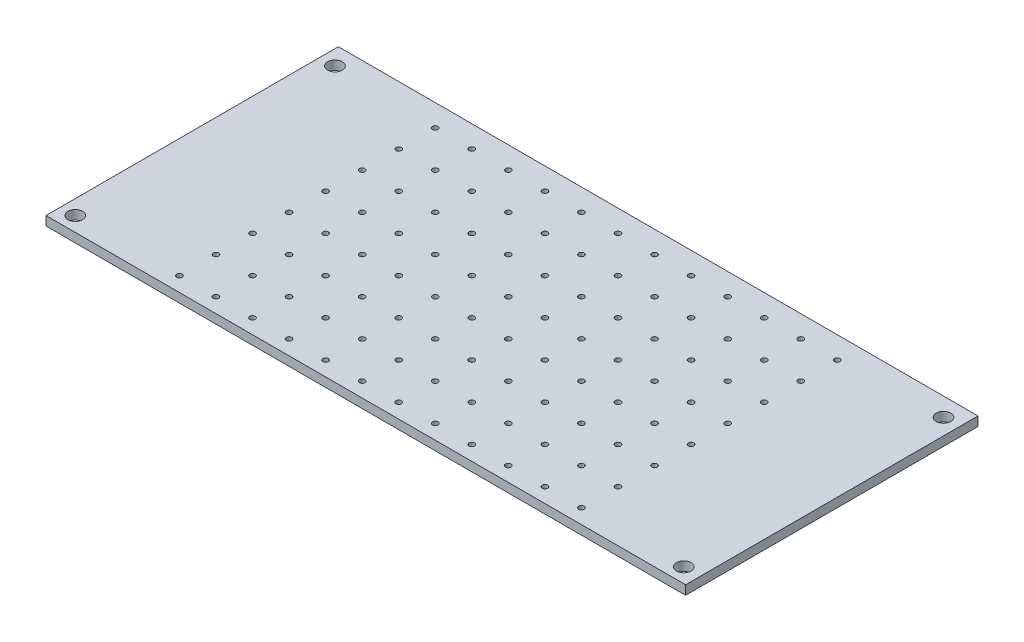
ISO-10303-21;
HEADER;
FILE_DESCRIPTION(('STEP AP214'),'2;1');
FILE_NAME('part.step','',(''),(''),'','','');
FILE_SCHEMA(('AUTOMOTIVE_DESIGN { 1 0 10303 214 1 1 1 1 }'));
ENDSEC;
DATA;
#1=APPLICATION_CONTEXT('core data for automotive mechanical design processes');
#2=APPLICATION_PROTOCOL_DEFINITION('international standard','automotive_design',2000,#1);
#3=PRODUCT_CONTEXT('',#1,'mechanical');
#4=PRODUCT('Part','Part','',(#3));
#5=PRODUCT_RELATED_PRODUCT_CATEGORY('part','',(#4));
#6=PRODUCT_DEFINITION_FORMATION('','',#4);
#7=PRODUCT_DEFINITION_CONTEXT('part definition',#1,'design');
#8=PRODUCT_DEFINITION('design','',#6,#7);
#9=PRODUCT_DEFINITION_SHAPE('','',#8);
#10=(LENGTH_UNIT() NAMED_UNIT(*) SI_UNIT(.MILLI.,.METRE.));
#11=(NAMED_UNIT(*) PLANE_ANGLE_UNIT() SI_UNIT($,.RADIAN.));
#12=(NAMED_UNIT(*) SI_UNIT($,.STERADIAN.) SOLID_ANGLE_UNIT());
#13=UNCERTAINTY_MEASURE_WITH_UNIT(LENGTH_MEASURE(1.E-05),#10,'distance_accuracy_value','');
#14=(GEOMETRIC_REPRESENTATION_CONTEXT(3) GLOBAL_UNCERTAINTY_ASSIGNED_CONTEXT((#13)) GLOBAL_UNIT_ASSIGNED_CONTEXT((#10,
#11,#12)) REPRESENTATION_CONTEXT('',''));
#15=CARTESIAN_POINT('',(0.,0.,0.));
#16=DIRECTION('',(0.,0.,1.));
#17=DIRECTION('',(1.,0.,0.));
#18=AXIS2_PLACEMENT_3D('',#15,#16,#17);
#19=CARTESIAN_POINT('',(-70.,0.,72.));
#20=DIRECTION('',(0.,1.,0.));
#21=DIRECTION('',(0.,0.,1.));
#22=AXIS2_PLACEMENT_3D('',#19,#20,#21);
#23=CYLINDRICAL_SURFACE('',#22,1.5);
#24=CARTESIAN_POINT('',(-70.,0.,72.));
#25=DIRECTION('',(0.,1.,0.));
#26=DIRECTION('',(0.,0.,1.));
#27=AXIS2_PLACEMENT_3D('',#24,#25,#26);
#28=CIRCLE('',#27,1.5);
#29=CARTESIAN_POINT('',(-70.,0.,73.5));
#30=VERTEX_POINT('',#29);
#31=EDGE_CURVE('E56',#30,#30,#28,.T.);
#32=ORIENTED_EDGE('',*,*,#31,.F.);
#33=EDGE_LOOP('',(#32));
#34=FACE_BOUND('',#33,.T.);
#35=CARTESIAN_POINT('',(-70.,5.,72.));
#36=DIRECTION('',(0.,1.,0.));
#37=DIRECTION('',(0.,0.,1.));
#38=AXIS2_PLACEMENT_3D('',#35,#36,#37);
#39=CIRCLE('',#38,1.5);
#40=CARTESIAN_POINT('',(-70.,5.,73.5));
#41=VERTEX_POINT('',#40);
#42=EDGE_CURVE('E11',#41,#41,#39,.T.);
#43=ORIENTED_EDGE('',*,*,#42,.T.);
#44=EDGE_LOOP('',(#43));
#45=FACE_BOUND('',#44,.T.);
#46=ADVANCED_FACE('F47',(#34,#45),#23,.F.);
#47=CARTESIAN_POINT('',(-70.,0.,52.));
#48=DIRECTION('',(0.,1.,0.));
#49=DIRECTION('',(0.,0.,1.));
#50=AXIS2_PLACEMENT_3D('',#47,#48,#49);
#51=CYLINDRICAL_SURFACE('',#50,1.5);
#52=CARTESIAN_POINT('',(-70.,0.,52.));
#53=DIRECTION('',(0.,1.,0.));
#54=DIRECTION('',(0.,0.,1.));
#55=AXIS2_PLACEMENT_3D('',#52,#53,#54);
#56=CIRCLE('',#55,1.5);
#57=CARTESIAN_POINT('',(-70.,0.,53.5));
#58=VERTEX_POINT('',#57);
#59=EDGE_CURVE('E777',#58,#58,#56,.T.);
#60=ORIENTED_EDGE('',*,*,#59,.F.);
#61=EDGE_LOOP('',(#60));
#62=FACE_BOUND('',#61,.T.);
#63=CARTESIAN_POINT('',(-70.,5.,52.));
#64=DIRECTION('',(0.,1.,0.));
#65=DIRECTION('',(0.,0.,1.));
#66=AXIS2_PLACEMENT_3D('',#63,#64,#65);
#67=CIRCLE('',#66,1.5);
#68=CARTESIAN_POINT('',(-70.,5.,53.5));
#69=VERTEX_POINT('',#68);
#70=EDGE_CURVE('E781',#69,#69,#67,.T.);
#71=ORIENTED_EDGE('',*,*,#70,.T.);
#72=EDGE_LOOP('',(#71));
#73=FACE_BOUND('',#72,.T.);
#74=ADVANCED_FACE('F792',(#62,#73),#51,.F.);
#75=CARTESIAN_POINT('',(-70.,0.,32.));
#76=DIRECTION('',(0.,1.,0.));
#77=DIRECTION('',(0.,0.,1.));
#78=AXIS2_PLACEMENT_3D('',#75,#76,#77);
#79=CYLINDRICAL_SURFACE('',#78,1.5);
#80=CARTESIAN_POINT('',(-70.,0.,32.));
#81=DIRECTION('',(0.,1.,0.));
#82=DIRECTION('',(0.,0.,1.));
#83=AXIS2_PLACEMENT_3D('',#80,#81,#82);
#84=CIRCLE('',#83,1.5);
#85=CARTESIAN_POINT('',(-70.,0.,33.5));
#86=VERTEX_POINT('',#85);
#87=EDGE_CURVE('E769',#86,#86,#84,.T.);
#88=ORIENTED_EDGE('',*,*,#87,.F.);
#89=EDGE_LOOP('',(#88));
#90=FACE_BOUND('',#89,.T.);
#91=CARTESIAN_POINT('',(-70.,5.,32.));
#92=DIRECTION('',(0.,1.,0.));
#93=DIRECTION('',(0.,0.,1.));
#94=AXIS2_PLACEMENT_3D('',#91,#92,#93);
#95=CIRCLE('',#94,1.5);
#96=CARTESIAN_POINT('',(-70.,5.,33.5));
#97=VERTEX_POINT('',#96);
#98=EDGE_CURVE('E773',#97,#97,#95,.T.);
#99=ORIENTED_EDGE('',*,*,#98,.T.);
#100=EDGE_LOOP('',(#99));
#101=FACE_BOUND('',#100,.T.);
#102=ADVANCED_FACE('F1136',(#90,#101),#79,.F.);
#103=CARTESIAN_POINT('',(-70.,0.,12.));
#104=DIRECTION('',(0.,1.,0.));
#105=DIRECTION('',(0.,0.,1.));
#106=AXIS2_PLACEMENT_3D('',#103,#104,#105);
#107=CYLINDRICAL_SURFACE('',#106,1.5);
#108=CARTESIAN_POINT('',(-70.,0.,12.));
#109=DIRECTION('',(0.,1.,0.));
#110=DIRECTION('',(0.,0.,1.));
#111=AXIS2_PLACEMENT_3D('',#108,#109,#110);
#112=CIRCLE('',#111,1.5);
#113=CARTESIAN_POINT('',(-70.,0.,13.5));
#114=VERTEX_POINT('',#113);
#115=EDGE_CURVE('E761',#114,#114,#112,.T.);
#116=ORIENTED_EDGE('',*,*,#115,.F.);
#117=EDGE_LOOP('',(#116));
#118=FACE_BOUND('',#117,.T.);
#119=CARTESIAN_POINT('',(-70.,5.,12.));
#120=DIRECTION('',(0.,1.,0.));
#121=DIRECTION('',(0.,0.,1.));
#122=AXIS2_PLACEMENT_3D('',#119,#120,#121);
#123=CIRCLE('',#122,1.5);
#124=CARTESIAN_POINT('',(-70.,5.,13.5));
#125=VERTEX_POINT('',#124);
#126=EDGE_CURVE('E765',#125,#125,#123,.T.);
#127=ORIENTED_EDGE('',*,*,#126,.T.);
#128=EDGE_LOOP('',(#127));
#129=FACE_BOUND('',#128,.T.);
#130=ADVANCED_FACE('F1132',(#118,#129),#107,.F.);
#131=CARTESIAN_POINT('',(-70.,0.,-7.99999999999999));
#132=DIRECTION('',(0.,1.,0.));
#133=DIRECTION('',(0.,0.,1.));
#134=AXIS2_PLACEMENT_3D('',#131,#132,#133);
#135=CYLINDRICAL_SURFACE('',#134,1.5);
#136=CARTESIAN_POINT('',(-70.,0.,-7.99999999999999));
#137=DIRECTION('',(0.,1.,0.));
#138=DIRECTION('',(0.,0.,1.));
#139=AXIS2_PLACEMENT_3D('',#136,#137,#138);
#140=CIRCLE('',#139,1.5);
#141=CARTESIAN_POINT('',(-70.,0.,-6.5));
#142=VERTEX_POINT('',#141);
#143=EDGE_CURVE('E753',#142,#142,#140,.T.);
#144=ORIENTED_EDGE('',*,*,#143,.F.);
#145=EDGE_LOOP('',(#144));
#146=FACE_BOUND('',#145,.T.);
#147=CARTESIAN_POINT('',(-70.,5.,-7.99999999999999));
#148=DIRECTION('',(0.,1.,0.));
#149=DIRECTION('',(0.,0.,1.));
#150=AXIS2_PLACEMENT_3D('',#147,#148,#149);
#151=CIRCLE('',#150,1.5);
#152=CARTESIAN_POINT('',(-70.,5.,-6.5));
#153=VERTEX_POINT('',#152);
#154=EDGE_CURVE('E757',#153,#153,#151,.T.);
#155=ORIENTED_EDGE('',*,*,#154,.T.);
#156=EDGE_LOOP('',(#155));
#157=FACE_BOUND('',#156,.T.);
#158=ADVANCED_FACE('F1128',(#146,#157),#135,.F.);
#159=CARTESIAN_POINT('',(-70.,0.,-28.));
#160=DIRECTION('',(0.,1.,0.));
#161=DIRECTION('',(0.,0.,1.));
#162=AXIS2_PLACEMENT_3D('',#159,#160,#161);
#163=CYLINDRICAL_SURFACE('',#162,1.5);
#164=CARTESIAN_POINT('',(-70.,0.,-28.));
#165=DIRECTION('',(0.,1.,0.));
#166=DIRECTION('',(0.,0.,1.));
#167=AXIS2_PLACEMENT_3D('',#164,#165,#166);
#168=CIRCLE('',#167,1.5);
#169=CARTESIAN_POINT('',(-70.,0.,-26.5));
#170=VERTEX_POINT('',#169);
#171=EDGE_CURVE('E745',#170,#170,#168,.T.);
#172=ORIENTED_EDGE('',*,*,#171,.F.);
#173=EDGE_LOOP('',(#172));
#174=FACE_BOUND('',#173,.T.);
#175=CARTESIAN_POINT('',(-70.,5.,-28.));
#176=DIRECTION('',(0.,1.,0.));
#177=DIRECTION('',(0.,0.,1.));
#178=AXIS2_PLACEMENT_3D('',#175,#176,#177);
#179=CIRCLE('',#178,1.5);
#180=CARTESIAN_POINT('',(-70.,5.,-26.5));
#181=VERTEX_POINT('',#180);
#182=EDGE_CURVE('E749',#181,#181,#179,.T.);
#183=ORIENTED_EDGE('',*,*,#182,.T.);
#184=EDGE_LOOP('',(#183));
#185=FACE_BOUND('',#184,.T.);
#186=ADVANCED_FACE('F1124',(#174,#185),#163,.F.);
#187=CARTESIAN_POINT('',(-50.,0.,72.));
#188=DIRECTION('',(0.,1.,0.));
#189=DIRECTION('',(0.,0.,1.));
#190=AXIS2_PLACEMENT_3D('',#187,#188,#189);
#191=CYLINDRICAL_SURFACE('',#190,1.5);
#192=CARTESIAN_POINT('',(-50.,0.,72.));
#193=DIRECTION('',(0.,1.,0.));
#194=DIRECTION('',(0.,0.,1.));
#195=AXIS2_PLACEMENT_3D('',#192,#193,#194);
#196=CIRCLE('',#195,1.5);
#197=CARTESIAN_POINT('',(-50.,0.,73.5));
#198=VERTEX_POINT('',#197);
#199=EDGE_CURVE('E737',#198,#198,#196,.T.);
#200=ORIENTED_EDGE('',*,*,#199,.F.);
#201=EDGE_LOOP('',(#200));
#202=FACE_BOUND('',#201,.T.);
#203=CARTESIAN_POINT('',(-50.,5.,72.));
#204=DIRECTION('',(0.,1.,0.));
#205=DIRECTION('',(0.,0.,1.));
#206=AXIS2_PLACEMENT_3D('',#203,#204,#205);
#207=CIRCLE('',#206,1.5);
#208=CARTESIAN_POINT('',(-50.,5.,73.5));
#209=VERTEX_POINT('',#208);
#210=EDGE_CURVE('E741',#209,#209,#207,.T.);
#211=ORIENTED_EDGE('',*,*,#210,.T.);
#212=EDGE_LOOP('',(#211));
#213=FACE_BOUND('',#212,.T.);
#214=ADVANCED_FACE('F1120',(#202,#213),#191,.F.);
#215=CARTESIAN_POINT('',(-50.,0.,52.));
#216=DIRECTION('',(0.,1.,0.));
#217=DIRECTION('',(0.,0.,1.));
#218=AXIS2_PLACEMENT_3D('',#215,#216,#217);
#219=CYLINDRICAL_SURFACE('',#218,1.5);
#220=CARTESIAN_POINT('',(-50.,0.,52.));
#221=DIRECTION('',(0.,1.,0.));
#222=DIRECTION('',(0.,0.,1.));
#223=AXIS2_PLACEMENT_3D('',#220,#221,#222);
#224=CIRCLE('',#223,1.5);
#225=CARTESIAN_POINT('',(-50.,0.,53.5));
#226=VERTEX_POINT('',#225);
#227=EDGE_CURVE('E729',#226,#226,#224,.T.);
#228=ORIENTED_EDGE('',*,*,#227,.F.);
#229=EDGE_LOOP('',(#228));
#230=FACE_BOUND('',#229,.T.);
#231=CARTESIAN_POINT('',(-50.,5.,52.));
#232=DIRECTION('',(0.,1.,0.));
#233=DIRECTION('',(0.,0.,1.));
#234=AXIS2_PLACEMENT_3D('',#231,#232,#233);
#235=CIRCLE('',#234,1.5);
#236=CARTESIAN_POINT('',(-50.,5.,53.5));
#237=VERTEX_POINT('',#236);
#238=EDGE_CURVE('E733',#237,#237,#235,.T.);
#239=ORIENTED_EDGE('',*,*,#238,.T.);
#240=EDGE_LOOP('',(#239));
#241=FACE_BOUND('',#240,.T.);
#242=ADVANCED_FACE('F1116',(#230,#241),#219,.F.);
#243=CARTESIAN_POINT('',(-50.,0.,32.));
#244=DIRECTION('',(0.,1.,0.));
#245=DIRECTION('',(0.,0.,1.));
#246=AXIS2_PLACEMENT_3D('',#243,#244,#245);
#247=CYLINDRICAL_SURFACE('',#246,1.5);
#248=CARTESIAN_POINT('',(-50.,0.,32.));
#249=DIRECTION('',(0.,1.,0.));
#250=DIRECTION('',(0.,0.,1.));
#251=AXIS2_PLACEMENT_3D('',#248,#249,#250);
#252=CIRCLE('',#251,1.5);
#253=CARTESIAN_POINT('',(-50.,0.,33.5));
#254=VERTEX_POINT('',#253);
#255=EDGE_CURVE('E721',#254,#254,#252,.T.);
#256=ORIENTED_EDGE('',*,*,#255,.F.);
#257=EDGE_LOOP('',(#256));
#258=FACE_BOUND('',#257,.T.);
#259=CARTESIAN_POINT('',(-50.,5.,32.));
#260=DIRECTION('',(0.,1.,0.));
#261=DIRECTION('',(0.,0.,1.));
#262=AXIS2_PLACEMENT_3D('',#259,#260,#261);
#263=CIRCLE('',#262,1.5);
#264=CARTESIAN_POINT('',(-50.,5.,33.5));
#265=VERTEX_POINT('',#264);
#266=EDGE_CURVE('E725',#265,#265,#263,.T.);
#267=ORIENTED_EDGE('',*,*,#266,.T.);
#268=EDGE_LOOP('',(#267));
#269=FACE_BOUND('',#268,.T.);
#270=ADVANCED_FACE('F1112',(#258,#269),#247,.F.);
#271=CARTESIAN_POINT('',(-50.,0.,12.));
#272=DIRECTION('',(0.,1.,0.));
#273=DIRECTION('',(0.,0.,1.));
#274=AXIS2_PLACEMENT_3D('',#271,#272,#273);
#275=CYLINDRICAL_SURFACE('',#274,1.5);
#276=CARTESIAN_POINT('',(-50.,0.,12.));
#277=DIRECTION('',(0.,1.,0.));
#278=DIRECTION('',(0.,0.,1.));
#279=AXIS2_PLACEMENT_3D('',#276,#277,#278);
#280=CIRCLE('',#279,1.5);
#281=CARTESIAN_POINT('',(-50.,0.,13.5));
#282=VERTEX_POINT('',#281);
#283=EDGE_CURVE('E713',#282,#282,#280,.T.);
#284=ORIENTED_EDGE('',*,*,#283,.F.);
#285=EDGE_LOOP('',(#284));
#286=FACE_BOUND('',#285,.T.);
#287=CARTESIAN_POINT('',(-50.,5.,12.));
#288=DIRECTION('',(0.,1.,0.));
#289=DIRECTION('',(0.,0.,1.));
#290=AXIS2_PLACEMENT_3D('',#287,#288,#289);
#291=CIRCLE('',#290,1.5);
#292=CARTESIAN_POINT('',(-50.,5.,13.5));
#293=VERTEX_POINT('',#292);
#294=EDGE_CURVE('E717',#293,#293,#291,.T.);
#295=ORIENTED_EDGE('',*,*,#294,.T.);
#296=EDGE_LOOP('',(#295));
#297=FACE_BOUND('',#296,.T.);
#298=ADVANCED_FACE('F1108',(#286,#297),#275,.F.);
#299=CARTESIAN_POINT('',(-50.,0.,-7.99999999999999));
#300=DIRECTION('',(0.,1.,0.));
#301=DIRECTION('',(0.,0.,1.));
#302=AXIS2_PLACEMENT_3D('',#299,#300,#301);
#303=CYLINDRICAL_SURFACE('',#302,1.5);
#304=CARTESIAN_POINT('',(-50.,0.,-7.99999999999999));
#305=DIRECTION('',(0.,1.,0.));
#306=DIRECTION('',(0.,0.,1.));
#307=AXIS2_PLACEMENT_3D('',#304,#305,#306);
#308=CIRCLE('',#307,1.5);
#309=CARTESIAN_POINT('',(-50.,0.,-6.5));
#310=VERTEX_POINT('',#309);
#311=EDGE_CURVE('E705',#310,#310,#308,.T.);
#312=ORIENTED_EDGE('',*,*,#311,.F.);
#313=EDGE_LOOP('',(#312));
#314=FACE_BOUND('',#313,.T.);
#315=CARTESIAN_POINT('',(-50.,5.,-7.99999999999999));
#316=DIRECTION('',(0.,1.,0.));
#317=DIRECTION('',(0.,0.,1.));
#318=AXIS2_PLACEMENT_3D('',#315,#316,#317);
#319=CIRCLE('',#318,1.5);
#320=CARTESIAN_POINT('',(-50.,5.,-6.5));
#321=VERTEX_POINT('',#320);
#322=EDGE_CURVE('E709',#321,#321,#319,.T.);
#323=ORIENTED_EDGE('',*,*,#322,.T.);
#324=EDGE_LOOP('',(#323));
#325=FACE_BOUND('',#324,.T.);
#326=ADVANCED_FACE('F1104',(#314,#325),#303,.F.);
#327=CARTESIAN_POINT('',(-50.,0.,-28.));
#328=DIRECTION('',(0.,1.,0.));
#329=DIRECTION('',(0.,0.,1.));
#330=AXIS2_PLACEMENT_3D('',#327,#328,#329);
#331=CYLINDRICAL_SURFACE('',#330,1.5);
#332=CARTESIAN_POINT('',(-50.,0.,-28.));
#333=DIRECTION('',(0.,1.,0.));
#334=DIRECTION('',(0.,0.,1.));
#335=AXIS2_PLACEMENT_3D('',#332,#333,#334);
#336=CIRCLE('',#335,1.5);
#337=CARTESIAN_POINT('',(-50.,0.,-26.5));
#338=VERTEX_POINT('',#337);
#339=EDGE_CURVE('E697',#338,#338,#336,.T.);
#340=ORIENTED_EDGE('',*,*,#339,.F.);
#341=EDGE_LOOP('',(#340));
#342=FACE_BOUND('',#341,.T.);
#343=CARTESIAN_POINT('',(-50.,5.,-28.));
#344=DIRECTION('',(0.,1.,0.));
#345=DIRECTION('',(0.,0.,1.));
#346=AXIS2_PLACEMENT_3D('',#343,#344,#345);
#347=CIRCLE('',#346,1.5);
#348=CARTESIAN_POINT('',(-50.,5.,-26.5));
#349=VERTEX_POINT('',#348);
#350=EDGE_CURVE('E701',#349,#349,#347,.T.);
#351=ORIENTED_EDGE('',*,*,#350,.T.);
#352=EDGE_LOOP('',(#351));
#353=FACE_BOUND('',#352,.T.);
#354=ADVANCED_FACE('F1100',(#342,#353),#331,.F.);
#355=CARTESIAN_POINT('',(-30.,0.,72.));
#356=DIRECTION('',(0.,1.,0.));
#357=DIRECTION('',(0.,0.,1.));
#358=AXIS2_PLACEMENT_3D('',#355,#356,#357);
#359=CYLINDRICAL_SURFACE('',#358,1.5);
#360=CARTESIAN_POINT('',(-30.,0.,72.));
#361=DIRECTION('',(0.,1.,0.));
#362=DIRECTION('',(0.,0.,1.));
#363=AXIS2_PLACEMENT_3D('',#360,#361,#362);
#364=CIRCLE('',#363,1.5);
#365=CARTESIAN_POINT('',(-30.,0.,73.5));
#366=VERTEX_POINT('',#365);
#367=EDGE_CURVE('E689',#366,#366,#364,.T.);
#368=ORIENTED_EDGE('',*,*,#367,.F.);
#369=EDGE_LOOP('',(#368));
#370=FACE_BOUND('',#369,.T.);
#371=CARTESIAN_POINT('',(-30.,5.,72.));
#372=DIRECTION('',(0.,1.,0.));
#373=DIRECTION('',(0.,0.,1.));
#374=AXIS2_PLACEMENT_3D('',#371,#372,#373);
#375=CIRCLE('',#374,1.5);
#376=CARTESIAN_POINT('',(-30.,5.,73.5));
#377=VERTEX_POINT('',#376);
#378=EDGE_CURVE('E693',#377,#377,#375,.T.);
#379=ORIENTED_EDGE('',*,*,#378,.T.);
#380=EDGE_LOOP('',(#379));
#381=FACE_BOUND('',#380,.T.);
#382=ADVANCED_FACE('F1096',(#370,#381),#359,.F.);
#383=CARTESIAN_POINT('',(-30.,0.,52.));
#384=DIRECTION('',(0.,1.,0.));
#385=DIRECTION('',(0.,0.,1.));
#386=AXIS2_PLACEMENT_3D('',#383,#384,#385);
#387=CYLINDRICAL_SURFACE('',#386,1.5);
#388=CARTESIAN_POINT('',(-30.,0.,52.));
#389=DIRECTION('',(0.,1.,0.));
#390=DIRECTION('',(0.,0.,1.));
#391=AXIS2_PLACEMENT_3D('',#388,#389,#390);
#392=CIRCLE('',#391,1.5);
#393=CARTESIAN_POINT('',(-30.,0.,53.5));
#394=VERTEX_POINT('',#393);
#395=EDGE_CURVE('E681',#394,#394,#392,.T.);
#396=ORIENTED_EDGE('',*,*,#395,.F.);
#397=EDGE_LOOP('',(#396));
#398=FACE_BOUND('',#397,.T.);
#399=CARTESIAN_POINT('',(-30.,5.,52.));
#400=DIRECTION('',(0.,1.,0.));
#401=DIRECTION('',(0.,0.,1.));
#402=AXIS2_PLACEMENT_3D('',#399,#400,#401);
#403=CIRCLE('',#402,1.5);
#404=CARTESIAN_POINT('',(-30.,5.,53.5));
#405=VERTEX_POINT('',#404);
#406=EDGE_CURVE('E685',#405,#405,#403,.T.);
#407=ORIENTED_EDGE('',*,*,#406,.T.);
#408=EDGE_LOOP('',(#407));
#409=FACE_BOUND('',#408,.T.);
#410=ADVANCED_FACE('F1092',(#398,#409),#387,.F.);
#411=CARTESIAN_POINT('',(-30.,0.,32.));
#412=DIRECTION('',(0.,1.,0.));
#413=DIRECTION('',(0.,0.,1.));
#414=AXIS2_PLACEMENT_3D('',#411,#412,#413);
#415=CYLINDRICAL_SURFACE('',#414,1.5);
#416=CARTESIAN_POINT('',(-30.,0.,32.));
#417=DIRECTION('',(0.,1.,0.));
#418=DIRECTION('',(0.,0.,1.));
#419=AXIS2_PLACEMENT_3D('',#416,#417,#418);
#420=CIRCLE('',#419,1.5);
#421=CARTESIAN_POINT('',(-30.,0.,33.5));
#422=VERTEX_POINT('',#421);
#423=EDGE_CURVE('E673',#422,#422,#420,.T.);
#424=ORIENTED_EDGE('',*,*,#423,.F.);
#425=EDGE_LOOP('',(#424));
#426=FACE_BOUND('',#425,.T.);
#427=CARTESIAN_POINT('',(-30.,5.,32.));
#428=DIRECTION('',(0.,1.,0.));
#429=DIRECTION('',(0.,0.,1.));
#430=AXIS2_PLACEMENT_3D('',#427,#428,#429);
#431=CIRCLE('',#430,1.5);
#432=CARTESIAN_POINT('',(-30.,5.,33.5));
#433=VERTEX_POINT('',#432);
#434=EDGE_CURVE('E677',#433,#433,#431,.T.);
#435=ORIENTED_EDGE('',*,*,#434,.T.);
#436=EDGE_LOOP('',(#435));
#437=FACE_BOUND('',#436,.T.);
#438=ADVANCED_FACE('F1088',(#426,#437),#415,.F.);
#439=CARTESIAN_POINT('',(-30.,0.,12.));
#440=DIRECTION('',(0.,1.,0.));
#441=DIRECTION('',(0.,0.,1.));
#442=AXIS2_PLACEMENT_3D('',#439,#440,#441);
#443=CYLINDRICAL_SURFACE('',#442,1.5);
#444=CARTESIAN_POINT('',(-30.,0.,12.));
#445=DIRECTION('',(0.,1.,0.));
#446=DIRECTION('',(0.,0.,1.));
#447=AXIS2_PLACEMENT_3D('',#444,#445,#446);
#448=CIRCLE('',#447,1.5);
#449=CARTESIAN_POINT('',(-30.,0.,13.5));
#450=VERTEX_POINT('',#449);
#451=EDGE_CURVE('E665',#450,#450,#448,.T.);
#452=ORIENTED_EDGE('',*,*,#451,.F.);
#453=EDGE_LOOP('',(#452));
#454=FACE_BOUND('',#453,.T.);
#455=CARTESIAN_POINT('',(-30.,5.,12.));
#456=DIRECTION('',(0.,1.,0.));
#457=DIRECTION('',(0.,0.,1.));
#458=AXIS2_PLACEMENT_3D('',#455,#456,#457);
#459=CIRCLE('',#458,1.5);
#460=CARTESIAN_POINT('',(-30.,5.,13.5));
#461=VERTEX_POINT('',#460);
#462=EDGE_CURVE('E669',#461,#461,#459,.T.);
#463=ORIENTED_EDGE('',*,*,#462,.T.);
#464=EDGE_LOOP('',(#463));
#465=FACE_BOUND('',#464,.T.);
#466=ADVANCED_FACE('F1084',(#454,#465),#443,.F.);
#467=CARTESIAN_POINT('',(-30.,0.,-7.99999999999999));
#468=DIRECTION('',(0.,1.,0.));
#469=DIRECTION('',(0.,0.,1.));
#470=AXIS2_PLACEMENT_3D('',#467,#468,#469);
#471=CYLINDRICAL_SURFACE('',#470,1.5);
#472=CARTESIAN_POINT('',(-30.,0.,-7.99999999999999));
#473=DIRECTION('',(0.,1.,0.));
#474=DIRECTION('',(0.,0.,1.));
#475=AXIS2_PLACEMENT_3D('',#472,#473,#474);
#476=CIRCLE('',#475,1.5);
#477=CARTESIAN_POINT('',(-30.,0.,-6.5));
#478=VERTEX_POINT('',#477);
#479=EDGE_CURVE('E657',#478,#478,#476,.T.);
#480=ORIENTED_EDGE('',*,*,#479,.F.);
#481=EDGE_LOOP('',(#480));
#482=FACE_BOUND('',#481,.T.);
#483=CARTESIAN_POINT('',(-30.,5.,-7.99999999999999));
#484=DIRECTION('',(0.,1.,0.));
#485=DIRECTION('',(0.,0.,1.));
#486=AXIS2_PLACEMENT_3D('',#483,#484,#485);
#487=CIRCLE('',#486,1.5);
#488=CARTESIAN_POINT('',(-30.,5.,-6.5));
#489=VERTEX_POINT('',#488);
#490=EDGE_CURVE('E661',#489,#489,#487,.T.);
#491=ORIENTED_EDGE('',*,*,#490,.T.);
#492=EDGE_LOOP('',(#491));
#493=FACE_BOUND('',#492,.T.);
#494=ADVANCED_FACE('F1080',(#482,#493),#471,.F.);
#495=CARTESIAN_POINT('',(-30.,0.,-28.));
#496=DIRECTION('',(0.,1.,0.));
#497=DIRECTION('',(0.,0.,1.));
#498=AXIS2_PLACEMENT_3D('',#495,#496,#497);
#499=CYLINDRICAL_SURFACE('',#498,1.5);
#500=CARTESIAN_POINT('',(-30.,0.,-28.));
#501=DIRECTION('',(0.,1.,0.));
#502=DIRECTION('',(0.,0.,1.));
#503=AXIS2_PLACEMENT_3D('',#500,#501,#502);
#504=CIRCLE('',#503,1.5);
#505=CARTESIAN_POINT('',(-30.,0.,-26.5));
#506=VERTEX_POINT('',#505);
#507=EDGE_CURVE('E649',#506,#506,#504,.T.);
#508=ORIENTED_EDGE('',*,*,#507,.F.);
#509=EDGE_LOOP('',(#508));
#510=FACE_BOUND('',#509,.T.);
#511=CARTESIAN_POINT('',(-30.,5.,-28.));
#512=DIRECTION('',(0.,1.,0.));
#513=DIRECTION('',(0.,0.,1.));
#514=AXIS2_PLACEMENT_3D('',#511,#512,#513);
#515=CIRCLE('',#514,1.5);
#516=CARTESIAN_POINT('',(-30.,5.,-26.5));
#517=VERTEX_POINT('',#516);
#518=EDGE_CURVE('E653',#517,#517,#515,.T.);
#519=ORIENTED_EDGE('',*,*,#518,.T.);
#520=EDGE_LOOP('',(#519));
#521=FACE_BOUND('',#520,.T.);
#522=ADVANCED_FACE('F1076',(#510,#521),#499,.F.);
#523=CARTESIAN_POINT('',(-9.99999999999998,0.,72.));
#524=DIRECTION('',(0.,1.,0.));
#525=DIRECTION('',(0.,0.,1.));
#526=AXIS2_PLACEMENT_3D('',#523,#524,#525);
#527=CYLINDRICAL_SURFACE('',#526,1.5);
#528=CARTESIAN_POINT('',(-9.99999999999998,0.,72.));
#529=DIRECTION('',(0.,1.,0.));
#530=DIRECTION('',(0.,0.,1.));
#531=AXIS2_PLACEMENT_3D('',#528,#529,#530);
#532=CIRCLE('',#531,1.5);
#533=CARTESIAN_POINT('',(-9.99999999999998,0.,73.5));
#534=VERTEX_POINT('',#533);
#535=EDGE_CURVE('E641',#534,#534,#532,.T.);
#536=ORIENTED_EDGE('',*,*,#535,.F.);
#537=EDGE_LOOP('',(#536));
#538=FACE_BOUND('',#537,.T.);
#539=CARTESIAN_POINT('',(-9.99999999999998,5.,72.));
#540=DIRECTION('',(0.,1.,0.));
#541=DIRECTION('',(0.,0.,1.));
#542=AXIS2_PLACEMENT_3D('',#539,#540,#541);
#543=CIRCLE('',#542,1.5);
#544=CARTESIAN_POINT('',(-9.99999999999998,5.,73.5));
#545=VERTEX_POINT('',#544);
#546=EDGE_CURVE('E645',#545,#545,#543,.T.);
#547=ORIENTED_EDGE('',*,*,#546,.T.);
#548=EDGE_LOOP('',(#547));
#549=FACE_BOUND('',#548,.T.);
#550=ADVANCED_FACE('F1072',(#538,#549),#527,.F.);
#551=CARTESIAN_POINT('',(-9.99999999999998,0.,52.));
#552=DIRECTION('',(0.,1.,0.));
#553=DIRECTION('',(0.,0.,1.));
#554=AXIS2_PLACEMENT_3D('',#551,#552,#553);
#555=CYLINDRICAL_SURFACE('',#554,1.5);
#556=CARTESIAN_POINT('',(-9.99999999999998,0.,52.));
#557=DIRECTION('',(0.,1.,0.));
#558=DIRECTION('',(0.,0.,1.));
#559=AXIS2_PLACEMENT_3D('',#556,#557,#558);
#560=CIRCLE('',#559,1.5);
#561=CARTESIAN_POINT('',(-9.99999999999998,0.,53.5));
#562=VERTEX_POINT('',#561);
#563=EDGE_CURVE('E633',#562,#562,#560,.T.);
#564=ORIENTED_EDGE('',*,*,#563,.F.);
#565=EDGE_LOOP('',(#564));
#566=FACE_BOUND('',#565,.T.);
#567=CARTESIAN_POINT('',(-9.99999999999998,5.,52.));
#568=DIRECTION('',(0.,1.,0.));
#569=DIRECTION('',(0.,0.,1.));
#570=AXIS2_PLACEMENT_3D('',#567,#568,#569);
#571=CIRCLE('',#570,1.5);
#572=CARTESIAN_POINT('',(-9.99999999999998,5.,53.5));
#573=VERTEX_POINT('',#572);
#574=EDGE_CURVE('E637',#573,#573,#571,.T.);
#575=ORIENTED_EDGE('',*,*,#574,.T.);
#576=EDGE_LOOP('',(#575));
#577=FACE_BOUND('',#576,.T.);
#578=ADVANCED_FACE('F1068',(#566,#577),#555,.F.);
#579=CARTESIAN_POINT('',(-9.99999999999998,0.,32.));
#580=DIRECTION('',(0.,1.,0.));
#581=DIRECTION('',(0.,0.,1.));
#582=AXIS2_PLACEMENT_3D('',#579,#580,#581);
#583=CYLINDRICAL_SURFACE('',#582,1.5);
#584=CARTESIAN_POINT('',(-9.99999999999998,0.,32.));
#585=DIRECTION('',(0.,1.,0.));
#586=DIRECTION('',(0.,0.,1.));
#587=AXIS2_PLACEMENT_3D('',#584,#585,#586);
#588=CIRCLE('',#587,1.5);
#589=CARTESIAN_POINT('',(-9.99999999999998,0.,33.5));
#590=VERTEX_POINT('',#589);
#591=EDGE_CURVE('E625',#590,#590,#588,.T.);
#592=ORIENTED_EDGE('',*,*,#591,.F.);
#593=EDGE_LOOP('',(#592));
#594=FACE_BOUND('',#593,.T.);
#595=CARTESIAN_POINT('',(-9.99999999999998,5.,32.));
#596=DIRECTION('',(0.,1.,0.));
#597=DIRECTION('',(0.,0.,1.));
#598=AXIS2_PLACEMENT_3D('',#595,#596,#597);
#599=CIRCLE('',#598,1.5);
#600=CARTESIAN_POINT('',(-9.99999999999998,5.,33.5));
#601=VERTEX_POINT('',#600);
#602=EDGE_CURVE('E629',#601,#601,#599,.T.);
#603=ORIENTED_EDGE('',*,*,#602,.T.);
#604=EDGE_LOOP('',(#603));
#605=FACE_BOUND('',#604,.T.);
#606=ADVANCED_FACE('F1064',(#594,#605),#583,.F.);
#607=CARTESIAN_POINT('',(-9.99999999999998,0.,12.));
#608=DIRECTION('',(0.,1.,0.));
#609=DIRECTION('',(0.,0.,1.));
#610=AXIS2_PLACEMENT_3D('',#607,#608,#609);
#611=CYLINDRICAL_SURFACE('',#610,1.5);
#612=CARTESIAN_POINT('',(-9.99999999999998,0.,12.));
#613=DIRECTION('',(0.,1.,0.));
#614=DIRECTION('',(0.,0.,1.));
#615=AXIS2_PLACEMENT_3D('',#612,#613,#614);
#616=CIRCLE('',#615,1.5);
#617=CARTESIAN_POINT('',(-9.99999999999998,0.,13.5));
#618=VERTEX_POINT('',#617);
#619=EDGE_CURVE('E617',#618,#618,#616,.T.);
#620=ORIENTED_EDGE('',*,*,#619,.F.);
#621=EDGE_LOOP('',(#620));
#622=FACE_BOUND('',#621,.T.);
#623=CARTESIAN_POINT('',(-9.99999999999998,5.,12.));
#624=DIRECTION('',(0.,1.,0.));
#625=DIRECTION('',(0.,0.,1.));
#626=AXIS2_PLACEMENT_3D('',#623,#624,#625);
#627=CIRCLE('',#626,1.5);
#628=CARTESIAN_POINT('',(-9.99999999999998,5.,13.5));
#629=VERTEX_POINT('',#628);
#630=EDGE_CURVE('E621',#629,#629,#627,.T.);
#631=ORIENTED_EDGE('',*,*,#630,.T.);
#632=EDGE_LOOP('',(#631));
#633=FACE_BOUND('',#632,.T.);
#634=ADVANCED_FACE('F1060',(#622,#633),#611,.F.);
#635=CARTESIAN_POINT('',(-9.99999999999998,0.,-7.99999999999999));
#636=DIRECTION('',(0.,1.,0.));
#637=DIRECTION('',(0.,0.,1.));
#638=AXIS2_PLACEMENT_3D('',#635,#636,#637);
#639=CYLINDRICAL_SURFACE('',#638,1.5);
#640=CARTESIAN_POINT('',(-9.99999999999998,0.,-7.99999999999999));
#641=DIRECTION('',(0.,1.,0.));
#642=DIRECTION('',(0.,0.,1.));
#643=AXIS2_PLACEMENT_3D('',#640,#641,#642);
#644=CIRCLE('',#643,1.5);
#645=CARTESIAN_POINT('',(-9.99999999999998,0.,-6.5));
#646=VERTEX_POINT('',#645);
#647=EDGE_CURVE('E609',#646,#646,#644,.T.);
#648=ORIENTED_EDGE('',*,*,#647,.F.);
#649=EDGE_LOOP('',(#648));
#650=FACE_BOUND('',#649,.T.);
#651=CARTESIAN_POINT('',(-9.99999999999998,5.,-7.99999999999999));
#652=DIRECTION('',(0.,1.,0.));
#653=DIRECTION('',(0.,0.,1.));
#654=AXIS2_PLACEMENT_3D('',#651,#652,#653);
#655=CIRCLE('',#654,1.5);
#656=CARTESIAN_POINT('',(-9.99999999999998,5.,-6.5));
#657=VERTEX_POINT('',#656);
#658=EDGE_CURVE('E613',#657,#657,#655,.T.);
#659=ORIENTED_EDGE('',*,*,#658,.T.);
#660=EDGE_LOOP('',(#659));
#661=FACE_BOUND('',#660,.T.);
#662=ADVANCED_FACE('F1056',(#650,#661),#639,.F.);
#663=CARTESIAN_POINT('',(-9.99999999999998,0.,-28.));
#664=DIRECTION('',(0.,1.,0.));
#665=DIRECTION('',(0.,0.,1.));
#666=AXIS2_PLACEMENT_3D('',#663,#664,#665);
#667=CYLINDRICAL_SURFACE('',#666,1.5);
#668=CARTESIAN_POINT('',(-9.99999999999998,0.,-28.));
#669=DIRECTION('',(0.,1.,0.));
#670=DIRECTION('',(0.,0.,1.));
#671=AXIS2_PLACEMENT_3D('',#668,#669,#670);
#672=CIRCLE('',#671,1.5);
#673=CARTESIAN_POINT('',(-9.99999999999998,0.,-26.5));
#674=VERTEX_POINT('',#673);
#675=EDGE_CURVE('E601',#674,#674,#672,.T.);
#676=ORIENTED_EDGE('',*,*,#675,.F.);
#677=EDGE_LOOP('',(#676));
#678=FACE_BOUND('',#677,.T.);
#679=CARTESIAN_POINT('',(-9.99999999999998,5.,-28.));
#680=DIRECTION('',(0.,1.,0.));
#681=DIRECTION('',(0.,0.,1.));
#682=AXIS2_PLACEMENT_3D('',#679,#680,#681);
#683=CIRCLE('',#682,1.5);
#684=CARTESIAN_POINT('',(-9.99999999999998,5.,-26.5));
#685=VERTEX_POINT('',#684);
#686=EDGE_CURVE('E605',#685,#685,#683,.T.);
#687=ORIENTED_EDGE('',*,*,#686,.T.);
#688=EDGE_LOOP('',(#687));
#689=FACE_BOUND('',#688,.T.);
#690=ADVANCED_FACE('F1052',(#678,#689),#667,.F.);
#691=CARTESIAN_POINT('',(10.,0.,72.));
#692=DIRECTION('',(0.,1.,0.));
#693=DIRECTION('',(0.,0.,1.));
#694=AXIS2_PLACEMENT_3D('',#691,#692,#693);
#695=CYLINDRICAL_SURFACE('',#694,1.5);
#696=CARTESIAN_POINT('',(10.,0.,72.));
#697=DIRECTION('',(0.,1.,0.));
#698=DIRECTION('',(0.,0.,1.));
#699=AXIS2_PLACEMENT_3D('',#696,#697,#698);
#700=CIRCLE('',#699,1.5);
#701=CARTESIAN_POINT('',(10.,0.,73.5));
#702=VERTEX_POINT('',#701);
#703=EDGE_CURVE('E593',#702,#702,#700,.T.);
#704=ORIENTED_EDGE('',*,*,#703,.F.);
#705=EDGE_LOOP('',(#704));
#706=FACE_BOUND('',#705,.T.);
#707=CARTESIAN_POINT('',(10.,5.,72.));
#708=DIRECTION('',(0.,1.,0.));
#709=DIRECTION('',(0.,0.,1.));
#710=AXIS2_PLACEMENT_3D('',#707,#708,#709);
#711=CIRCLE('',#710,1.5);
#712=CARTESIAN_POINT('',(10.,5.,73.5));
#713=VERTEX_POINT('',#712);
#714=EDGE_CURVE('E597',#713,#713,#711,.T.);
#715=ORIENTED_EDGE('',*,*,#714,.T.);
#716=EDGE_LOOP('',(#715));
#717=FACE_BOUND('',#716,.T.);
#718=ADVANCED_FACE('F1048',(#706,#717),#695,.F.);
#719=CARTESIAN_POINT('',(10.,0.,52.));
#720=DIRECTION('',(0.,1.,0.));
#721=DIRECTION('',(0.,0.,1.));
#722=AXIS2_PLACEMENT_3D('',#719,#720,#721);
#723=CYLINDRICAL_SURFACE('',#722,1.5);
#724=CARTESIAN_POINT('',(10.,0.,52.));
#725=DIRECTION('',(0.,1.,0.));
#726=DIRECTION('',(0.,0.,1.));
#727=AXIS2_PLACEMENT_3D('',#724,#725,#726);
#728=CIRCLE('',#727,1.5);
#729=CARTESIAN_POINT('',(10.,0.,53.5));
#730=VERTEX_POINT('',#729);
#731=EDGE_CURVE('E585',#730,#730,#728,.T.);
#732=ORIENTED_EDGE('',*,*,#731,.F.);
#733=EDGE_LOOP('',(#732));
#734=FACE_BOUND('',#733,.T.);
#735=CARTESIAN_POINT('',(10.,5.,52.));
#736=DIRECTION('',(0.,1.,0.));
#737=DIRECTION('',(0.,0.,1.));
#738=AXIS2_PLACEMENT_3D('',#735,#736,#737);
#739=CIRCLE('',#738,1.5);
#740=CARTESIAN_POINT('',(10.,5.,53.5));
#741=VERTEX_POINT('',#740);
#742=EDGE_CURVE('E589',#741,#741,#739,.T.);
#743=ORIENTED_EDGE('',*,*,#742,.T.);
#744=EDGE_LOOP('',(#743));
#745=FACE_BOUND('',#744,.T.);
#746=ADVANCED_FACE('F1044',(#734,#745),#723,.F.);
#747=CARTESIAN_POINT('',(10.,0.,32.));
#748=DIRECTION('',(0.,1.,0.));
#749=DIRECTION('',(0.,0.,1.));
#750=AXIS2_PLACEMENT_3D('',#747,#748,#749);
#751=CYLINDRICAL_SURFACE('',#750,1.5);
#752=CARTESIAN_POINT('',(10.,0.,32.));
#753=DIRECTION('',(0.,1.,0.));
#754=DIRECTION('',(0.,0.,1.));
#755=AXIS2_PLACEMENT_3D('',#752,#753,#754);
#756=CIRCLE('',#755,1.5);
#757=CARTESIAN_POINT('',(10.,0.,33.5));
#758=VERTEX_POINT('',#757);
#759=EDGE_CURVE('E577',#758,#758,#756,.T.);
#760=ORIENTED_EDGE('',*,*,#759,.F.);
#761=EDGE_LOOP('',(#760));
#762=FACE_BOUND('',#761,.T.);
#763=CARTESIAN_POINT('',(10.,5.,32.));
#764=DIRECTION('',(0.,1.,0.));
#765=DIRECTION('',(0.,0.,1.));
#766=AXIS2_PLACEMENT_3D('',#763,#764,#765);
#767=CIRCLE('',#766,1.5);
#768=CARTESIAN_POINT('',(10.,5.,33.5));
#769=VERTEX_POINT('',#768);
#770=EDGE_CURVE('E581',#769,#769,#767,.T.);
#771=ORIENTED_EDGE('',*,*,#770,.T.);
#772=EDGE_LOOP('',(#771));
#773=FACE_BOUND('',#772,.T.);
#774=ADVANCED_FACE('F1040',(#762,#773),#751,.F.);
#775=CARTESIAN_POINT('',(10.,0.,12.));
#776=DIRECTION('',(0.,1.,0.));
#777=DIRECTION('',(0.,0.,1.));
#778=AXIS2_PLACEMENT_3D('',#775,#776,#777);
#779=CYLINDRICAL_SURFACE('',#778,1.5);
#780=CARTESIAN_POINT('',(10.,0.,12.));
#781=DIRECTION('',(0.,1.,0.));
#782=DIRECTION('',(0.,0.,1.));
#783=AXIS2_PLACEMENT_3D('',#780,#781,#782);
#784=CIRCLE('',#783,1.5);
#785=CARTESIAN_POINT('',(10.,0.,13.5));
#786=VERTEX_POINT('',#785);
#787=EDGE_CURVE('E569',#786,#786,#784,.T.);
#788=ORIENTED_EDGE('',*,*,#787,.F.);
#789=EDGE_LOOP('',(#788));
#790=FACE_BOUND('',#789,.T.);
#791=CARTESIAN_POINT('',(10.,5.,12.));
#792=DIRECTION('',(0.,1.,0.));
#793=DIRECTION('',(0.,0.,1.));
#794=AXIS2_PLACEMENT_3D('',#791,#792,#793);
#795=CIRCLE('',#794,1.5);
#796=CARTESIAN_POINT('',(10.,5.,13.5));
#797=VERTEX_POINT('',#796);
#798=EDGE_CURVE('E573',#797,#797,#795,.T.);
#799=ORIENTED_EDGE('',*,*,#798,.T.);
#800=EDGE_LOOP('',(#799));
#801=FACE_BOUND('',#800,.T.);
#802=ADVANCED_FACE('F1036',(#790,#801),#779,.F.);
#803=CARTESIAN_POINT('',(10.,0.,-7.99999999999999));
#804=DIRECTION('',(0.,1.,0.));
#805=DIRECTION('',(0.,0.,1.));
#806=AXIS2_PLACEMENT_3D('',#803,#804,#805);
#807=CYLINDRICAL_SURFACE('',#806,1.5);
#808=CARTESIAN_POINT('',(10.,0.,-7.99999999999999));
#809=DIRECTION('',(0.,1.,0.));
#810=DIRECTION('',(0.,0.,1.));
#811=AXIS2_PLACEMENT_3D('',#808,#809,#810);
#812=CIRCLE('',#811,1.5);
#813=CARTESIAN_POINT('',(10.,0.,-6.5));
#814=VERTEX_POINT('',#813);
#815=EDGE_CURVE('E561',#814,#814,#812,.T.);
#816=ORIENTED_EDGE('',*,*,#815,.F.);
#817=EDGE_LOOP('',(#816));
#818=FACE_BOUND('',#817,.T.);
#819=CARTESIAN_POINT('',(10.,5.,-7.99999999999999));
#820=DIRECTION('',(0.,1.,0.));
#821=DIRECTION('',(0.,0.,1.));
#822=AXIS2_PLACEMENT_3D('',#819,#820,#821);
#823=CIRCLE('',#822,1.5);
#824=CARTESIAN_POINT('',(10.,5.,-6.5));
#825=VERTEX_POINT('',#824);
#826=EDGE_CURVE('E565',#825,#825,#823,.T.);
#827=ORIENTED_EDGE('',*,*,#826,.T.);
#828=EDGE_LOOP('',(#827));
#829=FACE_BOUND('',#828,.T.);
#830=ADVANCED_FACE('F1032',(#818,#829),#807,.F.);
#831=CARTESIAN_POINT('',(10.,0.,-28.));
#832=DIRECTION('',(0.,1.,0.));
#833=DIRECTION('',(0.,0.,1.));
#834=AXIS2_PLACEMENT_3D('',#831,#832,#833);
#835=CYLINDRICAL_SURFACE('',#834,1.5);
#836=CARTESIAN_POINT('',(10.,0.,-28.));
#837=DIRECTION('',(0.,1.,0.));
#838=DIRECTION('',(0.,0.,1.));
#839=AXIS2_PLACEMENT_3D('',#836,#837,#838);
#840=CIRCLE('',#839,1.5);
#841=CARTESIAN_POINT('',(10.,0.,-26.5));
#842=VERTEX_POINT('',#841);
#843=EDGE_CURVE('E553',#842,#842,#840,.T.);
#844=ORIENTED_EDGE('',*,*,#843,.F.);
#845=EDGE_LOOP('',(#844));
#846=FACE_BOUND('',#845,.T.);
#847=CARTESIAN_POINT('',(10.,5.,-28.));
#848=DIRECTION('',(0.,1.,0.));
#849=DIRECTION('',(0.,0.,1.));
#850=AXIS2_PLACEMENT_3D('',#847,#848,#849);
#851=CIRCLE('',#850,1.5);
#852=CARTESIAN_POINT('',(10.,5.,-26.5));
#853=VERTEX_POINT('',#852);
#854=EDGE_CURVE('E557',#853,#853,#851,.T.);
#855=ORIENTED_EDGE('',*,*,#854,.T.);
#856=EDGE_LOOP('',(#855));
#857=FACE_BOUND('',#856,.T.);
#858=ADVANCED_FACE('F1028',(#846,#857),#835,.F.);
#859=CARTESIAN_POINT('',(30.,0.,72.));
#860=DIRECTION('',(0.,1.,0.));
#861=DIRECTION('',(0.,0.,1.));
#862=AXIS2_PLACEMENT_3D('',#859,#860,#861);
#863=CYLINDRICAL_SURFACE('',#862,1.5);
#864=CARTESIAN_POINT('',(30.,0.,72.));
#865=DIRECTION('',(0.,1.,0.));
#866=DIRECTION('',(0.,0.,1.));
#867=AXIS2_PLACEMENT_3D('',#864,#865,#866);
#868=CIRCLE('',#867,1.5);
#869=CARTESIAN_POINT('',(30.,0.,73.5));
#870=VERTEX_POINT('',#869);
#871=EDGE_CURVE('E545',#870,#870,#868,.T.);
#872=ORIENTED_EDGE('',*,*,#871,.F.);
#873=EDGE_LOOP('',(#872));
#874=FACE_BOUND('',#873,.T.);
#875=CARTESIAN_POINT('',(30.,5.,72.));
#876=DIRECTION('',(0.,1.,0.));
#877=DIRECTION('',(0.,0.,1.));
#878=AXIS2_PLACEMENT_3D('',#875,#876,#877);
#879=CIRCLE('',#878,1.5);
#880=CARTESIAN_POINT('',(30.,5.,73.5));
#881=VERTEX_POINT('',#880);
#882=EDGE_CURVE('E549',#881,#881,#879,.T.);
#883=ORIENTED_EDGE('',*,*,#882,.T.);
#884=EDGE_LOOP('',(#883));
#885=FACE_BOUND('',#884,.T.);
#886=ADVANCED_FACE('F1024',(#874,#885),#863,.F.);
#887=CARTESIAN_POINT('',(30.,0.,52.));
#888=DIRECTION('',(0.,1.,0.));
#889=DIRECTION('',(0.,0.,1.));
#890=AXIS2_PLACEMENT_3D('',#887,#888,#889);
#891=CYLINDRICAL_SURFACE('',#890,1.5);
#892=CARTESIAN_POINT('',(30.,0.,52.));
#893=DIRECTION('',(0.,1.,0.));
#894=DIRECTION('',(0.,0.,1.));
#895=AXIS2_PLACEMENT_3D('',#892,#893,#894);
#896=CIRCLE('',#895,1.5);
#897=CARTESIAN_POINT('',(30.,0.,53.5));
#898=VERTEX_POINT('',#897);
#899=EDGE_CURVE('E537',#898,#898,#896,.T.);
#900=ORIENTED_EDGE('',*,*,#899,.F.);
#901=EDGE_LOOP('',(#900));
#902=FACE_BOUND('',#901,.T.);
#903=CARTESIAN_POINT('',(30.,5.,52.));
#904=DIRECTION('',(0.,1.,0.));
#905=DIRECTION('',(0.,0.,1.));
#906=AXIS2_PLACEMENT_3D('',#903,#904,#905);
#907=CIRCLE('',#906,1.5);
#908=CARTESIAN_POINT('',(30.,5.,53.5));
#909=VERTEX_POINT('',#908);
#910=EDGE_CURVE('E541',#909,#909,#907,.T.);
#911=ORIENTED_EDGE('',*,*,#910,.T.);
#912=EDGE_LOOP('',(#911));
#913=FACE_BOUND('',#912,.T.);
#914=ADVANCED_FACE('F1020',(#902,#913),#891,.F.);
#915=CARTESIAN_POINT('',(30.,0.,32.));
#916=DIRECTION('',(0.,1.,0.));
#917=DIRECTION('',(0.,0.,1.));
#918=AXIS2_PLACEMENT_3D('',#915,#916,#917);
#919=CYLINDRICAL_SURFACE('',#918,1.5);
#920=CARTESIAN_POINT('',(30.,0.,32.));
#921=DIRECTION('',(0.,1.,0.));
#922=DIRECTION('',(0.,0.,1.));
#923=AXIS2_PLACEMENT_3D('',#920,#921,#922);
#924=CIRCLE('',#923,1.5);
#925=CARTESIAN_POINT('',(30.,0.,33.5));
#926=VERTEX_POINT('',#925);
#927=EDGE_CURVE('E529',#926,#926,#924,.T.);
#928=ORIENTED_EDGE('',*,*,#927,.F.);
#929=EDGE_LOOP('',(#928));
#930=FACE_BOUND('',#929,.T.);
#931=CARTESIAN_POINT('',(30.,5.,32.));
#932=DIRECTION('',(0.,1.,0.));
#933=DIRECTION('',(0.,0.,1.));
#934=AXIS2_PLACEMENT_3D('',#931,#932,#933);
#935=CIRCLE('',#934,1.5);
#936=CARTESIAN_POINT('',(30.,5.,33.5));
#937=VERTEX_POINT('',#936);
#938=EDGE_CURVE('E533',#937,#937,#935,.T.);
#939=ORIENTED_EDGE('',*,*,#938,.T.);
#940=EDGE_LOOP('',(#939));
#941=FACE_BOUND('',#940,.T.);
#942=ADVANCED_FACE('F1016',(#930,#941),#919,.F.);
#943=CARTESIAN_POINT('',(30.,0.,12.));
#944=DIRECTION('',(0.,1.,0.));
#945=DIRECTION('',(0.,0.,1.));
#946=AXIS2_PLACEMENT_3D('',#943,#944,#945);
#947=CYLINDRICAL_SURFACE('',#946,1.5);
#948=CARTESIAN_POINT('',(30.,0.,12.));
#949=DIRECTION('',(0.,1.,0.));
#950=DIRECTION('',(0.,0.,1.));
#951=AXIS2_PLACEMENT_3D('',#948,#949,#950);
#952=CIRCLE('',#951,1.5);
#953=CARTESIAN_POINT('',(30.,0.,13.5));
#954=VERTEX_POINT('',#953);
#955=EDGE_CURVE('E521',#954,#954,#952,.T.);
#956=ORIENTED_EDGE('',*,*,#955,.F.);
#957=EDGE_LOOP('',(#956));
#958=FACE_BOUND('',#957,.T.);
#959=CARTESIAN_POINT('',(30.,5.,12.));
#960=DIRECTION('',(0.,1.,0.));
#961=DIRECTION('',(0.,0.,1.));
#962=AXIS2_PLACEMENT_3D('',#959,#960,#961);
#963=CIRCLE('',#962,1.5);
#964=CARTESIAN_POINT('',(30.,5.,13.5));
#965=VERTEX_POINT('',#964);
#966=EDGE_CURVE('E525',#965,#965,#963,.T.);
#967=ORIENTED_EDGE('',*,*,#966,.T.);
#968=EDGE_LOOP('',(#967));
#969=FACE_BOUND('',#968,.T.);
#970=ADVANCED_FACE('F1012',(#958,#969),#947,.F.);
#971=CARTESIAN_POINT('',(30.,0.,-7.99999999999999));
#972=DIRECTION('',(0.,1.,0.));
#973=DIRECTION('',(0.,0.,1.));
#974=AXIS2_PLACEMENT_3D('',#971,#972,#973);
#975=CYLINDRICAL_SURFACE('',#974,1.5);
#976=CARTESIAN_POINT('',(30.,0.,-7.99999999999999));
#977=DIRECTION('',(0.,1.,0.));
#978=DIRECTION('',(0.,0.,1.));
#979=AXIS2_PLACEMENT_3D('',#976,#977,#978);
#980=CIRCLE('',#979,1.5);
#981=CARTESIAN_POINT('',(30.,0.,-6.5));
#982=VERTEX_POINT('',#981);
#983=EDGE_CURVE('E513',#982,#982,#980,.T.);
#984=ORIENTED_EDGE('',*,*,#983,.F.);
#985=EDGE_LOOP('',(#984));
#986=FACE_BOUND('',#985,.T.);
#987=CARTESIAN_POINT('',(30.,5.,-7.99999999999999));
#988=DIRECTION('',(0.,1.,0.));
#989=DIRECTION('',(0.,0.,1.));
#990=AXIS2_PLACEMENT_3D('',#987,#988,#989);
#991=CIRCLE('',#990,1.5);
#992=CARTESIAN_POINT('',(30.,5.,-6.5));
#993=VERTEX_POINT('',#992);
#994=EDGE_CURVE('E517',#993,#993,#991,.T.);
#995=ORIENTED_EDGE('',*,*,#994,.T.);
#996=EDGE_LOOP('',(#995));
#997=FACE_BOUND('',#996,.T.);
#998=ADVANCED_FACE('F1008',(#986,#997),#975,.F.);
#999=CARTESIAN_POINT('',(30.,0.,-28.));
#1000=DIRECTION('',(0.,1.,0.));
#1001=DIRECTION('',(0.,0.,1.));
#1002=AXIS2_PLACEMENT_3D('',#999,#1000,#1001);
#1003=CYLINDRICAL_SURFACE('',#1002,1.5);
#1004=CARTESIAN_POINT('',(30.,0.,-28.));
#1005=DIRECTION('',(0.,1.,0.));
#1006=DIRECTION('',(0.,0.,1.));
#1007=AXIS2_PLACEMENT_3D('',#1004,#1005,#1006);
#1008=CIRCLE('',#1007,1.5);
#1009=CARTESIAN_POINT('',(30.,0.,-26.5));
#1010=VERTEX_POINT('',#1009);
#1011=EDGE_CURVE('E505',#1010,#1010,#1008,.T.);
#1012=ORIENTED_EDGE('',*,*,#1011,.F.);
#1013=EDGE_LOOP('',(#1012));
#1014=FACE_BOUND('',#1013,.T.);
#1015=CARTESIAN_POINT('',(30.,5.,-28.));
#1016=DIRECTION('',(0.,1.,0.));
#1017=DIRECTION('',(0.,0.,1.));
#1018=AXIS2_PLACEMENT_3D('',#1015,#1016,#1017);
#1019=CIRCLE('',#1018,1.5);
#1020=CARTESIAN_POINT('',(30.,5.,-26.5));
#1021=VERTEX_POINT('',#1020);
#1022=EDGE_CURVE('E509',#1021,#1021,#1019,.T.);
#1023=ORIENTED_EDGE('',*,*,#1022,.T.);
#1024=EDGE_LOOP('',(#1023));
#1025=FACE_BOUND('',#1024,.T.);
#1026=ADVANCED_FACE('F1004',(#1014,#1025),#1003,.F.);
#1027=CARTESIAN_POINT('',(50.,0.,72.));
#1028=DIRECTION('',(0.,1.,0.));
#1029=DIRECTION('',(0.,0.,1.));
#1030=AXIS2_PLACEMENT_3D('',#1027,#1028,#1029);
#1031=CYLINDRICAL_SURFACE('',#1030,1.5);
#1032=CARTESIAN_POINT('',(50.,0.,72.));
#1033=DIRECTION('',(0.,1.,0.));
#1034=DIRECTION('',(0.,0.,1.));
#1035=AXIS2_PLACEMENT_3D('',#1032,#1033,#1034);
#1036=CIRCLE('',#1035,1.5);
#1037=CARTESIAN_POINT('',(50.,0.,73.5));
#1038=VERTEX_POINT('',#1037);
#1039=EDGE_CURVE('E497',#1038,#1038,#1036,.T.);
#1040=ORIENTED_EDGE('',*,*,#1039,.F.);
#1041=EDGE_LOOP('',(#1040));
#1042=FACE_BOUND('',#1041,.T.);
#1043=CARTESIAN_POINT('',(50.,5.,72.));
#1044=DIRECTION('',(0.,1.,0.));
#1045=DIRECTION('',(0.,0.,1.));
#1046=AXIS2_PLACEMENT_3D('',#1043,#1044,#1045);
#1047=CIRCLE('',#1046,1.5);
#1048=CARTESIAN_POINT('',(50.,5.,73.5));
#1049=VERTEX_POINT('',#1048);
#1050=EDGE_CURVE('E501',#1049,#1049,#1047,.T.);
#1051=ORIENTED_EDGE('',*,*,#1050,.T.);
#1052=EDGE_LOOP('',(#1051));
#1053=FACE_BOUND('',#1052,.T.);
#1054=ADVANCED_FACE('F1000',(#1042,#1053),#1031,.F.);
#1055=CARTESIAN_POINT('',(50.,0.,52.));
#1056=DIRECTION('',(0.,1.,0.));
#1057=DIRECTION('',(0.,0.,1.));
#1058=AXIS2_PLACEMENT_3D('',#1055,#1056,#1057);
#1059=CYLINDRICAL_SURFACE('',#1058,1.5);
#1060=CARTESIAN_POINT('',(50.,0.,52.));
#1061=DIRECTION('',(0.,1.,0.));
#1062=DIRECTION('',(0.,0.,1.));
#1063=AXIS2_PLACEMENT_3D('',#1060,#1061,#1062);
#1064=CIRCLE('',#1063,1.5);
#1065=CARTESIAN_POINT('',(50.,0.,53.5));
#1066=VERTEX_POINT('',#1065);
#1067=EDGE_CURVE('E489',#1066,#1066,#1064,.T.);
#1068=ORIENTED_EDGE('',*,*,#1067,.F.);
#1069=EDGE_LOOP('',(#1068));
#1070=FACE_BOUND('',#1069,.T.);
#1071=CARTESIAN_POINT('',(50.,5.,52.));
#1072=DIRECTION('',(0.,1.,0.));
#1073=DIRECTION('',(0.,0.,1.));
#1074=AXIS2_PLACEMENT_3D('',#1071,#1072,#1073);
#1075=CIRCLE('',#1074,1.5);
#1076=CARTESIAN_POINT('',(50.,5.,53.5));
#1077=VERTEX_POINT('',#1076);
#1078=EDGE_CURVE('E493',#1077,#1077,#1075,.T.);
#1079=ORIENTED_EDGE('',*,*,#1078,.T.);
#1080=EDGE_LOOP('',(#1079));
#1081=FACE_BOUND('',#1080,.T.);
#1082=ADVANCED_FACE('F996',(#1070,#1081),#1059,.F.);
#1083=CARTESIAN_POINT('',(50.,0.,32.));
#1084=DIRECTION('',(0.,1.,0.));
#1085=DIRECTION('',(0.,0.,1.));
#1086=AXIS2_PLACEMENT_3D('',#1083,#1084,#1085);
#1087=CYLINDRICAL_SURFACE('',#1086,1.5);
#1088=CARTESIAN_POINT('',(50.,0.,32.));
#1089=DIRECTION('',(0.,1.,0.));
#1090=DIRECTION('',(0.,0.,1.));
#1091=AXIS2_PLACEMENT_3D('',#1088,#1089,#1090);
#1092=CIRCLE('',#1091,1.5);
#1093=CARTESIAN_POINT('',(50.,0.,33.5));
#1094=VERTEX_POINT('',#1093);
#1095=EDGE_CURVE('E481',#1094,#1094,#1092,.T.);
#1096=ORIENTED_EDGE('',*,*,#1095,.F.);
#1097=EDGE_LOOP('',(#1096));
#1098=FACE_BOUND('',#1097,.T.);
#1099=CARTESIAN_POINT('',(50.,5.,32.));
#1100=DIRECTION('',(0.,1.,0.));
#1101=DIRECTION('',(0.,0.,1.));
#1102=AXIS2_PLACEMENT_3D('',#1099,#1100,#1101);
#1103=CIRCLE('',#1102,1.5);
#1104=CARTESIAN_POINT('',(50.,5.,33.5));
#1105=VERTEX_POINT('',#1104);
#1106=EDGE_CURVE('E485',#1105,#1105,#1103,.T.);
#1107=ORIENTED_EDGE('',*,*,#1106,.T.);
#1108=EDGE_LOOP('',(#1107));
#1109=FACE_BOUND('',#1108,.T.);
#1110=ADVANCED_FACE('F992',(#1098,#1109),#1087,.F.);
#1111=CARTESIAN_POINT('',(50.,0.,12.));
#1112=DIRECTION('',(0.,1.,0.));
#1113=DIRECTION('',(0.,0.,1.));
#1114=AXIS2_PLACEMENT_3D('',#1111,#1112,#1113);
#1115=CYLINDRICAL_SURFACE('',#1114,1.5);
#1116=CARTESIAN_POINT('',(50.,0.,12.));
#1117=DIRECTION('',(0.,1.,0.));
#1118=DIRECTION('',(0.,0.,1.));
#1119=AXIS2_PLACEMENT_3D('',#1116,#1117,#1118);
#1120=CIRCLE('',#1119,1.5);
#1121=CARTESIAN_POINT('',(50.,0.,13.5));
#1122=VERTEX_POINT('',#1121);
#1123=EDGE_CURVE('E473',#1122,#1122,#1120,.T.);
#1124=ORIENTED_EDGE('',*,*,#1123,.F.);
#1125=EDGE_LOOP('',(#1124));
#1126=FACE_BOUND('',#1125,.T.);
#1127=CARTESIAN_POINT('',(50.,5.,12.));
#1128=DIRECTION('',(0.,1.,0.));
#1129=DIRECTION('',(0.,0.,1.));
#1130=AXIS2_PLACEMENT_3D('',#1127,#1128,#1129);
#1131=CIRCLE('',#1130,1.5);
#1132=CARTESIAN_POINT('',(50.,5.,13.5));
#1133=VERTEX_POINT('',#1132);
#1134=EDGE_CURVE('E477',#1133,#1133,#1131,.T.);
#1135=ORIENTED_EDGE('',*,*,#1134,.T.);
#1136=EDGE_LOOP('',(#1135));
#1137=FACE_BOUND('',#1136,.T.);
#1138=ADVANCED_FACE('F988',(#1126,#1137),#1115,.F.);
#1139=CARTESIAN_POINT('',(50.,0.,-7.99999999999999));
#1140=DIRECTION('',(0.,1.,0.));
#1141=DIRECTION('',(0.,0.,1.));
#1142=AXIS2_PLACEMENT_3D('',#1139,#1140,#1141);
#1143=CYLINDRICAL_SURFACE('',#1142,1.5);
#1144=CARTESIAN_POINT('',(50.,0.,-7.99999999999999));
#1145=DIRECTION('',(0.,1.,0.));
#1146=DIRECTION('',(0.,0.,1.));
#1147=AXIS2_PLACEMENT_3D('',#1144,#1145,#1146);
#1148=CIRCLE('',#1147,1.5);
#1149=CARTESIAN_POINT('',(50.,0.,-6.5));
#1150=VERTEX_POINT('',#1149);
#1151=EDGE_CURVE('E465',#1150,#1150,#1148,.T.);
#1152=ORIENTED_EDGE('',*,*,#1151,.F.);
#1153=EDGE_LOOP('',(#1152));
#1154=FACE_BOUND('',#1153,.T.);
#1155=CARTESIAN_POINT('',(50.,5.,-7.99999999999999));
#1156=DIRECTION('',(0.,1.,0.));
#1157=DIRECTION('',(0.,0.,1.));
#1158=AXIS2_PLACEMENT_3D('',#1155,#1156,#1157);
#1159=CIRCLE('',#1158,1.5);
#1160=CARTESIAN_POINT('',(50.,5.,-6.5));
#1161=VERTEX_POINT('',#1160);
#1162=EDGE_CURVE('E469',#1161,#1161,#1159,.T.);
#1163=ORIENTED_EDGE('',*,*,#1162,.T.);
#1164=EDGE_LOOP('',(#1163));
#1165=FACE_BOUND('',#1164,.T.);
#1166=ADVANCED_FACE('F984',(#1154,#1165),#1143,.F.);
#1167=CARTESIAN_POINT('',(50.,0.,-28.));
#1168=DIRECTION('',(0.,1.,0.));
#1169=DIRECTION('',(0.,0.,1.));
#1170=AXIS2_PLACEMENT_3D('',#1167,#1168,#1169);
#1171=CYLINDRICAL_SURFACE('',#1170,1.5);
#1172=CARTESIAN_POINT('',(50.,0.,-28.));
#1173=DIRECTION('',(0.,1.,0.));
#1174=DIRECTION('',(0.,0.,1.));
#1175=AXIS2_PLACEMENT_3D('',#1172,#1173,#1174);
#1176=CIRCLE('',#1175,1.5);
#1177=CARTESIAN_POINT('',(50.,0.,-26.5));
#1178=VERTEX_POINT('',#1177);
#1179=EDGE_CURVE('E457',#1178,#1178,#1176,.T.);
#1180=ORIENTED_EDGE('',*,*,#1179,.F.);
#1181=EDGE_LOOP('',(#1180));
#1182=FACE_BOUND('',#1181,.T.);
#1183=CARTESIAN_POINT('',(50.,5.,-28.));
#1184=DIRECTION('',(0.,1.,0.));
#1185=DIRECTION('',(0.,0.,1.));
#1186=AXIS2_PLACEMENT_3D('',#1183,#1184,#1185);
#1187=CIRCLE('',#1186,1.5);
#1188=CARTESIAN_POINT('',(50.,5.,-26.5));
#1189=VERTEX_POINT('',#1188);
#1190=EDGE_CURVE('E461',#1189,#1189,#1187,.T.);
#1191=ORIENTED_EDGE('',*,*,#1190,.T.);
#1192=EDGE_LOOP('',(#1191));
#1193=FACE_BOUND('',#1192,.T.);
#1194=ADVANCED_FACE('F980',(#1182,#1193),#1171,.F.);
#1195=CARTESIAN_POINT('',(70.,0.,72.));
#1196=DIRECTION('',(0.,1.,0.));
#1197=DIRECTION('',(0.,0.,1.));
#1198=AXIS2_PLACEMENT_3D('',#1195,#1196,#1197);
#1199=CYLINDRICAL_SURFACE('',#1198,1.5);
#1200=CARTESIAN_POINT('',(70.,0.,72.));
#1201=DIRECTION('',(0.,1.,0.));
#1202=DIRECTION('',(0.,0.,1.));
#1203=AXIS2_PLACEMENT_3D('',#1200,#1201,#1202);
#1204=CIRCLE('',#1203,1.5);
#1205=CARTESIAN_POINT('',(70.,0.,73.5));
#1206=VERTEX_POINT('',#1205);
#1207=EDGE_CURVE('E449',#1206,#1206,#1204,.T.);
#1208=ORIENTED_EDGE('',*,*,#1207,.F.);
#1209=EDGE_LOOP('',(#1208));
#1210=FACE_BOUND('',#1209,.T.);
#1211=CARTESIAN_POINT('',(70.,5.,72.));
#1212=DIRECTION('',(0.,1.,0.));
#1213=DIRECTION('',(0.,0.,1.));
#1214=AXIS2_PLACEMENT_3D('',#1211,#1212,#1213);
#1215=CIRCLE('',#1214,1.5);
#1216=CARTESIAN_POINT('',(70.,5.,73.5));
#1217=VERTEX_POINT('',#1216);
#1218=EDGE_CURVE('E453',#1217,#1217,#1215,.T.);
#1219=ORIENTED_EDGE('',*,*,#1218,.T.);
#1220=EDGE_LOOP('',(#1219));
#1221=FACE_BOUND('',#1220,.T.);
#1222=ADVANCED_FACE('F976',(#1210,#1221),#1199,.F.);
#1223=CARTESIAN_POINT('',(70.,0.,52.));
#1224=DIRECTION('',(0.,1.,0.));
#1225=DIRECTION('',(0.,0.,1.));
#1226=AXIS2_PLACEMENT_3D('',#1223,#1224,#1225);
#1227=CYLINDRICAL_SURFACE('',#1226,1.5);
#1228=CARTESIAN_POINT('',(70.,0.,52.));
#1229=DIRECTION('',(0.,1.,0.));
#1230=DIRECTION('',(0.,0.,1.));
#1231=AXIS2_PLACEMENT_3D('',#1228,#1229,#1230);
#1232=CIRCLE('',#1231,1.5);
#1233=CARTESIAN_POINT('',(70.,0.,53.5));
#1234=VERTEX_POINT('',#1233);
#1235=EDGE_CURVE('E441',#1234,#1234,#1232,.T.);
#1236=ORIENTED_EDGE('',*,*,#1235,.F.);
#1237=EDGE_LOOP('',(#1236));
#1238=FACE_BOUND('',#1237,.T.);
#1239=CARTESIAN_POINT('',(70.,5.,52.));
#1240=DIRECTION('',(0.,1.,0.));
#1241=DIRECTION('',(0.,0.,1.));
#1242=AXIS2_PLACEMENT_3D('',#1239,#1240,#1241);
#1243=CIRCLE('',#1242,1.5);
#1244=CARTESIAN_POINT('',(70.,5.,53.5));
#1245=VERTEX_POINT('',#1244);
#1246=EDGE_CURVE('E445',#1245,#1245,#1243,.T.);
#1247=ORIENTED_EDGE('',*,*,#1246,.T.);
#1248=EDGE_LOOP('',(#1247));
#1249=FACE_BOUND('',#1248,.T.);
#1250=ADVANCED_FACE('F972',(#1238,#1249),#1227,.F.);
#1251=CARTESIAN_POINT('',(70.,0.,32.));
#1252=DIRECTION('',(0.,1.,0.));
#1253=DIRECTION('',(0.,0.,1.));
#1254=AXIS2_PLACEMENT_3D('',#1251,#1252,#1253);
#1255=CYLINDRICAL_SURFACE('',#1254,1.5);
#1256=CARTESIAN_POINT('',(70.,0.,32.));
#1257=DIRECTION('',(0.,1.,0.));
#1258=DIRECTION('',(0.,0.,1.));
#1259=AXIS2_PLACEMENT_3D('',#1256,#1257,#1258);
#1260=CIRCLE('',#1259,1.5);
#1261=CARTESIAN_POINT('',(70.,0.,33.5));
#1262=VERTEX_POINT('',#1261);
#1263=EDGE_CURVE('E433',#1262,#1262,#1260,.T.);
#1264=ORIENTED_EDGE('',*,*,#1263,.F.);
#1265=EDGE_LOOP('',(#1264));
#1266=FACE_BOUND('',#1265,.T.);
#1267=CARTESIAN_POINT('',(70.,5.,32.));
#1268=DIRECTION('',(0.,1.,0.));
#1269=DIRECTION('',(0.,0.,1.));
#1270=AXIS2_PLACEMENT_3D('',#1267,#1268,#1269);
#1271=CIRCLE('',#1270,1.5);
#1272=CARTESIAN_POINT('',(70.,5.,33.5));
#1273=VERTEX_POINT('',#1272);
#1274=EDGE_CURVE('E437',#1273,#1273,#1271,.T.);
#1275=ORIENTED_EDGE('',*,*,#1274,.T.);
#1276=EDGE_LOOP('',(#1275));
#1277=FACE_BOUND('',#1276,.T.);
#1278=ADVANCED_FACE('F968',(#1266,#1277),#1255,.F.);
#1279=CARTESIAN_POINT('',(70.,0.,12.));
#1280=DIRECTION('',(0.,1.,0.));
#1281=DIRECTION('',(0.,0.,1.));
#1282=AXIS2_PLACEMENT_3D('',#1279,#1280,#1281);
#1283=CYLINDRICAL_SURFACE('',#1282,1.5);
#1284=CARTESIAN_POINT('',(70.,0.,12.));
#1285=DIRECTION('',(0.,1.,0.));
#1286=DIRECTION('',(0.,0.,1.));
#1287=AXIS2_PLACEMENT_3D('',#1284,#1285,#1286);
#1288=CIRCLE('',#1287,1.5);
#1289=CARTESIAN_POINT('',(70.,0.,13.5));
#1290=VERTEX_POINT('',#1289);
#1291=EDGE_CURVE('E425',#1290,#1290,#1288,.T.);
#1292=ORIENTED_EDGE('',*,*,#1291,.F.);
#1293=EDGE_LOOP('',(#1292));
#1294=FACE_BOUND('',#1293,.T.);
#1295=CARTESIAN_POINT('',(70.,5.,12.));
#1296=DIRECTION('',(0.,1.,0.));
#1297=DIRECTION('',(0.,0.,1.));
#1298=AXIS2_PLACEMENT_3D('',#1295,#1296,#1297);
#1299=CIRCLE('',#1298,1.5);
#1300=CARTESIAN_POINT('',(70.,5.,13.5));
#1301=VERTEX_POINT('',#1300);
#1302=EDGE_CURVE('E429',#1301,#1301,#1299,.T.);
#1303=ORIENTED_EDGE('',*,*,#1302,.T.);
#1304=EDGE_LOOP('',(#1303));
#1305=FACE_BOUND('',#1304,.T.);
#1306=ADVANCED_FACE('F964',(#1294,#1305),#1283,.F.);
#1307=CARTESIAN_POINT('',(70.,0.,-7.99999999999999));
#1308=DIRECTION('',(0.,1.,0.));
#1309=DIRECTION('',(0.,0.,1.));
#1310=AXIS2_PLACEMENT_3D('',#1307,#1308,#1309);
#1311=CYLINDRICAL_SURFACE('',#1310,1.5);
#1312=CARTESIAN_POINT('',(70.,0.,-7.99999999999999));
#1313=DIRECTION('',(0.,1.,0.));
#1314=DIRECTION('',(0.,0.,1.));
#1315=AXIS2_PLACEMENT_3D('',#1312,#1313,#1314);
#1316=CIRCLE('',#1315,1.5);
#1317=CARTESIAN_POINT('',(70.,0.,-6.5));
#1318=VERTEX_POINT('',#1317);
#1319=EDGE_CURVE('E417',#1318,#1318,#1316,.T.);
#1320=ORIENTED_EDGE('',*,*,#1319,.F.);
#1321=EDGE_LOOP('',(#1320));
#1322=FACE_BOUND('',#1321,.T.);
#1323=CARTESIAN_POINT('',(70.,5.,-7.99999999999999));
#1324=DIRECTION('',(0.,1.,0.));
#1325=DIRECTION('',(0.,0.,1.));
#1326=AXIS2_PLACEMENT_3D('',#1323,#1324,#1325);
#1327=CIRCLE('',#1326,1.5);
#1328=CARTESIAN_POINT('',(70.,5.,-6.5));
#1329=VERTEX_POINT('',#1328);
#1330=EDGE_CURVE('E421',#1329,#1329,#1327,.T.);
#1331=ORIENTED_EDGE('',*,*,#1330,.T.);
#1332=EDGE_LOOP('',(#1331));
#1333=FACE_BOUND('',#1332,.T.);
#1334=ADVANCED_FACE('F960',(#1322,#1333),#1311,.F.);
#1335=CARTESIAN_POINT('',(70.,0.,-28.));
#1336=DIRECTION('',(0.,1.,0.));
#1337=DIRECTION('',(0.,0.,1.));
#1338=AXIS2_PLACEMENT_3D('',#1335,#1336,#1337);
#1339=CYLINDRICAL_SURFACE('',#1338,1.5);
#1340=CARTESIAN_POINT('',(70.,0.,-28.));
#1341=DIRECTION('',(0.,1.,0.));
#1342=DIRECTION('',(0.,0.,1.));
#1343=AXIS2_PLACEMENT_3D('',#1340,#1341,#1342);
#1344=CIRCLE('',#1343,1.5);
#1345=CARTESIAN_POINT('',(70.,0.,-26.5));
#1346=VERTEX_POINT('',#1345);
#1347=EDGE_CURVE('E409',#1346,#1346,#1344,.T.);
#1348=ORIENTED_EDGE('',*,*,#1347,.F.);
#1349=EDGE_LOOP('',(#1348));
#1350=FACE_BOUND('',#1349,.T.);
#1351=CARTESIAN_POINT('',(70.,5.,-28.));
#1352=DIRECTION('',(0.,1.,0.));
#1353=DIRECTION('',(0.,0.,1.));
#1354=AXIS2_PLACEMENT_3D('',#1351,#1352,#1353);
#1355=CIRCLE('',#1354,1.5);
#1356=CARTESIAN_POINT('',(70.,5.,-26.5));
#1357=VERTEX_POINT('',#1356);
#1358=EDGE_CURVE('E413',#1357,#1357,#1355,.T.);
#1359=ORIENTED_EDGE('',*,*,#1358,.T.);
#1360=EDGE_LOOP('',(#1359));
#1361=FACE_BOUND('',#1360,.T.);
#1362=ADVANCED_FACE('F956',(#1350,#1361),#1339,.F.);
#1363=CARTESIAN_POINT('',(90.,0.,72.));
#1364=DIRECTION('',(0.,1.,0.));
#1365=DIRECTION('',(0.,0.,1.));
#1366=AXIS2_PLACEMENT_3D('',#1363,#1364,#1365);
#1367=CYLINDRICAL_SURFACE('',#1366,1.5);
#1368=CARTESIAN_POINT('',(90.,0.,72.));
#1369=DIRECTION('',(0.,1.,0.));
#1370=DIRECTION('',(0.,0.,1.));
#1371=AXIS2_PLACEMENT_3D('',#1368,#1369,#1370);
#1372=CIRCLE('',#1371,1.5);
#1373=CARTESIAN_POINT('',(90.,0.,73.5));
#1374=VERTEX_POINT('',#1373);
#1375=EDGE_CURVE('E401',#1374,#1374,#1372,.T.);
#1376=ORIENTED_EDGE('',*,*,#1375,.F.);
#1377=EDGE_LOOP('',(#1376));
#1378=FACE_BOUND('',#1377,.T.);
#1379=CARTESIAN_POINT('',(90.,5.,72.));
#1380=DIRECTION('',(0.,1.,0.));
#1381=DIRECTION('',(0.,0.,1.));
#1382=AXIS2_PLACEMENT_3D('',#1379,#1380,#1381);
#1383=CIRCLE('',#1382,1.5);
#1384=CARTESIAN_POINT('',(90.,5.,73.5));
#1385=VERTEX_POINT('',#1384);
#1386=EDGE_CURVE('E405',#1385,#1385,#1383,.T.);
#1387=ORIENTED_EDGE('',*,*,#1386,.T.);
#1388=EDGE_LOOP('',(#1387));
#1389=FACE_BOUND('',#1388,.T.);
#1390=ADVANCED_FACE('F952',(#1378,#1389),#1367,.F.);
#1391=CARTESIAN_POINT('',(90.,0.,52.));
#1392=DIRECTION('',(0.,1.,0.));
#1393=DIRECTION('',(0.,0.,1.));
#1394=AXIS2_PLACEMENT_3D('',#1391,#1392,#1393);
#1395=CYLINDRICAL_SURFACE('',#1394,1.5);
#1396=CARTESIAN_POINT('',(90.,0.,52.));
#1397=DIRECTION('',(0.,1.,0.));
#1398=DIRECTION('',(0.,0.,1.));
#1399=AXIS2_PLACEMENT_3D('',#1396,#1397,#1398);
#1400=CIRCLE('',#1399,1.5);
#1401=CARTESIAN_POINT('',(90.,0.,53.5));
#1402=VERTEX_POINT('',#1401);
#1403=EDGE_CURVE('E393',#1402,#1402,#1400,.T.);
#1404=ORIENTED_EDGE('',*,*,#1403,.F.);
#1405=EDGE_LOOP('',(#1404));
#1406=FACE_BOUND('',#1405,.T.);
#1407=CARTESIAN_POINT('',(90.,5.,52.));
#1408=DIRECTION('',(0.,1.,0.));
#1409=DIRECTION('',(0.,0.,1.));
#1410=AXIS2_PLACEMENT_3D('',#1407,#1408,#1409);
#1411=CIRCLE('',#1410,1.5);
#1412=CARTESIAN_POINT('',(90.,5.,53.5));
#1413=VERTEX_POINT('',#1412);
#1414=EDGE_CURVE('E397',#1413,#1413,#1411,.T.);
#1415=ORIENTED_EDGE('',*,*,#1414,.T.);
#1416=EDGE_LOOP('',(#1415));
#1417=FACE_BOUND('',#1416,.T.);
#1418=ADVANCED_FACE('F948',(#1406,#1417),#1395,.F.);
#1419=CARTESIAN_POINT('',(90.,0.,32.));
#1420=DIRECTION('',(0.,1.,0.));
#1421=DIRECTION('',(0.,0.,1.));
#1422=AXIS2_PLACEMENT_3D('',#1419,#1420,#1421);
#1423=CYLINDRICAL_SURFACE('',#1422,1.5);
#1424=CARTESIAN_POINT('',(90.,0.,32.));
#1425=DIRECTION('',(0.,1.,0.));
#1426=DIRECTION('',(0.,0.,1.));
#1427=AXIS2_PLACEMENT_3D('',#1424,#1425,#1426);
#1428=CIRCLE('',#1427,1.5);
#1429=CARTESIAN_POINT('',(90.,0.,33.5));
#1430=VERTEX_POINT('',#1429);
#1431=EDGE_CURVE('E385',#1430,#1430,#1428,.T.);
#1432=ORIENTED_EDGE('',*,*,#1431,.F.);
#1433=EDGE_LOOP('',(#1432));
#1434=FACE_BOUND('',#1433,.T.);
#1435=CARTESIAN_POINT('',(90.,5.,32.));
#1436=DIRECTION('',(0.,1.,0.));
#1437=DIRECTION('',(0.,0.,1.));
#1438=AXIS2_PLACEMENT_3D('',#1435,#1436,#1437);
#1439=CIRCLE('',#1438,1.5);
#1440=CARTESIAN_POINT('',(90.,5.,33.5));
#1441=VERTEX_POINT('',#1440);
#1442=EDGE_CURVE('E389',#1441,#1441,#1439,.T.);
#1443=ORIENTED_EDGE('',*,*,#1442,.T.);
#1444=EDGE_LOOP('',(#1443));
#1445=FACE_BOUND('',#1444,.T.);
#1446=ADVANCED_FACE('F944',(#1434,#1445),#1423,.F.);
#1447=CARTESIAN_POINT('',(90.,0.,12.));
#1448=DIRECTION('',(0.,1.,0.));
#1449=DIRECTION('',(0.,0.,1.));
#1450=AXIS2_PLACEMENT_3D('',#1447,#1448,#1449);
#1451=CYLINDRICAL_SURFACE('',#1450,1.5);
#1452=CARTESIAN_POINT('',(90.,0.,12.));
#1453=DIRECTION('',(0.,1.,0.));
#1454=DIRECTION('',(0.,0.,1.));
#1455=AXIS2_PLACEMENT_3D('',#1452,#1453,#1454);
#1456=CIRCLE('',#1455,1.5);
#1457=CARTESIAN_POINT('',(90.,0.,13.5));
#1458=VERTEX_POINT('',#1457);
#1459=EDGE_CURVE('E377',#1458,#1458,#1456,.T.);
#1460=ORIENTED_EDGE('',*,*,#1459,.F.);
#1461=EDGE_LOOP('',(#1460));
#1462=FACE_BOUND('',#1461,.T.);
#1463=CARTESIAN_POINT('',(90.,5.,12.));
#1464=DIRECTION('',(0.,1.,0.));
#1465=DIRECTION('',(0.,0.,1.));
#1466=AXIS2_PLACEMENT_3D('',#1463,#1464,#1465);
#1467=CIRCLE('',#1466,1.5);
#1468=CARTESIAN_POINT('',(90.,5.,13.5));
#1469=VERTEX_POINT('',#1468);
#1470=EDGE_CURVE('E381',#1469,#1469,#1467,.T.);
#1471=ORIENTED_EDGE('',*,*,#1470,.T.);
#1472=EDGE_LOOP('',(#1471));
#1473=FACE_BOUND('',#1472,.T.);
#1474=ADVANCED_FACE('F940',(#1462,#1473),#1451,.F.);
#1475=CARTESIAN_POINT('',(90.,0.,-7.99999999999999));
#1476=DIRECTION('',(0.,1.,0.));
#1477=DIRECTION('',(0.,0.,1.));
#1478=AXIS2_PLACEMENT_3D('',#1475,#1476,#1477);
#1479=CYLINDRICAL_SURFACE('',#1478,1.5);
#1480=CARTESIAN_POINT('',(90.,0.,-7.99999999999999));
#1481=DIRECTION('',(0.,1.,0.));
#1482=DIRECTION('',(0.,0.,1.));
#1483=AXIS2_PLACEMENT_3D('',#1480,#1481,#1482);
#1484=CIRCLE('',#1483,1.5);
#1485=CARTESIAN_POINT('',(90.,0.,-6.5));
#1486=VERTEX_POINT('',#1485);
#1487=EDGE_CURVE('E369',#1486,#1486,#1484,.T.);
#1488=ORIENTED_EDGE('',*,*,#1487,.F.);
#1489=EDGE_LOOP('',(#1488));
#1490=FACE_BOUND('',#1489,.T.);
#1491=CARTESIAN_POINT('',(90.,5.,-7.99999999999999));
#1492=DIRECTION('',(0.,1.,0.));
#1493=DIRECTION('',(0.,0.,1.));
#1494=AXIS2_PLACEMENT_3D('',#1491,#1492,#1493);
#1495=CIRCLE('',#1494,1.5);
#1496=CARTESIAN_POINT('',(90.,5.,-6.5));
#1497=VERTEX_POINT('',#1496);
#1498=EDGE_CURVE('E373',#1497,#1497,#1495,.T.);
#1499=ORIENTED_EDGE('',*,*,#1498,.T.);
#1500=EDGE_LOOP('',(#1499));
#1501=FACE_BOUND('',#1500,.T.);
#1502=ADVANCED_FACE('F936',(#1490,#1501),#1479,.F.);
#1503=CARTESIAN_POINT('',(90.,0.,-28.));
#1504=DIRECTION('',(0.,1.,0.));
#1505=DIRECTION('',(0.,0.,1.));
#1506=AXIS2_PLACEMENT_3D('',#1503,#1504,#1505);
#1507=CYLINDRICAL_SURFACE('',#1506,1.5);
#1508=CARTESIAN_POINT('',(90.,0.,-28.));
#1509=DIRECTION('',(0.,1.,0.));
#1510=DIRECTION('',(0.,0.,1.));
#1511=AXIS2_PLACEMENT_3D('',#1508,#1509,#1510);
#1512=CIRCLE('',#1511,1.5);
#1513=CARTESIAN_POINT('',(90.,0.,-26.5));
#1514=VERTEX_POINT('',#1513);
#1515=EDGE_CURVE('E361',#1514,#1514,#1512,.T.);
#1516=ORIENTED_EDGE('',*,*,#1515,.F.);
#1517=EDGE_LOOP('',(#1516));
#1518=FACE_BOUND('',#1517,.T.);
#1519=CARTESIAN_POINT('',(90.,5.,-28.));
#1520=DIRECTION('',(0.,1.,0.));
#1521=DIRECTION('',(0.,0.,1.));
#1522=AXIS2_PLACEMENT_3D('',#1519,#1520,#1521);
#1523=CIRCLE('',#1522,1.5);
#1524=CARTESIAN_POINT('',(90.,5.,-26.5));
#1525=VERTEX_POINT('',#1524);
#1526=EDGE_CURVE('E365',#1525,#1525,#1523,.T.);
#1527=ORIENTED_EDGE('',*,*,#1526,.T.);
#1528=EDGE_LOOP('',(#1527));
#1529=FACE_BOUND('',#1528,.T.);
#1530=ADVANCED_FACE('F932',(#1518,#1529),#1507,.F.);
#1531=CARTESIAN_POINT('',(110.,0.,72.));
#1532=DIRECTION('',(0.,1.,0.));
#1533=DIRECTION('',(0.,0.,1.));
#1534=AXIS2_PLACEMENT_3D('',#1531,#1532,#1533);
#1535=CYLINDRICAL_SURFACE('',#1534,1.5);
#1536=CARTESIAN_POINT('',(110.,0.,72.));
#1537=DIRECTION('',(0.,1.,0.));
#1538=DIRECTION('',(0.,0.,1.));
#1539=AXIS2_PLACEMENT_3D('',#1536,#1537,#1538);
#1540=CIRCLE('',#1539,1.5);
#1541=CARTESIAN_POINT('',(110.,0.,73.5));
#1542=VERTEX_POINT('',#1541);
#1543=EDGE_CURVE('E353',#1542,#1542,#1540,.T.);
#1544=ORIENTED_EDGE('',*,*,#1543,.F.);
#1545=EDGE_LOOP('',(#1544));
#1546=FACE_BOUND('',#1545,.T.);
#1547=CARTESIAN_POINT('',(110.,5.,72.));
#1548=DIRECTION('',(0.,1.,0.));
#1549=DIRECTION('',(0.,0.,1.));
#1550=AXIS2_PLACEMENT_3D('',#1547,#1548,#1549);
#1551=CIRCLE('',#1550,1.5);
#1552=CARTESIAN_POINT('',(110.,5.,73.5));
#1553=VERTEX_POINT('',#1552);
#1554=EDGE_CURVE('E357',#1553,#1553,#1551,.T.);
#1555=ORIENTED_EDGE('',*,*,#1554,.T.);
#1556=EDGE_LOOP('',(#1555));
#1557=FACE_BOUND('',#1556,.T.);
#1558=ADVANCED_FACE('F928',(#1546,#1557),#1535,.F.);
#1559=CARTESIAN_POINT('',(110.,0.,52.));
#1560=DIRECTION('',(0.,1.,0.));
#1561=DIRECTION('',(0.,0.,1.));
#1562=AXIS2_PLACEMENT_3D('',#1559,#1560,#1561);
#1563=CYLINDRICAL_SURFACE('',#1562,1.5);
#1564=CARTESIAN_POINT('',(110.,0.,52.));
#1565=DIRECTION('',(0.,1.,0.));
#1566=DIRECTION('',(0.,0.,1.));
#1567=AXIS2_PLACEMENT_3D('',#1564,#1565,#1566);
#1568=CIRCLE('',#1567,1.5);
#1569=CARTESIAN_POINT('',(110.,0.,53.5));
#1570=VERTEX_POINT('',#1569);
#1571=EDGE_CURVE('E345',#1570,#1570,#1568,.T.);
#1572=ORIENTED_EDGE('',*,*,#1571,.F.);
#1573=EDGE_LOOP('',(#1572));
#1574=FACE_BOUND('',#1573,.T.);
#1575=CARTESIAN_POINT('',(110.,5.,52.));
#1576=DIRECTION('',(0.,1.,0.));
#1577=DIRECTION('',(0.,0.,1.));
#1578=AXIS2_PLACEMENT_3D('',#1575,#1576,#1577);
#1579=CIRCLE('',#1578,1.5);
#1580=CARTESIAN_POINT('',(110.,5.,53.5));
#1581=VERTEX_POINT('',#1580);
#1582=EDGE_CURVE('E349',#1581,#1581,#1579,.T.);
#1583=ORIENTED_EDGE('',*,*,#1582,.T.);
#1584=EDGE_LOOP('',(#1583));
#1585=FACE_BOUND('',#1584,.T.);
#1586=ADVANCED_FACE('F924',(#1574,#1585),#1563,.F.);
#1587=CARTESIAN_POINT('',(110.,0.,32.));
#1588=DIRECTION('',(0.,1.,0.));
#1589=DIRECTION('',(0.,0.,1.));
#1590=AXIS2_PLACEMENT_3D('',#1587,#1588,#1589);
#1591=CYLINDRICAL_SURFACE('',#1590,1.5);
#1592=CARTESIAN_POINT('',(110.,0.,32.));
#1593=DIRECTION('',(0.,1.,0.));
#1594=DIRECTION('',(0.,0.,1.));
#1595=AXIS2_PLACEMENT_3D('',#1592,#1593,#1594);
#1596=CIRCLE('',#1595,1.5);
#1597=CARTESIAN_POINT('',(110.,0.,33.5));
#1598=VERTEX_POINT('',#1597);
#1599=EDGE_CURVE('E337',#1598,#1598,#1596,.T.);
#1600=ORIENTED_EDGE('',*,*,#1599,.F.);
#1601=EDGE_LOOP('',(#1600));
#1602=FACE_BOUND('',#1601,.T.);
#1603=CARTESIAN_POINT('',(110.,5.,32.));
#1604=DIRECTION('',(0.,1.,0.));
#1605=DIRECTION('',(0.,0.,1.));
#1606=AXIS2_PLACEMENT_3D('',#1603,#1604,#1605);
#1607=CIRCLE('',#1606,1.5);
#1608=CARTESIAN_POINT('',(110.,5.,33.5));
#1609=VERTEX_POINT('',#1608);
#1610=EDGE_CURVE('E341',#1609,#1609,#1607,.T.);
#1611=ORIENTED_EDGE('',*,*,#1610,.T.);
#1612=EDGE_LOOP('',(#1611));
#1613=FACE_BOUND('',#1612,.T.);
#1614=ADVANCED_FACE('F920',(#1602,#1613),#1591,.F.);
#1615=CARTESIAN_POINT('',(110.,0.,12.));
#1616=DIRECTION('',(0.,1.,0.));
#1617=DIRECTION('',(0.,0.,1.));
#1618=AXIS2_PLACEMENT_3D('',#1615,#1616,#1617);
#1619=CYLINDRICAL_SURFACE('',#1618,1.5);
#1620=CARTESIAN_POINT('',(110.,0.,12.));
#1621=DIRECTION('',(0.,1.,0.));
#1622=DIRECTION('',(0.,0.,1.));
#1623=AXIS2_PLACEMENT_3D('',#1620,#1621,#1622);
#1624=CIRCLE('',#1623,1.5);
#1625=CARTESIAN_POINT('',(110.,0.,13.5));
#1626=VERTEX_POINT('',#1625);
#1627=EDGE_CURVE('E329',#1626,#1626,#1624,.T.);
#1628=ORIENTED_EDGE('',*,*,#1627,.F.);
#1629=EDGE_LOOP('',(#1628));
#1630=FACE_BOUND('',#1629,.T.);
#1631=CARTESIAN_POINT('',(110.,5.,12.));
#1632=DIRECTION('',(0.,1.,0.));
#1633=DIRECTION('',(0.,0.,1.));
#1634=AXIS2_PLACEMENT_3D('',#1631,#1632,#1633);
#1635=CIRCLE('',#1634,1.5);
#1636=CARTESIAN_POINT('',(110.,5.,13.5));
#1637=VERTEX_POINT('',#1636);
#1638=EDGE_CURVE('E333',#1637,#1637,#1635,.T.);
#1639=ORIENTED_EDGE('',*,*,#1638,.T.);
#1640=EDGE_LOOP('',(#1639));
#1641=FACE_BOUND('',#1640,.T.);
#1642=ADVANCED_FACE('F916',(#1630,#1641),#1619,.F.);
#1643=CARTESIAN_POINT('',(110.,0.,-7.99999999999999));
#1644=DIRECTION('',(0.,1.,0.));
#1645=DIRECTION('',(0.,0.,1.));
#1646=AXIS2_PLACEMENT_3D('',#1643,#1644,#1645);
#1647=CYLINDRICAL_SURFACE('',#1646,1.5);
#1648=CARTESIAN_POINT('',(110.,0.,-7.99999999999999));
#1649=DIRECTION('',(0.,1.,0.));
#1650=DIRECTION('',(0.,0.,1.));
#1651=AXIS2_PLACEMENT_3D('',#1648,#1649,#1650);
#1652=CIRCLE('',#1651,1.5);
#1653=CARTESIAN_POINT('',(110.,0.,-6.5));
#1654=VERTEX_POINT('',#1653);
#1655=EDGE_CURVE('E321',#1654,#1654,#1652,.T.);
#1656=ORIENTED_EDGE('',*,*,#1655,.F.);
#1657=EDGE_LOOP('',(#1656));
#1658=FACE_BOUND('',#1657,.T.);
#1659=CARTESIAN_POINT('',(110.,5.,-7.99999999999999));
#1660=DIRECTION('',(0.,1.,0.));
#1661=DIRECTION('',(0.,0.,1.));
#1662=AXIS2_PLACEMENT_3D('',#1659,#1660,#1661);
#1663=CIRCLE('',#1662,1.5);
#1664=CARTESIAN_POINT('',(110.,5.,-6.5));
#1665=VERTEX_POINT('',#1664);
#1666=EDGE_CURVE('E325',#1665,#1665,#1663,.T.);
#1667=ORIENTED_EDGE('',*,*,#1666,.T.);
#1668=EDGE_LOOP('',(#1667));
#1669=FACE_BOUND('',#1668,.T.);
#1670=ADVANCED_FACE('F912',(#1658,#1669),#1647,.F.);
#1671=CARTESIAN_POINT('',(110.,0.,-28.));
#1672=DIRECTION('',(0.,1.,0.));
#1673=DIRECTION('',(0.,0.,1.));
#1674=AXIS2_PLACEMENT_3D('',#1671,#1672,#1673);
#1675=CYLINDRICAL_SURFACE('',#1674,1.5);
#1676=CARTESIAN_POINT('',(110.,0.,-28.));
#1677=DIRECTION('',(0.,1.,0.));
#1678=DIRECTION('',(0.,0.,1.));
#1679=AXIS2_PLACEMENT_3D('',#1676,#1677,#1678);
#1680=CIRCLE('',#1679,1.5);
#1681=CARTESIAN_POINT('',(110.,0.,-26.5));
#1682=VERTEX_POINT('',#1681);
#1683=EDGE_CURVE('E313',#1682,#1682,#1680,.T.);
#1684=ORIENTED_EDGE('',*,*,#1683,.F.);
#1685=EDGE_LOOP('',(#1684));
#1686=FACE_BOUND('',#1685,.T.);
#1687=CARTESIAN_POINT('',(110.,5.,-28.));
#1688=DIRECTION('',(0.,1.,0.));
#1689=DIRECTION('',(0.,0.,1.));
#1690=AXIS2_PLACEMENT_3D('',#1687,#1688,#1689);
#1691=CIRCLE('',#1690,1.5);
#1692=CARTESIAN_POINT('',(110.,5.,-26.5));
#1693=VERTEX_POINT('',#1692);
#1694=EDGE_CURVE('E317',#1693,#1693,#1691,.T.);
#1695=ORIENTED_EDGE('',*,*,#1694,.T.);
#1696=EDGE_LOOP('',(#1695));
#1697=FACE_BOUND('',#1696,.T.);
#1698=ADVANCED_FACE('F908',(#1686,#1697),#1675,.F.);
#1699=CARTESIAN_POINT('',(-110.,0.,72.));
#1700=DIRECTION('',(0.,1.,0.));
#1701=DIRECTION('',(0.,0.,1.));
#1702=AXIS2_PLACEMENT_3D('',#1699,#1700,#1701);
#1703=CYLINDRICAL_SURFACE('',#1702,1.5);
#1704=CARTESIAN_POINT('',(-110.,0.,72.));
#1705=DIRECTION('',(0.,1.,0.));
#1706=DIRECTION('',(0.,0.,1.));
#1707=AXIS2_PLACEMENT_3D('',#1704,#1705,#1706);
#1708=CIRCLE('',#1707,1.5);
#1709=CARTESIAN_POINT('',(-110.,0.,73.5));
#1710=VERTEX_POINT('',#1709);
#1711=EDGE_CURVE('E305',#1710,#1710,#1708,.T.);
#1712=ORIENTED_EDGE('',*,*,#1711,.F.);
#1713=EDGE_LOOP('',(#1712));
#1714=FACE_BOUND('',#1713,.T.);
#1715=CARTESIAN_POINT('',(-110.,5.,72.));
#1716=DIRECTION('',(0.,1.,0.));
#1717=DIRECTION('',(0.,0.,1.));
#1718=AXIS2_PLACEMENT_3D('',#1715,#1716,#1717);
#1719=CIRCLE('',#1718,1.5);
#1720=CARTESIAN_POINT('',(-110.,5.,73.5));
#1721=VERTEX_POINT('',#1720);
#1722=EDGE_CURVE('E309',#1721,#1721,#1719,.T.);
#1723=ORIENTED_EDGE('',*,*,#1722,.T.);
#1724=EDGE_LOOP('',(#1723));
#1725=FACE_BOUND('',#1724,.T.);
#1726=ADVANCED_FACE('F904',(#1714,#1725),#1703,.F.);
#1727=CARTESIAN_POINT('',(-110.,0.,52.));
#1728=DIRECTION('',(0.,1.,0.));
#1729=DIRECTION('',(0.,0.,1.));
#1730=AXIS2_PLACEMENT_3D('',#1727,#1728,#1729);
#1731=CYLINDRICAL_SURFACE('',#1730,1.5);
#1732=CARTESIAN_POINT('',(-110.,0.,52.));
#1733=DIRECTION('',(0.,1.,0.));
#1734=DIRECTION('',(0.,0.,1.));
#1735=AXIS2_PLACEMENT_3D('',#1732,#1733,#1734);
#1736=CIRCLE('',#1735,1.5);
#1737=CARTESIAN_POINT('',(-110.,0.,53.5));
#1738=VERTEX_POINT('',#1737);
#1739=EDGE_CURVE('E297',#1738,#1738,#1736,.T.);
#1740=ORIENTED_EDGE('',*,*,#1739,.F.);
#1741=EDGE_LOOP('',(#1740));
#1742=FACE_BOUND('',#1741,.T.);
#1743=CARTESIAN_POINT('',(-110.,5.,52.));
#1744=DIRECTION('',(0.,1.,0.));
#1745=DIRECTION('',(0.,0.,1.));
#1746=AXIS2_PLACEMENT_3D('',#1743,#1744,#1745);
#1747=CIRCLE('',#1746,1.5);
#1748=CARTESIAN_POINT('',(-110.,5.,53.5));
#1749=VERTEX_POINT('',#1748);
#1750=EDGE_CURVE('E301',#1749,#1749,#1747,.T.);
#1751=ORIENTED_EDGE('',*,*,#1750,.T.);
#1752=EDGE_LOOP('',(#1751));
#1753=FACE_BOUND('',#1752,.T.);
#1754=ADVANCED_FACE('F900',(#1742,#1753),#1731,.F.);
#1755=CARTESIAN_POINT('',(-110.,0.,32.));
#1756=DIRECTION('',(0.,1.,0.));
#1757=DIRECTION('',(0.,0.,1.));
#1758=AXIS2_PLACEMENT_3D('',#1755,#1756,#1757);
#1759=CYLINDRICAL_SURFACE('',#1758,1.5);
#1760=CARTESIAN_POINT('',(-110.,0.,32.));
#1761=DIRECTION('',(0.,1.,0.));
#1762=DIRECTION('',(0.,0.,1.));
#1763=AXIS2_PLACEMENT_3D('',#1760,#1761,#1762);
#1764=CIRCLE('',#1763,1.5);
#1765=CARTESIAN_POINT('',(-110.,0.,33.5));
#1766=VERTEX_POINT('',#1765);
#1767=EDGE_CURVE('E289',#1766,#1766,#1764,.T.);
#1768=ORIENTED_EDGE('',*,*,#1767,.F.);
#1769=EDGE_LOOP('',(#1768));
#1770=FACE_BOUND('',#1769,.T.);
#1771=CARTESIAN_POINT('',(-110.,5.,32.));
#1772=DIRECTION('',(0.,1.,0.));
#1773=DIRECTION('',(0.,0.,1.));
#1774=AXIS2_PLACEMENT_3D('',#1771,#1772,#1773);
#1775=CIRCLE('',#1774,1.5);
#1776=CARTESIAN_POINT('',(-110.,5.,33.5));
#1777=VERTEX_POINT('',#1776);
#1778=EDGE_CURVE('E293',#1777,#1777,#1775,.T.);
#1779=ORIENTED_EDGE('',*,*,#1778,.T.);
#1780=EDGE_LOOP('',(#1779));
#1781=FACE_BOUND('',#1780,.T.);
#1782=ADVANCED_FACE('F896',(#1770,#1781),#1759,.F.);
#1783=CARTESIAN_POINT('',(-110.,0.,12.));
#1784=DIRECTION('',(0.,1.,0.));
#1785=DIRECTION('',(0.,0.,1.));
#1786=AXIS2_PLACEMENT_3D('',#1783,#1784,#1785);
#1787=CYLINDRICAL_SURFACE('',#1786,1.5);
#1788=CARTESIAN_POINT('',(-110.,0.,12.));
#1789=DIRECTION('',(0.,1.,0.));
#1790=DIRECTION('',(0.,0.,1.));
#1791=AXIS2_PLACEMENT_3D('',#1788,#1789,#1790);
#1792=CIRCLE('',#1791,1.5);
#1793=CARTESIAN_POINT('',(-110.,0.,13.5));
#1794=VERTEX_POINT('',#1793);
#1795=EDGE_CURVE('E281',#1794,#1794,#1792,.T.);
#1796=ORIENTED_EDGE('',*,*,#1795,.F.);
#1797=EDGE_LOOP('',(#1796));
#1798=FACE_BOUND('',#1797,.T.);
#1799=CARTESIAN_POINT('',(-110.,5.,12.));
#1800=DIRECTION('',(0.,1.,0.));
#1801=DIRECTION('',(0.,0.,1.));
#1802=AXIS2_PLACEMENT_3D('',#1799,#1800,#1801);
#1803=CIRCLE('',#1802,1.5);
#1804=CARTESIAN_POINT('',(-110.,5.,13.5));
#1805=VERTEX_POINT('',#1804);
#1806=EDGE_CURVE('E285',#1805,#1805,#1803,.T.);
#1807=ORIENTED_EDGE('',*,*,#1806,.T.);
#1808=EDGE_LOOP('',(#1807));
#1809=FACE_BOUND('',#1808,.T.);
#1810=ADVANCED_FACE('F892',(#1798,#1809),#1787,.F.);
#1811=CARTESIAN_POINT('',(-110.,0.,-7.99999999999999));
#1812=DIRECTION('',(0.,1.,0.));
#1813=DIRECTION('',(0.,0.,1.));
#1814=AXIS2_PLACEMENT_3D('',#1811,#1812,#1813);
#1815=CYLINDRICAL_SURFACE('',#1814,1.5);
#1816=CARTESIAN_POINT('',(-110.,0.,-7.99999999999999));
#1817=DIRECTION('',(0.,1.,0.));
#1818=DIRECTION('',(0.,0.,1.));
#1819=AXIS2_PLACEMENT_3D('',#1816,#1817,#1818);
#1820=CIRCLE('',#1819,1.5);
#1821=CARTESIAN_POINT('',(-110.,0.,-6.5));
#1822=VERTEX_POINT('',#1821);
#1823=EDGE_CURVE('E273',#1822,#1822,#1820,.T.);
#1824=ORIENTED_EDGE('',*,*,#1823,.F.);
#1825=EDGE_LOOP('',(#1824));
#1826=FACE_BOUND('',#1825,.T.);
#1827=CARTESIAN_POINT('',(-110.,5.,-7.99999999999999));
#1828=DIRECTION('',(0.,1.,0.));
#1829=DIRECTION('',(0.,0.,1.));
#1830=AXIS2_PLACEMENT_3D('',#1827,#1828,#1829);
#1831=CIRCLE('',#1830,1.5);
#1832=CARTESIAN_POINT('',(-110.,5.,-6.5));
#1833=VERTEX_POINT('',#1832);
#1834=EDGE_CURVE('E277',#1833,#1833,#1831,.T.);
#1835=ORIENTED_EDGE('',*,*,#1834,.T.);
#1836=EDGE_LOOP('',(#1835));
#1837=FACE_BOUND('',#1836,.T.);
#1838=ADVANCED_FACE('F888',(#1826,#1837),#1815,.F.);
#1839=CARTESIAN_POINT('',(-110.,0.,-28.));
#1840=DIRECTION('',(0.,1.,0.));
#1841=DIRECTION('',(0.,0.,1.));
#1842=AXIS2_PLACEMENT_3D('',#1839,#1840,#1841);
#1843=CYLINDRICAL_SURFACE('',#1842,1.5);
#1844=CARTESIAN_POINT('',(-110.,0.,-28.));
#1845=DIRECTION('',(0.,1.,0.));
#1846=DIRECTION('',(0.,0.,1.));
#1847=AXIS2_PLACEMENT_3D('',#1844,#1845,#1846);
#1848=CIRCLE('',#1847,1.5);
#1849=CARTESIAN_POINT('',(-110.,0.,-26.5));
#1850=VERTEX_POINT('',#1849);
#1851=EDGE_CURVE('E265',#1850,#1850,#1848,.T.);
#1852=ORIENTED_EDGE('',*,*,#1851,.F.);
#1853=EDGE_LOOP('',(#1852));
#1854=FACE_BOUND('',#1853,.T.);
#1855=CARTESIAN_POINT('',(-110.,5.,-28.));
#1856=DIRECTION('',(0.,1.,0.));
#1857=DIRECTION('',(0.,0.,1.));
#1858=AXIS2_PLACEMENT_3D('',#1855,#1856,#1857);
#1859=CIRCLE('',#1858,1.5);
#1860=CARTESIAN_POINT('',(-110.,5.,-26.5));
#1861=VERTEX_POINT('',#1860);
#1862=EDGE_CURVE('E269',#1861,#1861,#1859,.T.);
#1863=ORIENTED_EDGE('',*,*,#1862,.T.);
#1864=EDGE_LOOP('',(#1863));
#1865=FACE_BOUND('',#1864,.T.);
#1866=ADVANCED_FACE('F884',(#1854,#1865),#1843,.F.);
#1867=CARTESIAN_POINT('',(-90.,0.,72.));
#1868=DIRECTION('',(0.,1.,0.));
#1869=DIRECTION('',(0.,0.,1.));
#1870=AXIS2_PLACEMENT_3D('',#1867,#1868,#1869);
#1871=CYLINDRICAL_SURFACE('',#1870,1.5);
#1872=CARTESIAN_POINT('',(-90.,0.,72.));
#1873=DIRECTION('',(0.,1.,0.));
#1874=DIRECTION('',(0.,0.,1.));
#1875=AXIS2_PLACEMENT_3D('',#1872,#1873,#1874);
#1876=CIRCLE('',#1875,1.5);
#1877=CARTESIAN_POINT('',(-90.,0.,73.5));
#1878=VERTEX_POINT('',#1877);
#1879=EDGE_CURVE('E257',#1878,#1878,#1876,.T.);
#1880=ORIENTED_EDGE('',*,*,#1879,.F.);
#1881=EDGE_LOOP('',(#1880));
#1882=FACE_BOUND('',#1881,.T.);
#1883=CARTESIAN_POINT('',(-90.,5.,72.));
#1884=DIRECTION('',(0.,1.,0.));
#1885=DIRECTION('',(0.,0.,1.));
#1886=AXIS2_PLACEMENT_3D('',#1883,#1884,#1885);
#1887=CIRCLE('',#1886,1.5);
#1888=CARTESIAN_POINT('',(-90.,5.,73.5));
#1889=VERTEX_POINT('',#1888);
#1890=EDGE_CURVE('E261',#1889,#1889,#1887,.T.);
#1891=ORIENTED_EDGE('',*,*,#1890,.T.);
#1892=EDGE_LOOP('',(#1891));
#1893=FACE_BOUND('',#1892,.T.);
#1894=ADVANCED_FACE('F880',(#1882,#1893),#1871,.F.);
#1895=CARTESIAN_POINT('',(-90.,0.,52.));
#1896=DIRECTION('',(0.,1.,0.));
#1897=DIRECTION('',(0.,0.,1.));
#1898=AXIS2_PLACEMENT_3D('',#1895,#1896,#1897);
#1899=CYLINDRICAL_SURFACE('',#1898,1.5);
#1900=CARTESIAN_POINT('',(-90.,0.,52.));
#1901=DIRECTION('',(0.,1.,0.));
#1902=DIRECTION('',(0.,0.,1.));
#1903=AXIS2_PLACEMENT_3D('',#1900,#1901,#1902);
#1904=CIRCLE('',#1903,1.5);
#1905=CARTESIAN_POINT('',(-90.,0.,53.5));
#1906=VERTEX_POINT('',#1905);
#1907=EDGE_CURVE('E249',#1906,#1906,#1904,.T.);
#1908=ORIENTED_EDGE('',*,*,#1907,.F.);
#1909=EDGE_LOOP('',(#1908));
#1910=FACE_BOUND('',#1909,.T.);
#1911=CARTESIAN_POINT('',(-90.,5.,52.));
#1912=DIRECTION('',(0.,1.,0.));
#1913=DIRECTION('',(0.,0.,1.));
#1914=AXIS2_PLACEMENT_3D('',#1911,#1912,#1913);
#1915=CIRCLE('',#1914,1.5);
#1916=CARTESIAN_POINT('',(-90.,5.,53.5));
#1917=VERTEX_POINT('',#1916);
#1918=EDGE_CURVE('E253',#1917,#1917,#1915,.T.);
#1919=ORIENTED_EDGE('',*,*,#1918,.T.);
#1920=EDGE_LOOP('',(#1919));
#1921=FACE_BOUND('',#1920,.T.);
#1922=ADVANCED_FACE('F876',(#1910,#1921),#1899,.F.);
#1923=CARTESIAN_POINT('',(-90.,0.,32.));
#1924=DIRECTION('',(0.,1.,0.));
#1925=DIRECTION('',(0.,0.,1.));
#1926=AXIS2_PLACEMENT_3D('',#1923,#1924,#1925);
#1927=CYLINDRICAL_SURFACE('',#1926,1.5);
#1928=CARTESIAN_POINT('',(-90.,0.,32.));
#1929=DIRECTION('',(0.,1.,0.));
#1930=DIRECTION('',(0.,0.,1.));
#1931=AXIS2_PLACEMENT_3D('',#1928,#1929,#1930);
#1932=CIRCLE('',#1931,1.5);
#1933=CARTESIAN_POINT('',(-90.,0.,33.5));
#1934=VERTEX_POINT('',#1933);
#1935=EDGE_CURVE('E241',#1934,#1934,#1932,.T.);
#1936=ORIENTED_EDGE('',*,*,#1935,.F.);
#1937=EDGE_LOOP('',(#1936));
#1938=FACE_BOUND('',#1937,.T.);
#1939=CARTESIAN_POINT('',(-90.,5.,32.));
#1940=DIRECTION('',(0.,1.,0.));
#1941=DIRECTION('',(0.,0.,1.));
#1942=AXIS2_PLACEMENT_3D('',#1939,#1940,#1941);
#1943=CIRCLE('',#1942,1.5);
#1944=CARTESIAN_POINT('',(-90.,5.,33.5));
#1945=VERTEX_POINT('',#1944);
#1946=EDGE_CURVE('E245',#1945,#1945,#1943,.T.);
#1947=ORIENTED_EDGE('',*,*,#1946,.T.);
#1948=EDGE_LOOP('',(#1947));
#1949=FACE_BOUND('',#1948,.T.);
#1950=ADVANCED_FACE('F872',(#1938,#1949),#1927,.F.);
#1951=CARTESIAN_POINT('',(-90.,0.,12.));
#1952=DIRECTION('',(0.,1.,0.));
#1953=DIRECTION('',(0.,0.,1.));
#1954=AXIS2_PLACEMENT_3D('',#1951,#1952,#1953);
#1955=CYLINDRICAL_SURFACE('',#1954,1.5);
#1956=CARTESIAN_POINT('',(-90.,0.,12.));
#1957=DIRECTION('',(0.,1.,0.));
#1958=DIRECTION('',(0.,0.,1.));
#1959=AXIS2_PLACEMENT_3D('',#1956,#1957,#1958);
#1960=CIRCLE('',#1959,1.5);
#1961=CARTESIAN_POINT('',(-90.,0.,13.5));
#1962=VERTEX_POINT('',#1961);
#1963=EDGE_CURVE('E233',#1962,#1962,#1960,.T.);
#1964=ORIENTED_EDGE('',*,*,#1963,.F.);
#1965=EDGE_LOOP('',(#1964));
#1966=FACE_BOUND('',#1965,.T.);
#1967=CARTESIAN_POINT('',(-90.,5.,12.));
#1968=DIRECTION('',(0.,1.,0.));
#1969=DIRECTION('',(0.,0.,1.));
#1970=AXIS2_PLACEMENT_3D('',#1967,#1968,#1969);
#1971=CIRCLE('',#1970,1.5);
#1972=CARTESIAN_POINT('',(-90.,5.,13.5));
#1973=VERTEX_POINT('',#1972);
#1974=EDGE_CURVE('E237',#1973,#1973,#1971,.T.);
#1975=ORIENTED_EDGE('',*,*,#1974,.T.);
#1976=EDGE_LOOP('',(#1975));
#1977=FACE_BOUND('',#1976,.T.);
#1978=ADVANCED_FACE('F868',(#1966,#1977),#1955,.F.);
#1979=CARTESIAN_POINT('',(-90.,0.,-7.99999999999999));
#1980=DIRECTION('',(0.,1.,0.));
#1981=DIRECTION('',(0.,0.,1.));
#1982=AXIS2_PLACEMENT_3D('',#1979,#1980,#1981);
#1983=CYLINDRICAL_SURFACE('',#1982,1.5);
#1984=CARTESIAN_POINT('',(-90.,0.,-7.99999999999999));
#1985=DIRECTION('',(0.,1.,0.));
#1986=DIRECTION('',(0.,0.,1.));
#1987=AXIS2_PLACEMENT_3D('',#1984,#1985,#1986);
#1988=CIRCLE('',#1987,1.5);
#1989=CARTESIAN_POINT('',(-90.,0.,-6.5));
#1990=VERTEX_POINT('',#1989);
#1991=EDGE_CURVE('E225',#1990,#1990,#1988,.T.);
#1992=ORIENTED_EDGE('',*,*,#1991,.F.);
#1993=EDGE_LOOP('',(#1992));
#1994=FACE_BOUND('',#1993,.T.);
#1995=CARTESIAN_POINT('',(-90.,5.,-7.99999999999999));
#1996=DIRECTION('',(0.,1.,0.));
#1997=DIRECTION('',(0.,0.,1.));
#1998=AXIS2_PLACEMENT_3D('',#1995,#1996,#1997);
#1999=CIRCLE('',#1998,1.5);
#2000=CARTESIAN_POINT('',(-90.,5.,-6.5));
#2001=VERTEX_POINT('',#2000);
#2002=EDGE_CURVE('E229',#2001,#2001,#1999,.T.);
#2003=ORIENTED_EDGE('',*,*,#2002,.T.);
#2004=EDGE_LOOP('',(#2003));
#2005=FACE_BOUND('',#2004,.T.);
#2006=ADVANCED_FACE('F864',(#1994,#2005),#1983,.F.);
#2007=CARTESIAN_POINT('',(-90.,0.,-28.));
#2008=DIRECTION('',(0.,1.,0.));
#2009=DIRECTION('',(0.,0.,1.));
#2010=AXIS2_PLACEMENT_3D('',#2007,#2008,#2009);
#2011=CYLINDRICAL_SURFACE('',#2010,1.5);
#2012=CARTESIAN_POINT('',(-90.,0.,-28.));
#2013=DIRECTION('',(0.,1.,0.));
#2014=DIRECTION('',(0.,0.,1.));
#2015=AXIS2_PLACEMENT_3D('',#2012,#2013,#2014);
#2016=CIRCLE('',#2015,1.5);
#2017=CARTESIAN_POINT('',(-90.,0.,-26.5));
#2018=VERTEX_POINT('',#2017);
#2019=EDGE_CURVE('E217',#2018,#2018,#2016,.T.);
#2020=ORIENTED_EDGE('',*,*,#2019,.F.);
#2021=EDGE_LOOP('',(#2020));
#2022=FACE_BOUND('',#2021,.T.);
#2023=CARTESIAN_POINT('',(-90.,5.,-28.));
#2024=DIRECTION('',(0.,1.,0.));
#2025=DIRECTION('',(0.,0.,1.));
#2026=AXIS2_PLACEMENT_3D('',#2023,#2024,#2025);
#2027=CIRCLE('',#2026,1.5);
#2028=CARTESIAN_POINT('',(-90.,5.,-26.5));
#2029=VERTEX_POINT('',#2028);
#2030=EDGE_CURVE('E221',#2029,#2029,#2027,.T.);
#2031=ORIENTED_EDGE('',*,*,#2030,.T.);
#2032=EDGE_LOOP('',(#2031));
#2033=FACE_BOUND('',#2032,.T.);
#2034=ADVANCED_FACE('F860',(#2022,#2033),#2011,.F.);
#2035=CARTESIAN_POINT('',(110.,0.,-68.));
#2036=DIRECTION('',(0.,1.,0.));
#2037=DIRECTION('',(0.,0.,1.));
#2038=AXIS2_PLACEMENT_3D('',#2035,#2036,#2037);
#2039=CYLINDRICAL_SURFACE('',#2038,1.5);
#2040=CARTESIAN_POINT('',(110.,0.,-68.));
#2041=DIRECTION('',(0.,1.,0.));
#2042=DIRECTION('',(0.,0.,1.));
#2043=AXIS2_PLACEMENT_3D('',#2040,#2041,#2042);
#2044=CIRCLE('',#2043,1.5);
#2045=CARTESIAN_POINT('',(110.,0.,-66.5));
#2046=VERTEX_POINT('',#2045);
#2047=EDGE_CURVE('E209',#2046,#2046,#2044,.T.);
#2048=ORIENTED_EDGE('',*,*,#2047,.F.);
#2049=EDGE_LOOP('',(#2048));
#2050=FACE_BOUND('',#2049,.T.);
#2051=CARTESIAN_POINT('',(110.,5.,-68.));
#2052=DIRECTION('',(0.,1.,0.));
#2053=DIRECTION('',(0.,0.,1.));
#2054=AXIS2_PLACEMENT_3D('',#2051,#2052,#2053);
#2055=CIRCLE('',#2054,1.5);
#2056=CARTESIAN_POINT('',(110.,5.,-66.5));
#2057=VERTEX_POINT('',#2056);
#2058=EDGE_CURVE('E213',#2057,#2057,#2055,.T.);
#2059=ORIENTED_EDGE('',*,*,#2058,.T.);
#2060=EDGE_LOOP('',(#2059));
#2061=FACE_BOUND('',#2060,.T.);
#2062=ADVANCED_FACE('F856',(#2050,#2061),#2039,.F.);
#2063=CARTESIAN_POINT('',(90.,0.,-68.));
#2064=DIRECTION('',(0.,1.,0.));
#2065=DIRECTION('',(0.,0.,1.));
#2066=AXIS2_PLACEMENT_3D('',#2063,#2064,#2065);
#2067=CYLINDRICAL_SURFACE('',#2066,1.5);
#2068=CARTESIAN_POINT('',(90.,0.,-68.));
#2069=DIRECTION('',(0.,1.,0.));
#2070=DIRECTION('',(0.,0.,1.));
#2071=AXIS2_PLACEMENT_3D('',#2068,#2069,#2070);
#2072=CIRCLE('',#2071,1.5);
#2073=CARTESIAN_POINT('',(90.,0.,-66.5));
#2074=VERTEX_POINT('',#2073);
#2075=EDGE_CURVE('E201',#2074,#2074,#2072,.T.);
#2076=ORIENTED_EDGE('',*,*,#2075,.F.);
#2077=EDGE_LOOP('',(#2076));
#2078=FACE_BOUND('',#2077,.T.);
#2079=CARTESIAN_POINT('',(90.,5.,-68.));
#2080=DIRECTION('',(0.,1.,0.));
#2081=DIRECTION('',(0.,0.,1.));
#2082=AXIS2_PLACEMENT_3D('',#2079,#2080,#2081);
#2083=CIRCLE('',#2082,1.5);
#2084=CARTESIAN_POINT('',(90.,5.,-66.5));
#2085=VERTEX_POINT('',#2084);
#2086=EDGE_CURVE('E205',#2085,#2085,#2083,.T.);
#2087=ORIENTED_EDGE('',*,*,#2086,.T.);
#2088=EDGE_LOOP('',(#2087));
#2089=FACE_BOUND('',#2088,.T.);
#2090=ADVANCED_FACE('F852',(#2078,#2089),#2067,.F.);
#2091=CARTESIAN_POINT('',(70.,0.,-68.));
#2092=DIRECTION('',(0.,1.,0.));
#2093=DIRECTION('',(0.,0.,1.));
#2094=AXIS2_PLACEMENT_3D('',#2091,#2092,#2093);
#2095=CYLINDRICAL_SURFACE('',#2094,1.5);
#2096=CARTESIAN_POINT('',(70.,0.,-68.));
#2097=DIRECTION('',(0.,1.,0.));
#2098=DIRECTION('',(0.,0.,1.));
#2099=AXIS2_PLACEMENT_3D('',#2096,#2097,#2098);
#2100=CIRCLE('',#2099,1.5);
#2101=CARTESIAN_POINT('',(70.,0.,-66.5));
#2102=VERTEX_POINT('',#2101);
#2103=EDGE_CURVE('E193',#2102,#2102,#2100,.T.);
#2104=ORIENTED_EDGE('',*,*,#2103,.F.);
#2105=EDGE_LOOP('',(#2104));
#2106=FACE_BOUND('',#2105,.T.);
#2107=CARTESIAN_POINT('',(70.,5.,-68.));
#2108=DIRECTION('',(0.,1.,0.));
#2109=DIRECTION('',(0.,0.,1.));
#2110=AXIS2_PLACEMENT_3D('',#2107,#2108,#2109);
#2111=CIRCLE('',#2110,1.5);
#2112=CARTESIAN_POINT('',(70.,5.,-66.5));
#2113=VERTEX_POINT('',#2112);
#2114=EDGE_CURVE('E197',#2113,#2113,#2111,.T.);
#2115=ORIENTED_EDGE('',*,*,#2114,.T.);
#2116=EDGE_LOOP('',(#2115));
#2117=FACE_BOUND('',#2116,.T.);
#2118=ADVANCED_FACE('F848',(#2106,#2117),#2095,.F.);
#2119=CARTESIAN_POINT('',(50.,0.,-68.));
#2120=DIRECTION('',(0.,1.,0.));
#2121=DIRECTION('',(0.,0.,1.));
#2122=AXIS2_PLACEMENT_3D('',#2119,#2120,#2121);
#2123=CYLINDRICAL_SURFACE('',#2122,1.5);
#2124=CARTESIAN_POINT('',(50.,0.,-68.));
#2125=DIRECTION('',(0.,1.,0.));
#2126=DIRECTION('',(0.,0.,1.));
#2127=AXIS2_PLACEMENT_3D('',#2124,#2125,#2126);
#2128=CIRCLE('',#2127,1.5);
#2129=CARTESIAN_POINT('',(50.,0.,-66.5));
#2130=VERTEX_POINT('',#2129);
#2131=EDGE_CURVE('E185',#2130,#2130,#2128,.T.);
#2132=ORIENTED_EDGE('',*,*,#2131,.F.);
#2133=EDGE_LOOP('',(#2132));
#2134=FACE_BOUND('',#2133,.T.);
#2135=CARTESIAN_POINT('',(50.,5.,-68.));
#2136=DIRECTION('',(0.,1.,0.));
#2137=DIRECTION('',(0.,0.,1.));
#2138=AXIS2_PLACEMENT_3D('',#2135,#2136,#2137);
#2139=CIRCLE('',#2138,1.5);
#2140=CARTESIAN_POINT('',(50.,5.,-66.5));
#2141=VERTEX_POINT('',#2140);
#2142=EDGE_CURVE('E189',#2141,#2141,#2139,.T.);
#2143=ORIENTED_EDGE('',*,*,#2142,.T.);
#2144=EDGE_LOOP('',(#2143));
#2145=FACE_BOUND('',#2144,.T.);
#2146=ADVANCED_FACE('F844',(#2134,#2145),#2123,.F.);
#2147=CARTESIAN_POINT('',(30.,0.,-68.));
#2148=DIRECTION('',(0.,1.,0.));
#2149=DIRECTION('',(0.,0.,1.));
#2150=AXIS2_PLACEMENT_3D('',#2147,#2148,#2149);
#2151=CYLINDRICAL_SURFACE('',#2150,1.5);
#2152=CARTESIAN_POINT('',(30.,0.,-68.));
#2153=DIRECTION('',(0.,1.,0.));
#2154=DIRECTION('',(0.,0.,1.));
#2155=AXIS2_PLACEMENT_3D('',#2152,#2153,#2154);
#2156=CIRCLE('',#2155,1.5);
#2157=CARTESIAN_POINT('',(30.,0.,-66.5));
#2158=VERTEX_POINT('',#2157);
#2159=EDGE_CURVE('E177',#2158,#2158,#2156,.T.);
#2160=ORIENTED_EDGE('',*,*,#2159,.F.);
#2161=EDGE_LOOP('',(#2160));
#2162=FACE_BOUND('',#2161,.T.);
#2163=CARTESIAN_POINT('',(30.,5.,-68.));
#2164=DIRECTION('',(0.,1.,0.));
#2165=DIRECTION('',(0.,0.,1.));
#2166=AXIS2_PLACEMENT_3D('',#2163,#2164,#2165);
#2167=CIRCLE('',#2166,1.5);
#2168=CARTESIAN_POINT('',(30.,5.,-66.5));
#2169=VERTEX_POINT('',#2168);
#2170=EDGE_CURVE('E181',#2169,#2169,#2167,.T.);
#2171=ORIENTED_EDGE('',*,*,#2170,.T.);
#2172=EDGE_LOOP('',(#2171));
#2173=FACE_BOUND('',#2172,.T.);
#2174=ADVANCED_FACE('F840',(#2162,#2173),#2151,.F.);
#2175=CARTESIAN_POINT('',(10.,0.,-68.));
#2176=DIRECTION('',(0.,1.,0.));
#2177=DIRECTION('',(0.,0.,1.));
#2178=AXIS2_PLACEMENT_3D('',#2175,#2176,#2177);
#2179=CYLINDRICAL_SURFACE('',#2178,1.5);
#2180=CARTESIAN_POINT('',(10.,0.,-68.));
#2181=DIRECTION('',(0.,1.,0.));
#2182=DIRECTION('',(0.,0.,1.));
#2183=AXIS2_PLACEMENT_3D('',#2180,#2181,#2182);
#2184=CIRCLE('',#2183,1.5);
#2185=CARTESIAN_POINT('',(10.,0.,-66.5));
#2186=VERTEX_POINT('',#2185);
#2187=EDGE_CURVE('E169',#2186,#2186,#2184,.T.);
#2188=ORIENTED_EDGE('',*,*,#2187,.F.);
#2189=EDGE_LOOP('',(#2188));
#2190=FACE_BOUND('',#2189,.T.);
#2191=CARTESIAN_POINT('',(10.,5.,-68.));
#2192=DIRECTION('',(0.,1.,0.));
#2193=DIRECTION('',(0.,0.,1.));
#2194=AXIS2_PLACEMENT_3D('',#2191,#2192,#2193);
#2195=CIRCLE('',#2194,1.5);
#2196=CARTESIAN_POINT('',(10.,5.,-66.5));
#2197=VERTEX_POINT('',#2196);
#2198=EDGE_CURVE('E173',#2197,#2197,#2195,.T.);
#2199=ORIENTED_EDGE('',*,*,#2198,.T.);
#2200=EDGE_LOOP('',(#2199));
#2201=FACE_BOUND('',#2200,.T.);
#2202=ADVANCED_FACE('F836',(#2190,#2201),#2179,.F.);
#2203=CARTESIAN_POINT('',(-9.99999999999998,0.,-68.));
#2204=DIRECTION('',(0.,1.,0.));
#2205=DIRECTION('',(0.,0.,1.));
#2206=AXIS2_PLACEMENT_3D('',#2203,#2204,#2205);
#2207=CYLINDRICAL_SURFACE('',#2206,1.5);
#2208=CARTESIAN_POINT('',(-9.99999999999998,0.,-68.));
#2209=DIRECTION('',(0.,1.,0.));
#2210=DIRECTION('',(0.,0.,1.));
#2211=AXIS2_PLACEMENT_3D('',#2208,#2209,#2210);
#2212=CIRCLE('',#2211,1.5);
#2213=CARTESIAN_POINT('',(-9.99999999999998,0.,-66.5));
#2214=VERTEX_POINT('',#2213);
#2215=EDGE_CURVE('E161',#2214,#2214,#2212,.T.);
#2216=ORIENTED_EDGE('',*,*,#2215,.F.);
#2217=EDGE_LOOP('',(#2216));
#2218=FACE_BOUND('',#2217,.T.);
#2219=CARTESIAN_POINT('',(-9.99999999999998,5.,-68.));
#2220=DIRECTION('',(0.,1.,0.));
#2221=DIRECTION('',(0.,0.,1.));
#2222=AXIS2_PLACEMENT_3D('',#2219,#2220,#2221);
#2223=CIRCLE('',#2222,1.5);
#2224=CARTESIAN_POINT('',(-9.99999999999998,5.,-66.5));
#2225=VERTEX_POINT('',#2224);
#2226=EDGE_CURVE('E165',#2225,#2225,#2223,.T.);
#2227=ORIENTED_EDGE('',*,*,#2226,.T.);
#2228=EDGE_LOOP('',(#2227));
#2229=FACE_BOUND('',#2228,.T.);
#2230=ADVANCED_FACE('F832',(#2218,#2229),#2207,.F.);
#2231=CARTESIAN_POINT('',(-30.,0.,-68.));
#2232=DIRECTION('',(0.,1.,0.));
#2233=DIRECTION('',(0.,0.,1.));
#2234=AXIS2_PLACEMENT_3D('',#2231,#2232,#2233);
#2235=CYLINDRICAL_SURFACE('',#2234,1.5);
#2236=CARTESIAN_POINT('',(-30.,0.,-68.));
#2237=DIRECTION('',(0.,1.,0.));
#2238=DIRECTION('',(0.,0.,1.));
#2239=AXIS2_PLACEMENT_3D('',#2236,#2237,#2238);
#2240=CIRCLE('',#2239,1.5);
#2241=CARTESIAN_POINT('',(-30.,0.,-66.5));
#2242=VERTEX_POINT('',#2241);
#2243=EDGE_CURVE('E153',#2242,#2242,#2240,.T.);
#2244=ORIENTED_EDGE('',*,*,#2243,.F.);
#2245=EDGE_LOOP('',(#2244));
#2246=FACE_BOUND('',#2245,.T.);
#2247=CARTESIAN_POINT('',(-30.,5.,-68.));
#2248=DIRECTION('',(0.,1.,0.));
#2249=DIRECTION('',(0.,0.,1.));
#2250=AXIS2_PLACEMENT_3D('',#2247,#2248,#2249);
#2251=CIRCLE('',#2250,1.5);
#2252=CARTESIAN_POINT('',(-30.,5.,-66.5));
#2253=VERTEX_POINT('',#2252);
#2254=EDGE_CURVE('E157',#2253,#2253,#2251,.T.);
#2255=ORIENTED_EDGE('',*,*,#2254,.T.);
#2256=EDGE_LOOP('',(#2255));
#2257=FACE_BOUND('',#2256,.T.);
#2258=ADVANCED_FACE('F828',(#2246,#2257),#2235,.F.);
#2259=CARTESIAN_POINT('',(-50.,0.,-68.));
#2260=DIRECTION('',(0.,1.,0.));
#2261=DIRECTION('',(0.,0.,1.));
#2262=AXIS2_PLACEMENT_3D('',#2259,#2260,#2261);
#2263=CYLINDRICAL_SURFACE('',#2262,1.5);
#2264=CARTESIAN_POINT('',(-50.,0.,-68.));
#2265=DIRECTION('',(0.,1.,0.));
#2266=DIRECTION('',(0.,0.,1.));
#2267=AXIS2_PLACEMENT_3D('',#2264,#2265,#2266);
#2268=CIRCLE('',#2267,1.5);
#2269=CARTESIAN_POINT('',(-50.,0.,-66.5));
#2270=VERTEX_POINT('',#2269);
#2271=EDGE_CURVE('E145',#2270,#2270,#2268,.T.);
#2272=ORIENTED_EDGE('',*,*,#2271,.F.);
#2273=EDGE_LOOP('',(#2272));
#2274=FACE_BOUND('',#2273,.T.);
#2275=CARTESIAN_POINT('',(-50.,5.,-68.));
#2276=DIRECTION('',(0.,1.,0.));
#2277=DIRECTION('',(0.,0.,1.));
#2278=AXIS2_PLACEMENT_3D('',#2275,#2276,#2277);
#2279=CIRCLE('',#2278,1.5);
#2280=CARTESIAN_POINT('',(-50.,5.,-66.5));
#2281=VERTEX_POINT('',#2280);
#2282=EDGE_CURVE('E149',#2281,#2281,#2279,.T.);
#2283=ORIENTED_EDGE('',*,*,#2282,.T.);
#2284=EDGE_LOOP('',(#2283));
#2285=FACE_BOUND('',#2284,.T.);
#2286=ADVANCED_FACE('F824',(#2274,#2285),#2263,.F.);
#2287=CARTESIAN_POINT('',(-70.,0.,-68.));
#2288=DIRECTION('',(0.,1.,0.));
#2289=DIRECTION('',(0.,0.,1.));
#2290=AXIS2_PLACEMENT_3D('',#2287,#2288,#2289);
#2291=CYLINDRICAL_SURFACE('',#2290,1.5);
#2292=CARTESIAN_POINT('',(-70.,0.,-68.));
#2293=DIRECTION('',(0.,1.,0.));
#2294=DIRECTION('',(0.,0.,1.));
#2295=AXIS2_PLACEMENT_3D('',#2292,#2293,#2294);
#2296=CIRCLE('',#2295,1.5);
#2297=CARTESIAN_POINT('',(-70.,0.,-66.5));
#2298=VERTEX_POINT('',#2297);
#2299=EDGE_CURVE('E137',#2298,#2298,#2296,.T.);
#2300=ORIENTED_EDGE('',*,*,#2299,.F.);
#2301=EDGE_LOOP('',(#2300));
#2302=FACE_BOUND('',#2301,.T.);
#2303=CARTESIAN_POINT('',(-70.,5.,-68.));
#2304=DIRECTION('',(0.,1.,0.));
#2305=DIRECTION('',(0.,0.,1.));
#2306=AXIS2_PLACEMENT_3D('',#2303,#2304,#2305);
#2307=CIRCLE('',#2306,1.5);
#2308=CARTESIAN_POINT('',(-70.,5.,-66.5));
#2309=VERTEX_POINT('',#2308);
#2310=EDGE_CURVE('E141',#2309,#2309,#2307,.T.);
#2311=ORIENTED_EDGE('',*,*,#2310,.T.);
#2312=EDGE_LOOP('',(#2311));
#2313=FACE_BOUND('',#2312,.T.);
#2314=ADVANCED_FACE('F820',(#2302,#2313),#2291,.F.);
#2315=CARTESIAN_POINT('',(175.,5.,80.));
#2316=DIRECTION('',(-1.,0.,0.));
#2317=DIRECTION('',(0.,0.,1.));
#2318=AXIS2_PLACEMENT_3D('',#2315,#2316,#2317);
#2319=PLANE('',#2318);
#2320=DIRECTION('',(0.,0.,-1.));
#2321=VECTOR('',#2320,1.);
#2322=CARTESIAN_POINT('',(175.,0.,80.));
#2323=LINE('',#2322,#2321);
#2324=CARTESIAN_POINT('',(175.,0.,80.));
#2325=VERTEX_POINT('',#2324);
#2326=CARTESIAN_POINT('',(175.,0.,-80.));
#2327=VERTEX_POINT('',#2326);
#2328=EDGE_CURVE('E120',#2325,#2327,#2323,.T.);
#2329=ORIENTED_EDGE('',*,*,#2328,.T.);
#2330=DIRECTION('',(0.,-1.,0.));
#2331=VECTOR('',#2330,1.);
#2332=CARTESIAN_POINT('',(175.,5.,-80.));
#2333=LINE('',#2332,#2331);
#2334=CARTESIAN_POINT('',(175.,5.,-80.));
#2335=VERTEX_POINT('',#2334);
#2336=EDGE_CURVE('E109',#2335,#2327,#2333,.T.);
#2337=ORIENTED_EDGE('',*,*,#2336,.F.);
#2338=DIRECTION('',(0.,0.,-1.));
#2339=VECTOR('',#2338,1.);
#2340=CARTESIAN_POINT('',(175.,5.,80.));
#2341=LINE('',#2340,#2339);
#2342=CARTESIAN_POINT('',(175.,5.,80.));
#2343=VERTEX_POINT('',#2342);
#2344=EDGE_CURVE('E101',#2343,#2335,#2341,.T.);
#2345=ORIENTED_EDGE('',*,*,#2344,.F.);
#2346=DIRECTION('',(0.,-1.,0.));
#2347=VECTOR('',#2346,1.);
#2348=CARTESIAN_POINT('',(175.,5.,80.));
#2349=LINE('',#2348,#2347);
#2350=EDGE_CURVE('E116',#2343,#2325,#2349,.T.);
#2351=ORIENTED_EDGE('',*,*,#2350,.T.);
#2352=EDGE_LOOP('',(#2329,#2337,#2345,#2351));
#2353=FACE_BOUND('',#2352,.T.);
#2354=ADVANCED_FACE('F817',(#2353),#2319,.F.);
#2355=CARTESIAN_POINT('',(-175.,5.,-80.));
#2356=DIRECTION('',(0.,0.,1.));
#2357=DIRECTION('',(1.,0.,0.));
#2358=AXIS2_PLACEMENT_3D('',#2355,#2356,#2357);
#2359=PLANE('',#2358);
#2360=DIRECTION('',(-1.,0.,0.));
#2361=VECTOR('',#2360,1.);
#2362=CARTESIAN_POINT('',(-175.,0.,-80.));
#2363=LINE('',#2362,#2361);
#2364=CARTESIAN_POINT('',(-175.,0.,-80.));
#2365=VERTEX_POINT('',#2364);
#2366=EDGE_CURVE('E107',#2327,#2365,#2363,.T.);
#2367=ORIENTED_EDGE('',*,*,#2366,.T.);
#2368=DIRECTION('',(0.,-1.,0.));
#2369=VECTOR('',#2368,1.);
#2370=CARTESIAN_POINT('',(-175.,5.,-80.));
#2371=LINE('',#2370,#2369);
#2372=CARTESIAN_POINT('',(-175.,5.,-80.));
#2373=VERTEX_POINT('',#2372);
#2374=EDGE_CURVE('E105',#2373,#2365,#2371,.T.);
#2375=ORIENTED_EDGE('',*,*,#2374,.F.);
#2376=DIRECTION('',(-1.,0.,0.));
#2377=VECTOR('',#2376,1.);
#2378=CARTESIAN_POINT('',(-175.,5.,-80.));
#2379=LINE('',#2378,#2377);
#2380=EDGE_CURVE('E95',#2335,#2373,#2379,.T.);
#2381=ORIENTED_EDGE('',*,*,#2380,.F.);
#2382=ORIENTED_EDGE('',*,*,#2336,.T.);
#2383=EDGE_LOOP('',(#2367,#2375,#2381,#2382));
#2384=FACE_BOUND('',#2383,.T.);
#2385=ADVANCED_FACE('F106',(#2384),#2359,.F.);
#2386=CARTESIAN_POINT('',(-175.,5.,80.));
#2387=DIRECTION('',(1.,0.,0.));
#2388=DIRECTION('',(0.,0.,-1.));
#2389=AXIS2_PLACEMENT_3D('',#2386,#2387,#2388);
#2390=PLANE('',#2389);
#2391=DIRECTION('',(0.,0.,1.));
#2392=VECTOR('',#2391,1.);
#2393=CARTESIAN_POINT('',(-175.,0.,80.));
#2394=LINE('',#2393,#2392);
#2395=CARTESIAN_POINT('',(-175.,0.,80.));
#2396=VERTEX_POINT('',#2395);
#2397=EDGE_CURVE('E81',#2365,#2396,#2394,.T.);
#2398=ORIENTED_EDGE('',*,*,#2397,.T.);
#2399=DIRECTION('',(0.,-1.,0.));
#2400=VECTOR('',#2399,1.);
#2401=CARTESIAN_POINT('',(-175.,5.,80.));
#2402=LINE('',#2401,#2400);
#2403=CARTESIAN_POINT('',(-175.,5.,80.));
#2404=VERTEX_POINT('',#2403);
#2405=EDGE_CURVE('E110',#2404,#2396,#2402,.T.);
#2406=ORIENTED_EDGE('',*,*,#2405,.F.);
#2407=DIRECTION('',(0.,0.,1.));
#2408=VECTOR('',#2407,1.);
#2409=CARTESIAN_POINT('',(-175.,5.,80.));
#2410=LINE('',#2409,#2408);
#2411=EDGE_CURVE('E99',#2373,#2404,#2410,.T.);
#2412=ORIENTED_EDGE('',*,*,#2411,.F.);
#2413=ORIENTED_EDGE('',*,*,#2374,.T.);
#2414=EDGE_LOOP('',(#2398,#2406,#2412,#2413));
#2415=FACE_BOUND('',#2414,.T.);
#2416=ADVANCED_FACE('F112',(#2415),#2390,.F.);
#2417=CARTESIAN_POINT('',(-175.,5.,80.));
#2418=DIRECTION('',(0.,0.,-1.));
#2419=DIRECTION('',(-1.,0.,0.));
#2420=AXIS2_PLACEMENT_3D('',#2417,#2418,#2419);
#2421=PLANE('',#2420);
#2422=DIRECTION('',(1.,0.,0.));
#2423=VECTOR('',#2422,1.);
#2424=CARTESIAN_POINT('',(-175.,0.,80.));
#2425=LINE('',#2424,#2423);
#2426=EDGE_CURVE('E87',#2396,#2325,#2425,.T.);
#2427=ORIENTED_EDGE('',*,*,#2426,.T.);
#2428=ORIENTED_EDGE('',*,*,#2350,.F.);
#2429=DIRECTION('',(1.,0.,0.));
#2430=VECTOR('',#2429,1.);
#2431=CARTESIAN_POINT('',(-175.,5.,80.));
#2432=LINE('',#2431,#2430);
#2433=EDGE_CURVE('E64',#2404,#2343,#2432,.T.);
#2434=ORIENTED_EDGE('',*,*,#2433,.F.);
#2435=ORIENTED_EDGE('',*,*,#2405,.T.);
#2436=EDGE_LOOP('',(#2427,#2428,#2434,#2435));
#2437=FACE_BOUND('',#2436,.T.);
#2438=ADVANCED_FACE('F796',(#2437),#2421,.F.);
#2439=CARTESIAN_POINT('',(0.,5.,0.));
#2440=DIRECTION('',(0.,-1.,0.));
#2441=DIRECTION('',(0.,0.,-1.));
#2442=AXIS2_PLACEMENT_3D('',#2439,#2440,#2441);
#2443=PLANE('',#2442);
#2444=CARTESIAN_POINT('',(166.,5.,72.));
#2445=DIRECTION('',(0.,1.,0.));
#2446=DIRECTION('',(0.,0.,1.));
#2447=AXIS2_PLACEMENT_3D('',#2444,#2445,#2446);
#2448=CIRCLE('',#2447,3.99999999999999);
#2449=CARTESIAN_POINT('',(166.,5.,76.));
#2450=VERTEX_POINT('',#2449);
#2451=EDGE_CURVE('E2203',#2450,#2450,#2448,.T.);
#2452=ORIENTED_EDGE('',*,*,#2451,.F.);
#2453=EDGE_LOOP('',(#2452));
#2454=FACE_BOUND('',#2453,.T.);
#2455=CARTESIAN_POINT('',(166.194044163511,5.,-69.9171889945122));
#2456=DIRECTION('',(0.,1.,0.));
#2457=DIRECTION('',(0.,0.,1.));
#2458=AXIS2_PLACEMENT_3D('',#2455,#2456,#2457);
#2459=CIRCLE('',#2458,3.99999999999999);
#2460=CARTESIAN_POINT('',(166.194044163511,5.,-65.9171889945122));
#2461=VERTEX_POINT('',#2460);
#2462=EDGE_CURVE('E2199',#2461,#2461,#2459,.T.);
#2463=ORIENTED_EDGE('',*,*,#2462,.F.);
#2464=EDGE_LOOP('',(#2463));
#2465=FACE_BOUND('',#2464,.T.);
#2466=CARTESIAN_POINT('',(-167.,5.,72.));
#2467=DIRECTION('',(0.,1.,0.));
#2468=DIRECTION('',(0.,0.,1.));
#2469=AXIS2_PLACEMENT_3D('',#2466,#2467,#2468);
#2470=CIRCLE('',#2469,3.99999999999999);
#2471=CARTESIAN_POINT('',(-167.,5.,76.));
#2472=VERTEX_POINT('',#2471);
#2473=EDGE_CURVE('E2191',#2472,#2472,#2470,.T.);
#2474=ORIENTED_EDGE('',*,*,#2473,.F.);
#2475=EDGE_LOOP('',(#2474));
#2476=FACE_BOUND('',#2475,.T.);
#2477=CARTESIAN_POINT('',(-166.805955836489,5.,-69.9171889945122));
#2478=DIRECTION('',(0.,1.,0.));
#2479=DIRECTION('',(0.,0.,1.));
#2480=AXIS2_PLACEMENT_3D('',#2477,#2478,#2479);
#2481=CIRCLE('',#2480,3.99999999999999);
#2482=CARTESIAN_POINT('',(-166.805955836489,5.,-65.9171889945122));
#2483=VERTEX_POINT('',#2482);
#2484=EDGE_CURVE('E2183',#2483,#2483,#2481,.T.);
#2485=ORIENTED_EDGE('',*,*,#2484,.F.);
#2486=EDGE_LOOP('',(#2485));
#2487=FACE_BOUND('',#2486,.T.);
#2488=CARTESIAN_POINT('',(-70.,5.,-48.));
#2489=DIRECTION('',(0.,1.,0.));
#2490=DIRECTION('',(0.,0.,1.));
#2491=AXIS2_PLACEMENT_3D('',#2488,#2489,#2490);
#2492=CIRCLE('',#2491,1.5);
#2493=CARTESIAN_POINT('',(-70.,5.,-46.5));
#2494=VERTEX_POINT('',#2493);
#2495=EDGE_CURVE('E2174',#2494,#2494,#2492,.T.);
#2496=ORIENTED_EDGE('',*,*,#2495,.F.);
#2497=EDGE_LOOP('',(#2496));
#2498=FACE_BOUND('',#2497,.T.);
#2499=CARTESIAN_POINT('',(-50.,5.,-48.));
#2500=DIRECTION('',(0.,1.,0.));
#2501=DIRECTION('',(0.,0.,1.));
#2502=AXIS2_PLACEMENT_3D('',#2499,#2500,#2501);
#2503=CIRCLE('',#2502,1.5);
#2504=CARTESIAN_POINT('',(-50.,5.,-46.5));
#2505=VERTEX_POINT('',#2504);
#2506=EDGE_CURVE('E2166',#2505,#2505,#2503,.T.);
#2507=ORIENTED_EDGE('',*,*,#2506,.F.);
#2508=EDGE_LOOP('',(#2507));
#2509=FACE_BOUND('',#2508,.T.);
#2510=CARTESIAN_POINT('',(-30.,5.,-48.));
#2511=DIRECTION('',(0.,1.,0.));
#2512=DIRECTION('',(0.,0.,1.));
#2513=AXIS2_PLACEMENT_3D('',#2510,#2511,#2512);
#2514=CIRCLE('',#2513,1.5);
#2515=CARTESIAN_POINT('',(-30.,5.,-46.5));
#2516=VERTEX_POINT('',#2515);
#2517=EDGE_CURVE('E2158',#2516,#2516,#2514,.T.);
#2518=ORIENTED_EDGE('',*,*,#2517,.F.);
#2519=EDGE_LOOP('',(#2518));
#2520=FACE_BOUND('',#2519,.T.);
#2521=CARTESIAN_POINT('',(-9.99999999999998,5.,-48.));
#2522=DIRECTION('',(0.,1.,0.));
#2523=DIRECTION('',(0.,0.,1.));
#2524=AXIS2_PLACEMENT_3D('',#2521,#2522,#2523);
#2525=CIRCLE('',#2524,1.5);
#2526=CARTESIAN_POINT('',(-9.99999999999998,5.,-46.5));
#2527=VERTEX_POINT('',#2526);
#2528=EDGE_CURVE('E2150',#2527,#2527,#2525,.T.);
#2529=ORIENTED_EDGE('',*,*,#2528,.F.);
#2530=EDGE_LOOP('',(#2529));
#2531=FACE_BOUND('',#2530,.T.);
#2532=CARTESIAN_POINT('',(10.,5.,-48.));
#2533=DIRECTION('',(0.,1.,0.));
#2534=DIRECTION('',(0.,0.,1.));
#2535=AXIS2_PLACEMENT_3D('',#2532,#2533,#2534);
#2536=CIRCLE('',#2535,1.5);
#2537=CARTESIAN_POINT('',(10.,5.,-46.5));
#2538=VERTEX_POINT('',#2537);
#2539=EDGE_CURVE('E2142',#2538,#2538,#2536,.T.);
#2540=ORIENTED_EDGE('',*,*,#2539,.F.);
#2541=EDGE_LOOP('',(#2540));
#2542=FACE_BOUND('',#2541,.T.);
#2543=CARTESIAN_POINT('',(30.,5.,-48.));
#2544=DIRECTION('',(0.,1.,0.));
#2545=DIRECTION('',(0.,0.,1.));
#2546=AXIS2_PLACEMENT_3D('',#2543,#2544,#2545);
#2547=CIRCLE('',#2546,1.5);
#2548=CARTESIAN_POINT('',(30.,5.,-46.5));
#2549=VERTEX_POINT('',#2548);
#2550=EDGE_CURVE('E2134',#2549,#2549,#2547,.T.);
#2551=ORIENTED_EDGE('',*,*,#2550,.F.);
#2552=EDGE_LOOP('',(#2551));
#2553=FACE_BOUND('',#2552,.T.);
#2554=CARTESIAN_POINT('',(50.,5.,-48.));
#2555=DIRECTION('',(0.,1.,0.));
#2556=DIRECTION('',(0.,0.,1.));
#2557=AXIS2_PLACEMENT_3D('',#2554,#2555,#2556);
#2558=CIRCLE('',#2557,1.5);
#2559=CARTESIAN_POINT('',(50.,5.,-46.5));
#2560=VERTEX_POINT('',#2559);
#2561=EDGE_CURVE('E2126',#2560,#2560,#2558,.T.);
#2562=ORIENTED_EDGE('',*,*,#2561,.F.);
#2563=EDGE_LOOP('',(#2562));
#2564=FACE_BOUND('',#2563,.T.);
#2565=CARTESIAN_POINT('',(70.,5.,-48.));
#2566=DIRECTION('',(0.,1.,0.));
#2567=DIRECTION('',(0.,0.,1.));
#2568=AXIS2_PLACEMENT_3D('',#2565,#2566,#2567);
#2569=CIRCLE('',#2568,1.5);
#2570=CARTESIAN_POINT('',(70.,5.,-46.5));
#2571=VERTEX_POINT('',#2570);
#2572=EDGE_CURVE('E2118',#2571,#2571,#2569,.T.);
#2573=ORIENTED_EDGE('',*,*,#2572,.F.);
#2574=EDGE_LOOP('',(#2573));
#2575=FACE_BOUND('',#2574,.T.);
#2576=CARTESIAN_POINT('',(90.,5.,-48.));
#2577=DIRECTION('',(0.,1.,0.));
#2578=DIRECTION('',(0.,0.,1.));
#2579=AXIS2_PLACEMENT_3D('',#2576,#2577,#2578);
#2580=CIRCLE('',#2579,1.5);
#2581=CARTESIAN_POINT('',(90.,5.,-46.5));
#2582=VERTEX_POINT('',#2581);
#2583=EDGE_CURVE('E2110',#2582,#2582,#2580,.T.);
#2584=ORIENTED_EDGE('',*,*,#2583,.F.);
#2585=EDGE_LOOP('',(#2584));
#2586=FACE_BOUND('',#2585,.T.);
#2587=CARTESIAN_POINT('',(110.,5.,-48.));
#2588=DIRECTION('',(0.,1.,0.));
#2589=DIRECTION('',(0.,0.,1.));
#2590=AXIS2_PLACEMENT_3D('',#2587,#2588,#2589);
#2591=CIRCLE('',#2590,1.5);
#2592=CARTESIAN_POINT('',(110.,5.,-46.5));
#2593=VERTEX_POINT('',#2592);
#2594=EDGE_CURVE('E2102',#2593,#2593,#2591,.T.);
#2595=ORIENTED_EDGE('',*,*,#2594,.F.);
#2596=EDGE_LOOP('',(#2595));
#2597=FACE_BOUND('',#2596,.T.);
#2598=CARTESIAN_POINT('',(-110.,5.,-48.));
#2599=DIRECTION('',(0.,1.,0.));
#2600=DIRECTION('',(0.,0.,1.));
#2601=AXIS2_PLACEMENT_3D('',#2598,#2599,#2600);
#2602=CIRCLE('',#2601,1.5);
#2603=CARTESIAN_POINT('',(-110.,5.,-46.5));
#2604=VERTEX_POINT('',#2603);
#2605=EDGE_CURVE('E2094',#2604,#2604,#2602,.T.);
#2606=ORIENTED_EDGE('',*,*,#2605,.F.);
#2607=EDGE_LOOP('',(#2606));
#2608=FACE_BOUND('',#2607,.T.);
#2609=CARTESIAN_POINT('',(-90.,5.,-48.));
#2610=DIRECTION('',(0.,1.,0.));
#2611=DIRECTION('',(0.,0.,1.));
#2612=AXIS2_PLACEMENT_3D('',#2609,#2610,#2611);
#2613=CIRCLE('',#2612,1.5);
#2614=CARTESIAN_POINT('',(-90.,5.,-46.5));
#2615=VERTEX_POINT('',#2614);
#2616=EDGE_CURVE('E1674',#2615,#2615,#2613,.T.);
#2617=ORIENTED_EDGE('',*,*,#2616,.F.);
#2618=EDGE_LOOP('',(#2617));
#2619=FACE_BOUND('',#2618,.T.);
#2620=CARTESIAN_POINT('',(-90.,5.,-68.));
#2621=DIRECTION('',(0.,1.,0.));
#2622=DIRECTION('',(0.,0.,1.));
#2623=AXIS2_PLACEMENT_3D('',#2620,#2621,#2622);
#2624=CIRCLE('',#2623,1.5);
#2625=CARTESIAN_POINT('',(-90.,5.,-66.5));
#2626=VERTEX_POINT('',#2625);
#2627=EDGE_CURVE('E1665',#2626,#2626,#2624,.T.);
#2628=ORIENTED_EDGE('',*,*,#2627,.F.);
#2629=EDGE_LOOP('',(#2628));
#2630=FACE_BOUND('',#2629,.T.);
#2631=CARTESIAN_POINT('',(-110.,5.,-68.));
#2632=DIRECTION('',(0.,1.,0.));
#2633=DIRECTION('',(0.,0.,1.));
#2634=AXIS2_PLACEMENT_3D('',#2631,#2632,#2633);
#2635=CIRCLE('',#2634,1.5);
#2636=CARTESIAN_POINT('',(-110.,5.,-66.5));
#2637=VERTEX_POINT('',#2636);
#2638=EDGE_CURVE('E1668',#2637,#2637,#2635,.T.);
#2639=ORIENTED_EDGE('',*,*,#2638,.F.);
#2640=EDGE_LOOP('',(#2639));
#2641=FACE_BOUND('',#2640,.T.);
#2642=ORIENTED_EDGE('',*,*,#2344,.T.);
#2643=ORIENTED_EDGE('',*,*,#2380,.T.);
#2644=ORIENTED_EDGE('',*,*,#2411,.T.);
#2645=ORIENTED_EDGE('',*,*,#2433,.T.);
#2646=EDGE_LOOP('',(#2642,#2643,#2644,#2645));
#2647=FACE_BOUND('',#2646,.T.);
#2648=ORIENTED_EDGE('',*,*,#2310,.F.);
#2649=EDGE_LOOP('',(#2648));
#2650=FACE_BOUND('',#2649,.T.);
#2651=ORIENTED_EDGE('',*,*,#2282,.F.);
#2652=EDGE_LOOP('',(#2651));
#2653=FACE_BOUND('',#2652,.T.);
#2654=ORIENTED_EDGE('',*,*,#2254,.F.);
#2655=EDGE_LOOP('',(#2654));
#2656=FACE_BOUND('',#2655,.T.);
#2657=ORIENTED_EDGE('',*,*,#2226,.F.);
#2658=EDGE_LOOP('',(#2657));
#2659=FACE_BOUND('',#2658,.T.);
#2660=ORIENTED_EDGE('',*,*,#2198,.F.);
#2661=EDGE_LOOP('',(#2660));
#2662=FACE_BOUND('',#2661,.T.);
#2663=ORIENTED_EDGE('',*,*,#2170,.F.);
#2664=EDGE_LOOP('',(#2663));
#2665=FACE_BOUND('',#2664,.T.);
#2666=ORIENTED_EDGE('',*,*,#2142,.F.);
#2667=EDGE_LOOP('',(#2666));
#2668=FACE_BOUND('',#2667,.T.);
#2669=ORIENTED_EDGE('',*,*,#2114,.F.);
#2670=EDGE_LOOP('',(#2669));
#2671=FACE_BOUND('',#2670,.T.);
#2672=ORIENTED_EDGE('',*,*,#2086,.F.);
#2673=EDGE_LOOP('',(#2672));
#2674=FACE_BOUND('',#2673,.T.);
#2675=ORIENTED_EDGE('',*,*,#2058,.F.);
#2676=EDGE_LOOP('',(#2675));
#2677=FACE_BOUND('',#2676,.T.);
#2678=ORIENTED_EDGE('',*,*,#2030,.F.);
#2679=EDGE_LOOP('',(#2678));
#2680=FACE_BOUND('',#2679,.T.);
#2681=ORIENTED_EDGE('',*,*,#2002,.F.);
#2682=EDGE_LOOP('',(#2681));
#2683=FACE_BOUND('',#2682,.T.);
#2684=ORIENTED_EDGE('',*,*,#1974,.F.);
#2685=EDGE_LOOP('',(#2684));
#2686=FACE_BOUND('',#2685,.T.);
#2687=ORIENTED_EDGE('',*,*,#1946,.F.);
#2688=EDGE_LOOP('',(#2687));
#2689=FACE_BOUND('',#2688,.T.);
#2690=ORIENTED_EDGE('',*,*,#1918,.F.);
#2691=EDGE_LOOP('',(#2690));
#2692=FACE_BOUND('',#2691,.T.);
#2693=ORIENTED_EDGE('',*,*,#1890,.F.);
#2694=EDGE_LOOP('',(#2693));
#2695=FACE_BOUND('',#2694,.T.);
#2696=ORIENTED_EDGE('',*,*,#1862,.F.);
#2697=EDGE_LOOP('',(#2696));
#2698=FACE_BOUND('',#2697,.T.);
#2699=ORIENTED_EDGE('',*,*,#1834,.F.);
#2700=EDGE_LOOP('',(#2699));
#2701=FACE_BOUND('',#2700,.T.);
#2702=ORIENTED_EDGE('',*,*,#1806,.F.);
#2703=EDGE_LOOP('',(#2702));
#2704=FACE_BOUND('',#2703,.T.);
#2705=ORIENTED_EDGE('',*,*,#1778,.F.);
#2706=EDGE_LOOP('',(#2705));
#2707=FACE_BOUND('',#2706,.T.);
#2708=ORIENTED_EDGE('',*,*,#1750,.F.);
#2709=EDGE_LOOP('',(#2708));
#2710=FACE_BOUND('',#2709,.T.);
#2711=ORIENTED_EDGE('',*,*,#1722,.F.);
#2712=EDGE_LOOP('',(#2711));
#2713=FACE_BOUND('',#2712,.T.);
#2714=ORIENTED_EDGE('',*,*,#1694,.F.);
#2715=EDGE_LOOP('',(#2714));
#2716=FACE_BOUND('',#2715,.T.);
#2717=ORIENTED_EDGE('',*,*,#1666,.F.);
#2718=EDGE_LOOP('',(#2717));
#2719=FACE_BOUND('',#2718,.T.);
#2720=ORIENTED_EDGE('',*,*,#1638,.F.);
#2721=EDGE_LOOP('',(#2720));
#2722=FACE_BOUND('',#2721,.T.);
#2723=ORIENTED_EDGE('',*,*,#1610,.F.);
#2724=EDGE_LOOP('',(#2723));
#2725=FACE_BOUND('',#2724,.T.);
#2726=ORIENTED_EDGE('',*,*,#1582,.F.);
#2727=EDGE_LOOP('',(#2726));
#2728=FACE_BOUND('',#2727,.T.);
#2729=ORIENTED_EDGE('',*,*,#1554,.F.);
#2730=EDGE_LOOP('',(#2729));
#2731=FACE_BOUND('',#2730,.T.);
#2732=ORIENTED_EDGE('',*,*,#1526,.F.);
#2733=EDGE_LOOP('',(#2732));
#2734=FACE_BOUND('',#2733,.T.);
#2735=ORIENTED_EDGE('',*,*,#1498,.F.);
#2736=EDGE_LOOP('',(#2735));
#2737=FACE_BOUND('',#2736,.T.);
#2738=ORIENTED_EDGE('',*,*,#1470,.F.);
#2739=EDGE_LOOP('',(#2738));
#2740=FACE_BOUND('',#2739,.T.);
#2741=ORIENTED_EDGE('',*,*,#1442,.F.);
#2742=EDGE_LOOP('',(#2741));
#2743=FACE_BOUND('',#2742,.T.);
#2744=ORIENTED_EDGE('',*,*,#1414,.F.);
#2745=EDGE_LOOP('',(#2744));
#2746=FACE_BOUND('',#2745,.T.);
#2747=ORIENTED_EDGE('',*,*,#1386,.F.);
#2748=EDGE_LOOP('',(#2747));
#2749=FACE_BOUND('',#2748,.T.);
#2750=ORIENTED_EDGE('',*,*,#1358,.F.);
#2751=EDGE_LOOP('',(#2750));
#2752=FACE_BOUND('',#2751,.T.);
#2753=ORIENTED_EDGE('',*,*,#1330,.F.);
#2754=EDGE_LOOP('',(#2753));
#2755=FACE_BOUND('',#2754,.T.);
#2756=ORIENTED_EDGE('',*,*,#1302,.F.);
#2757=EDGE_LOOP('',(#2756));
#2758=FACE_BOUND('',#2757,.T.);
#2759=ORIENTED_EDGE('',*,*,#1274,.F.);
#2760=EDGE_LOOP('',(#2759));
#2761=FACE_BOUND('',#2760,.T.);
#2762=ORIENTED_EDGE('',*,*,#1246,.F.);
#2763=EDGE_LOOP('',(#2762));
#2764=FACE_BOUND('',#2763,.T.);
#2765=ORIENTED_EDGE('',*,*,#1218,.F.);
#2766=EDGE_LOOP('',(#2765));
#2767=FACE_BOUND('',#2766,.T.);
#2768=ORIENTED_EDGE('',*,*,#1190,.F.);
#2769=EDGE_LOOP('',(#2768));
#2770=FACE_BOUND('',#2769,.T.);
#2771=ORIENTED_EDGE('',*,*,#1162,.F.);
#2772=EDGE_LOOP('',(#2771));
#2773=FACE_BOUND('',#2772,.T.);
#2774=ORIENTED_EDGE('',*,*,#1134,.F.);
#2775=EDGE_LOOP('',(#2774));
#2776=FACE_BOUND('',#2775,.T.);
#2777=ORIENTED_EDGE('',*,*,#1106,.F.);
#2778=EDGE_LOOP('',(#2777));
#2779=FACE_BOUND('',#2778,.T.);
#2780=ORIENTED_EDGE('',*,*,#1078,.F.);
#2781=EDGE_LOOP('',(#2780));
#2782=FACE_BOUND('',#2781,.T.);
#2783=ORIENTED_EDGE('',*,*,#1050,.F.);
#2784=EDGE_LOOP('',(#2783));
#2785=FACE_BOUND('',#2784,.T.);
#2786=ORIENTED_EDGE('',*,*,#1022,.F.);
#2787=EDGE_LOOP('',(#2786));
#2788=FACE_BOUND('',#2787,.T.);
#2789=ORIENTED_EDGE('',*,*,#994,.F.);
#2790=EDGE_LOOP('',(#2789));
#2791=FACE_BOUND('',#2790,.T.);
#2792=ORIENTED_EDGE('',*,*,#966,.F.);
#2793=EDGE_LOOP('',(#2792));
#2794=FACE_BOUND('',#2793,.T.);
#2795=ORIENTED_EDGE('',*,*,#938,.F.);
#2796=EDGE_LOOP('',(#2795));
#2797=FACE_BOUND('',#2796,.T.);
#2798=ORIENTED_EDGE('',*,*,#910,.F.);
#2799=EDGE_LOOP('',(#2798));
#2800=FACE_BOUND('',#2799,.T.);
#2801=ORIENTED_EDGE('',*,*,#882,.F.);
#2802=EDGE_LOOP('',(#2801));
#2803=FACE_BOUND('',#2802,.T.);
#2804=ORIENTED_EDGE('',*,*,#854,.F.);
#2805=EDGE_LOOP('',(#2804));
#2806=FACE_BOUND('',#2805,.T.);
#2807=ORIENTED_EDGE('',*,*,#826,.F.);
#2808=EDGE_LOOP('',(#2807));
#2809=FACE_BOUND('',#2808,.T.);
#2810=ORIENTED_EDGE('',*,*,#798,.F.);
#2811=EDGE_LOOP('',(#2810));
#2812=FACE_BOUND('',#2811,.T.);
#2813=ORIENTED_EDGE('',*,*,#770,.F.);
#2814=EDGE_LOOP('',(#2813));
#2815=FACE_BOUND('',#2814,.T.);
#2816=ORIENTED_EDGE('',*,*,#742,.F.);
#2817=EDGE_LOOP('',(#2816));
#2818=FACE_BOUND('',#2817,.T.);
#2819=ORIENTED_EDGE('',*,*,#714,.F.);
#2820=EDGE_LOOP('',(#2819));
#2821=FACE_BOUND('',#2820,.T.);
#2822=ORIENTED_EDGE('',*,*,#686,.F.);
#2823=EDGE_LOOP('',(#2822));
#2824=FACE_BOUND('',#2823,.T.);
#2825=ORIENTED_EDGE('',*,*,#658,.F.);
#2826=EDGE_LOOP('',(#2825));
#2827=FACE_BOUND('',#2826,.T.);
#2828=ORIENTED_EDGE('',*,*,#630,.F.);
#2829=EDGE_LOOP('',(#2828));
#2830=FACE_BOUND('',#2829,.T.);
#2831=ORIENTED_EDGE('',*,*,#602,.F.);
#2832=EDGE_LOOP('',(#2831));
#2833=FACE_BOUND('',#2832,.T.);
#2834=ORIENTED_EDGE('',*,*,#574,.F.);
#2835=EDGE_LOOP('',(#2834));
#2836=FACE_BOUND('',#2835,.T.);
#2837=ORIENTED_EDGE('',*,*,#546,.F.);
#2838=EDGE_LOOP('',(#2837));
#2839=FACE_BOUND('',#2838,.T.);
#2840=ORIENTED_EDGE('',*,*,#518,.F.);
#2841=EDGE_LOOP('',(#2840));
#2842=FACE_BOUND('',#2841,.T.);
#2843=ORIENTED_EDGE('',*,*,#490,.F.);
#2844=EDGE_LOOP('',(#2843));
#2845=FACE_BOUND('',#2844,.T.);
#2846=ORIENTED_EDGE('',*,*,#462,.F.);
#2847=EDGE_LOOP('',(#2846));
#2848=FACE_BOUND('',#2847,.T.);
#2849=ORIENTED_EDGE('',*,*,#434,.F.);
#2850=EDGE_LOOP('',(#2849));
#2851=FACE_BOUND('',#2850,.T.);
#2852=ORIENTED_EDGE('',*,*,#406,.F.);
#2853=EDGE_LOOP('',(#2852));
#2854=FACE_BOUND('',#2853,.T.);
#2855=ORIENTED_EDGE('',*,*,#378,.F.);
#2856=EDGE_LOOP('',(#2855));
#2857=FACE_BOUND('',#2856,.T.);
#2858=ORIENTED_EDGE('',*,*,#350,.F.);
#2859=EDGE_LOOP('',(#2858));
#2860=FACE_BOUND('',#2859,.T.);
#2861=ORIENTED_EDGE('',*,*,#322,.F.);
#2862=EDGE_LOOP('',(#2861));
#2863=FACE_BOUND('',#2862,.T.);
#2864=ORIENTED_EDGE('',*,*,#294,.F.);
#2865=EDGE_LOOP('',(#2864));
#2866=FACE_BOUND('',#2865,.T.);
#2867=ORIENTED_EDGE('',*,*,#266,.F.);
#2868=EDGE_LOOP('',(#2867));
#2869=FACE_BOUND('',#2868,.T.);
#2870=ORIENTED_EDGE('',*,*,#238,.F.);
#2871=EDGE_LOOP('',(#2870));
#2872=FACE_BOUND('',#2871,.T.);
#2873=ORIENTED_EDGE('',*,*,#210,.F.);
#2874=EDGE_LOOP('',(#2873));
#2875=FACE_BOUND('',#2874,.T.);
#2876=ORIENTED_EDGE('',*,*,#182,.F.);
#2877=EDGE_LOOP('',(#2876));
#2878=FACE_BOUND('',#2877,.T.);
#2879=ORIENTED_EDGE('',*,*,#154,.F.);
#2880=EDGE_LOOP('',(#2879));
#2881=FACE_BOUND('',#2880,.T.);
#2882=ORIENTED_EDGE('',*,*,#126,.F.);
#2883=EDGE_LOOP('',(#2882));
#2884=FACE_BOUND('',#2883,.T.);
#2885=ORIENTED_EDGE('',*,*,#98,.F.);
#2886=EDGE_LOOP('',(#2885));
#2887=FACE_BOUND('',#2886,.T.);
#2888=ORIENTED_EDGE('',*,*,#70,.F.);
#2889=EDGE_LOOP('',(#2888));
#2890=FACE_BOUND('',#2889,.T.);
#2891=ORIENTED_EDGE('',*,*,#42,.F.);
#2892=EDGE_LOOP('',(#2891));
#2893=FACE_BOUND('',#2892,.T.);
#2894=ADVANCED_FACE('F96',(#2454,#2465,#2476,#2487,#2498,#2509,#2520,#2531,#2542,#2553,#2564,
#2575,#2586,#2597,#2608,#2619,#2630,#2641,#2647,#2650,#2653,#2656,#2659,#2662,#2665,#2668,#2671,
#2674,#2677,#2680,#2683,#2686,#2689,#2692,#2695,#2698,#2701,#2704,#2707,#2710,#2713,#2716,#2719,
#2722,#2725,#2728,#2731,#2734,#2737,#2740,#2743,#2746,#2749,#2752,#2755,#2758,#2761,#2764,#2767,
#2770,#2773,#2776,#2779,#2782,#2785,#2788,#2791,#2794,#2797,#2800,#2803,#2806,#2809,#2812,#2815,
#2818,#2821,#2824,#2827,#2830,#2833,#2836,#2839,#2842,#2845,#2848,#2851,#2854,#2857,#2860,#2863,
#2866,#2869,#2872,#2875,#2878,#2881,#2884,#2887,#2890,#2893),#2443,.F.);
#2895=CARTESIAN_POINT('',(0.,0.,0.));
#2896=DIRECTION('',(0.,-1.,0.));
#2897=DIRECTION('',(0.,0.,-1.));
#2898=AXIS2_PLACEMENT_3D('',#2895,#2896,#2897);
#2899=PLANE('',#2898);
#2900=CARTESIAN_POINT('',(166.,0.,72.));
#2901=DIRECTION('',(0.,1.,0.));
#2902=DIRECTION('',(0.,0.,1.));
#2903=AXIS2_PLACEMENT_3D('',#2900,#2901,#2902);
#2904=CIRCLE('',#2903,3.99999999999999);
#2905=CARTESIAN_POINT('',(166.,0.,76.));
#2906=VERTEX_POINT('',#2905);
#2907=EDGE_CURVE('E2210',#2906,#2906,#2904,.T.);
#2908=ORIENTED_EDGE('',*,*,#2907,.T.);
#2909=EDGE_LOOP('',(#2908));
#2910=FACE_BOUND('',#2909,.T.);
#2911=CARTESIAN_POINT('',(166.194044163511,0.,-69.9171889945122));
#2912=DIRECTION('',(0.,1.,0.));
#2913=DIRECTION('',(0.,0.,1.));
#2914=AXIS2_PLACEMENT_3D('',#2911,#2912,#2913);
#2915=CIRCLE('',#2914,3.99999999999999);
#2916=CARTESIAN_POINT('',(166.194044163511,0.,-65.9171889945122));
#2917=VERTEX_POINT('',#2916);
#2918=EDGE_CURVE('E2195',#2917,#2917,#2915,.T.);
#2919=ORIENTED_EDGE('',*,*,#2918,.T.);
#2920=EDGE_LOOP('',(#2919));
#2921=FACE_BOUND('',#2920,.T.);
#2922=CARTESIAN_POINT('',(-167.,0.,72.));
#2923=DIRECTION('',(0.,1.,0.));
#2924=DIRECTION('',(0.,0.,1.));
#2925=AXIS2_PLACEMENT_3D('',#2922,#2923,#2924);
#2926=CIRCLE('',#2925,3.99999999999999);
#2927=CARTESIAN_POINT('',(-167.,0.,76.));
#2928=VERTEX_POINT('',#2927);
#2929=EDGE_CURVE('E2187',#2928,#2928,#2926,.T.);
#2930=ORIENTED_EDGE('',*,*,#2929,.T.);
#2931=EDGE_LOOP('',(#2930));
#2932=FACE_BOUND('',#2931,.T.);
#2933=CARTESIAN_POINT('',(-166.805955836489,0.,-69.9171889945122));
#2934=DIRECTION('',(0.,1.,0.));
#2935=DIRECTION('',(0.,0.,1.));
#2936=AXIS2_PLACEMENT_3D('',#2933,#2934,#2935);
#2937=CIRCLE('',#2936,3.99999999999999);
#2938=CARTESIAN_POINT('',(-166.805955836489,0.,-65.9171889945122));
#2939=VERTEX_POINT('',#2938);
#2940=EDGE_CURVE('E2182',#2939,#2939,#2937,.T.);
#2941=ORIENTED_EDGE('',*,*,#2940,.T.);
#2942=EDGE_LOOP('',(#2941));
#2943=FACE_BOUND('',#2942,.T.);
#2944=CARTESIAN_POINT('',(-70.,0.,-48.));
#2945=DIRECTION('',(0.,1.,0.));
#2946=DIRECTION('',(0.,0.,1.));
#2947=AXIS2_PLACEMENT_3D('',#2944,#2945,#2946);
#2948=CIRCLE('',#2947,1.5);
#2949=CARTESIAN_POINT('',(-70.,0.,-46.5));
#2950=VERTEX_POINT('',#2949);
#2951=EDGE_CURVE('E2178',#2950,#2950,#2948,.T.);
#2952=ORIENTED_EDGE('',*,*,#2951,.T.);
#2953=EDGE_LOOP('',(#2952));
#2954=FACE_BOUND('',#2953,.T.);
#2955=CARTESIAN_POINT('',(-50.,0.,-48.));
#2956=DIRECTION('',(0.,1.,0.));
#2957=DIRECTION('',(0.,0.,1.));
#2958=AXIS2_PLACEMENT_3D('',#2955,#2956,#2957);
#2959=CIRCLE('',#2958,1.5);
#2960=CARTESIAN_POINT('',(-50.,0.,-46.5));
#2961=VERTEX_POINT('',#2960);
#2962=EDGE_CURVE('E2170',#2961,#2961,#2959,.T.);
#2963=ORIENTED_EDGE('',*,*,#2962,.T.);
#2964=EDGE_LOOP('',(#2963));
#2965=FACE_BOUND('',#2964,.T.);
#2966=CARTESIAN_POINT('',(-30.,0.,-48.));
#2967=DIRECTION('',(0.,1.,0.));
#2968=DIRECTION('',(0.,0.,1.));
#2969=AXIS2_PLACEMENT_3D('',#2966,#2967,#2968);
#2970=CIRCLE('',#2969,1.5);
#2971=CARTESIAN_POINT('',(-30.,0.,-46.5));
#2972=VERTEX_POINT('',#2971);
#2973=EDGE_CURVE('E2162',#2972,#2972,#2970,.T.);
#2974=ORIENTED_EDGE('',*,*,#2973,.T.);
#2975=EDGE_LOOP('',(#2974));
#2976=FACE_BOUND('',#2975,.T.);
#2977=CARTESIAN_POINT('',(-9.99999999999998,0.,-48.));
#2978=DIRECTION('',(0.,1.,0.));
#2979=DIRECTION('',(0.,0.,1.));
#2980=AXIS2_PLACEMENT_3D('',#2977,#2978,#2979);
#2981=CIRCLE('',#2980,1.5);
#2982=CARTESIAN_POINT('',(-9.99999999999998,0.,-46.5));
#2983=VERTEX_POINT('',#2982);
#2984=EDGE_CURVE('E2154',#2983,#2983,#2981,.T.);
#2985=ORIENTED_EDGE('',*,*,#2984,.T.);
#2986=EDGE_LOOP('',(#2985));
#2987=FACE_BOUND('',#2986,.T.);
#2988=CARTESIAN_POINT('',(10.,0.,-48.));
#2989=DIRECTION('',(0.,1.,0.));
#2990=DIRECTION('',(0.,0.,1.));
#2991=AXIS2_PLACEMENT_3D('',#2988,#2989,#2990);
#2992=CIRCLE('',#2991,1.5);
#2993=CARTESIAN_POINT('',(10.,0.,-46.5));
#2994=VERTEX_POINT('',#2993);
#2995=EDGE_CURVE('E2146',#2994,#2994,#2992,.T.);
#2996=ORIENTED_EDGE('',*,*,#2995,.T.);
#2997=EDGE_LOOP('',(#2996));
#2998=FACE_BOUND('',#2997,.T.);
#2999=CARTESIAN_POINT('',(30.,0.,-48.));
#3000=DIRECTION('',(0.,1.,0.));
#3001=DIRECTION('',(0.,0.,1.));
#3002=AXIS2_PLACEMENT_3D('',#2999,#3000,#3001);
#3003=CIRCLE('',#3002,1.5);
#3004=CARTESIAN_POINT('',(30.,0.,-46.5));
#3005=VERTEX_POINT('',#3004);
#3006=EDGE_CURVE('E2138',#3005,#3005,#3003,.T.);
#3007=ORIENTED_EDGE('',*,*,#3006,.T.);
#3008=EDGE_LOOP('',(#3007));
#3009=FACE_BOUND('',#3008,.T.);
#3010=CARTESIAN_POINT('',(50.,0.,-48.));
#3011=DIRECTION('',(0.,1.,0.));
#3012=DIRECTION('',(0.,0.,1.));
#3013=AXIS2_PLACEMENT_3D('',#3010,#3011,#3012);
#3014=CIRCLE('',#3013,1.5);
#3015=CARTESIAN_POINT('',(50.,0.,-46.5));
#3016=VERTEX_POINT('',#3015);
#3017=EDGE_CURVE('E2130',#3016,#3016,#3014,.T.);
#3018=ORIENTED_EDGE('',*,*,#3017,.T.);
#3019=EDGE_LOOP('',(#3018));
#3020=FACE_BOUND('',#3019,.T.);
#3021=CARTESIAN_POINT('',(70.,0.,-48.));
#3022=DIRECTION('',(0.,1.,0.));
#3023=DIRECTION('',(0.,0.,1.));
#3024=AXIS2_PLACEMENT_3D('',#3021,#3022,#3023);
#3025=CIRCLE('',#3024,1.5);
#3026=CARTESIAN_POINT('',(70.,0.,-46.5));
#3027=VERTEX_POINT('',#3026);
#3028=EDGE_CURVE('E2122',#3027,#3027,#3025,.T.);
#3029=ORIENTED_EDGE('',*,*,#3028,.T.);
#3030=EDGE_LOOP('',(#3029));
#3031=FACE_BOUND('',#3030,.T.);
#3032=CARTESIAN_POINT('',(90.,0.,-48.));
#3033=DIRECTION('',(0.,1.,0.));
#3034=DIRECTION('',(0.,0.,1.));
#3035=AXIS2_PLACEMENT_3D('',#3032,#3033,#3034);
#3036=CIRCLE('',#3035,1.5);
#3037=CARTESIAN_POINT('',(90.,0.,-46.5));
#3038=VERTEX_POINT('',#3037);
#3039=EDGE_CURVE('E2114',#3038,#3038,#3036,.T.);
#3040=ORIENTED_EDGE('',*,*,#3039,.T.);
#3041=EDGE_LOOP('',(#3040));
#3042=FACE_BOUND('',#3041,.T.);
#3043=CARTESIAN_POINT('',(110.,0.,-48.));
#3044=DIRECTION('',(0.,1.,0.));
#3045=DIRECTION('',(0.,0.,1.));
#3046=AXIS2_PLACEMENT_3D('',#3043,#3044,#3045);
#3047=CIRCLE('',#3046,1.5);
#3048=CARTESIAN_POINT('',(110.,0.,-46.5));
#3049=VERTEX_POINT('',#3048);
#3050=EDGE_CURVE('E2106',#3049,#3049,#3047,.T.);
#3051=ORIENTED_EDGE('',*,*,#3050,.T.);
#3052=EDGE_LOOP('',(#3051));
#3053=FACE_BOUND('',#3052,.T.);
#3054=CARTESIAN_POINT('',(-110.,0.,-48.));
#3055=DIRECTION('',(0.,1.,0.));
#3056=DIRECTION('',(0.,0.,1.));
#3057=AXIS2_PLACEMENT_3D('',#3054,#3055,#3056);
#3058=CIRCLE('',#3057,1.5);
#3059=CARTESIAN_POINT('',(-110.,0.,-46.5));
#3060=VERTEX_POINT('',#3059);
#3061=EDGE_CURVE('E2098',#3060,#3060,#3058,.T.);
#3062=ORIENTED_EDGE('',*,*,#3061,.T.);
#3063=EDGE_LOOP('',(#3062));
#3064=FACE_BOUND('',#3063,.T.);
#3065=CARTESIAN_POINT('',(-90.,0.,-48.));
#3066=DIRECTION('',(0.,1.,0.));
#3067=DIRECTION('',(0.,0.,1.));
#3068=AXIS2_PLACEMENT_3D('',#3065,#3066,#3067);
#3069=CIRCLE('',#3068,1.5);
#3070=CARTESIAN_POINT('',(-90.,0.,-46.5));
#3071=VERTEX_POINT('',#3070);
#3072=EDGE_CURVE('E2090',#3071,#3071,#3069,.T.);
#3073=ORIENTED_EDGE('',*,*,#3072,.T.);
#3074=EDGE_LOOP('',(#3073));
#3075=FACE_BOUND('',#3074,.T.);
#3076=CARTESIAN_POINT('',(-90.,0.,-68.));
#3077=DIRECTION('',(0.,1.,0.));
#3078=DIRECTION('',(0.,0.,1.));
#3079=AXIS2_PLACEMENT_3D('',#3076,#3077,#3078);
#3080=CIRCLE('',#3079,1.5);
#3081=CARTESIAN_POINT('',(-90.,0.,-66.5));
#3082=VERTEX_POINT('',#3081);
#3083=EDGE_CURVE('E1662',#3082,#3082,#3080,.T.);
#3084=ORIENTED_EDGE('',*,*,#3083,.T.);
#3085=EDGE_LOOP('',(#3084));
#3086=FACE_BOUND('',#3085,.T.);
#3087=CARTESIAN_POINT('',(-110.,0.,-68.));
#3088=DIRECTION('',(0.,1.,0.));
#3089=DIRECTION('',(0.,0.,1.));
#3090=AXIS2_PLACEMENT_3D('',#3087,#3088,#3089);
#3091=CIRCLE('',#3090,1.5);
#3092=CARTESIAN_POINT('',(-110.,0.,-66.5));
#3093=VERTEX_POINT('',#3092);
#3094=EDGE_CURVE('E124',#3093,#3093,#3091,.T.);
#3095=ORIENTED_EDGE('',*,*,#3094,.T.);
#3096=EDGE_LOOP('',(#3095));
#3097=FACE_BOUND('',#3096,.T.);
#3098=ORIENTED_EDGE('',*,*,#2328,.F.);
#3099=ORIENTED_EDGE('',*,*,#2426,.F.);
#3100=ORIENTED_EDGE('',*,*,#2397,.F.);
#3101=ORIENTED_EDGE('',*,*,#2366,.F.);
#3102=EDGE_LOOP('',(#3098,#3099,#3100,#3101));
#3103=FACE_BOUND('',#3102,.T.);
#3104=ORIENTED_EDGE('',*,*,#2299,.T.);
#3105=EDGE_LOOP('',(#3104));
#3106=FACE_BOUND('',#3105,.T.);
#3107=ORIENTED_EDGE('',*,*,#2271,.T.);
#3108=EDGE_LOOP('',(#3107));
#3109=FACE_BOUND('',#3108,.T.);
#3110=ORIENTED_EDGE('',*,*,#2243,.T.);
#3111=EDGE_LOOP('',(#3110));
#3112=FACE_BOUND('',#3111,.T.);
#3113=ORIENTED_EDGE('',*,*,#2215,.T.);
#3114=EDGE_LOOP('',(#3113));
#3115=FACE_BOUND('',#3114,.T.);
#3116=ORIENTED_EDGE('',*,*,#2187,.T.);
#3117=EDGE_LOOP('',(#3116));
#3118=FACE_BOUND('',#3117,.T.);
#3119=ORIENTED_EDGE('',*,*,#2159,.T.);
#3120=EDGE_LOOP('',(#3119));
#3121=FACE_BOUND('',#3120,.T.);
#3122=ORIENTED_EDGE('',*,*,#2131,.T.);
#3123=EDGE_LOOP('',(#3122));
#3124=FACE_BOUND('',#3123,.T.);
#3125=ORIENTED_EDGE('',*,*,#2103,.T.);
#3126=EDGE_LOOP('',(#3125));
#3127=FACE_BOUND('',#3126,.T.);
#3128=ORIENTED_EDGE('',*,*,#2075,.T.);
#3129=EDGE_LOOP('',(#3128));
#3130=FACE_BOUND('',#3129,.T.);
#3131=ORIENTED_EDGE('',*,*,#2047,.T.);
#3132=EDGE_LOOP('',(#3131));
#3133=FACE_BOUND('',#3132,.T.);
#3134=ORIENTED_EDGE('',*,*,#2019,.T.);
#3135=EDGE_LOOP('',(#3134));
#3136=FACE_BOUND('',#3135,.T.);
#3137=ORIENTED_EDGE('',*,*,#1991,.T.);
#3138=EDGE_LOOP('',(#3137));
#3139=FACE_BOUND('',#3138,.T.);
#3140=ORIENTED_EDGE('',*,*,#1963,.T.);
#3141=EDGE_LOOP('',(#3140));
#3142=FACE_BOUND('',#3141,.T.);
#3143=ORIENTED_EDGE('',*,*,#1935,.T.);
#3144=EDGE_LOOP('',(#3143));
#3145=FACE_BOUND('',#3144,.T.);
#3146=ORIENTED_EDGE('',*,*,#1907,.T.);
#3147=EDGE_LOOP('',(#3146));
#3148=FACE_BOUND('',#3147,.T.);
#3149=ORIENTED_EDGE('',*,*,#1879,.T.);
#3150=EDGE_LOOP('',(#3149));
#3151=FACE_BOUND('',#3150,.T.);
#3152=ORIENTED_EDGE('',*,*,#1851,.T.);
#3153=EDGE_LOOP('',(#3152));
#3154=FACE_BOUND('',#3153,.T.);
#3155=ORIENTED_EDGE('',*,*,#1823,.T.);
#3156=EDGE_LOOP('',(#3155));
#3157=FACE_BOUND('',#3156,.T.);
#3158=ORIENTED_EDGE('',*,*,#1795,.T.);
#3159=EDGE_LOOP('',(#3158));
#3160=FACE_BOUND('',#3159,.T.);
#3161=ORIENTED_EDGE('',*,*,#1767,.T.);
#3162=EDGE_LOOP('',(#3161));
#3163=FACE_BOUND('',#3162,.T.);
#3164=ORIENTED_EDGE('',*,*,#1739,.T.);
#3165=EDGE_LOOP('',(#3164));
#3166=FACE_BOUND('',#3165,.T.);
#3167=ORIENTED_EDGE('',*,*,#1711,.T.);
#3168=EDGE_LOOP('',(#3167));
#3169=FACE_BOUND('',#3168,.T.);
#3170=ORIENTED_EDGE('',*,*,#1683,.T.);
#3171=EDGE_LOOP('',(#3170));
#3172=FACE_BOUND('',#3171,.T.);
#3173=ORIENTED_EDGE('',*,*,#1655,.T.);
#3174=EDGE_LOOP('',(#3173));
#3175=FACE_BOUND('',#3174,.T.);
#3176=ORIENTED_EDGE('',*,*,#1627,.T.);
#3177=EDGE_LOOP('',(#3176));
#3178=FACE_BOUND('',#3177,.T.);
#3179=ORIENTED_EDGE('',*,*,#1599,.T.);
#3180=EDGE_LOOP('',(#3179));
#3181=FACE_BOUND('',#3180,.T.);
#3182=ORIENTED_EDGE('',*,*,#1571,.T.);
#3183=EDGE_LOOP('',(#3182));
#3184=FACE_BOUND('',#3183,.T.);
#3185=ORIENTED_EDGE('',*,*,#1543,.T.);
#3186=EDGE_LOOP('',(#3185));
#3187=FACE_BOUND('',#3186,.T.);
#3188=ORIENTED_EDGE('',*,*,#1515,.T.);
#3189=EDGE_LOOP('',(#3188));
#3190=FACE_BOUND('',#3189,.T.);
#3191=ORIENTED_EDGE('',*,*,#1487,.T.);
#3192=EDGE_LOOP('',(#3191));
#3193=FACE_BOUND('',#3192,.T.);
#3194=ORIENTED_EDGE('',*,*,#1459,.T.);
#3195=EDGE_LOOP('',(#3194));
#3196=FACE_BOUND('',#3195,.T.);
#3197=ORIENTED_EDGE('',*,*,#1431,.T.);
#3198=EDGE_LOOP('',(#3197));
#3199=FACE_BOUND('',#3198,.T.);
#3200=ORIENTED_EDGE('',*,*,#1403,.T.);
#3201=EDGE_LOOP('',(#3200));
#3202=FACE_BOUND('',#3201,.T.);
#3203=ORIENTED_EDGE('',*,*,#1375,.T.);
#3204=EDGE_LOOP('',(#3203));
#3205=FACE_BOUND('',#3204,.T.);
#3206=ORIENTED_EDGE('',*,*,#1347,.T.);
#3207=EDGE_LOOP('',(#3206));
#3208=FACE_BOUND('',#3207,.T.);
#3209=ORIENTED_EDGE('',*,*,#1319,.T.);
#3210=EDGE_LOOP('',(#3209));
#3211=FACE_BOUND('',#3210,.T.);
#3212=ORIENTED_EDGE('',*,*,#1291,.T.);
#3213=EDGE_LOOP('',(#3212));
#3214=FACE_BOUND('',#3213,.T.);
#3215=ORIENTED_EDGE('',*,*,#1263,.T.);
#3216=EDGE_LOOP('',(#3215));
#3217=FACE_BOUND('',#3216,.T.);
#3218=ORIENTED_EDGE('',*,*,#1235,.T.);
#3219=EDGE_LOOP('',(#3218));
#3220=FACE_BOUND('',#3219,.T.);
#3221=ORIENTED_EDGE('',*,*,#1207,.T.);
#3222=EDGE_LOOP('',(#3221));
#3223=FACE_BOUND('',#3222,.T.);
#3224=ORIENTED_EDGE('',*,*,#1179,.T.);
#3225=EDGE_LOOP('',(#3224));
#3226=FACE_BOUND('',#3225,.T.);
#3227=ORIENTED_EDGE('',*,*,#1151,.T.);
#3228=EDGE_LOOP('',(#3227));
#3229=FACE_BOUND('',#3228,.T.);
#3230=ORIENTED_EDGE('',*,*,#1123,.T.);
#3231=EDGE_LOOP('',(#3230));
#3232=FACE_BOUND('',#3231,.T.);
#3233=ORIENTED_EDGE('',*,*,#1095,.T.);
#3234=EDGE_LOOP('',(#3233));
#3235=FACE_BOUND('',#3234,.T.);
#3236=ORIENTED_EDGE('',*,*,#1067,.T.);
#3237=EDGE_LOOP('',(#3236));
#3238=FACE_BOUND('',#3237,.T.);
#3239=ORIENTED_EDGE('',*,*,#1039,.T.);
#3240=EDGE_LOOP('',(#3239));
#3241=FACE_BOUND('',#3240,.T.);
#3242=ORIENTED_EDGE('',*,*,#1011,.T.);
#3243=EDGE_LOOP('',(#3242));
#3244=FACE_BOUND('',#3243,.T.);
#3245=ORIENTED_EDGE('',*,*,#983,.T.);
#3246=EDGE_LOOP('',(#3245));
#3247=FACE_BOUND('',#3246,.T.);
#3248=ORIENTED_EDGE('',*,*,#955,.T.);
#3249=EDGE_LOOP('',(#3248));
#3250=FACE_BOUND('',#3249,.T.);
#3251=ORIENTED_EDGE('',*,*,#927,.T.);
#3252=EDGE_LOOP('',(#3251));
#3253=FACE_BOUND('',#3252,.T.);
#3254=ORIENTED_EDGE('',*,*,#899,.T.);
#3255=EDGE_LOOP('',(#3254));
#3256=FACE_BOUND('',#3255,.T.);
#3257=ORIENTED_EDGE('',*,*,#871,.T.);
#3258=EDGE_LOOP('',(#3257));
#3259=FACE_BOUND('',#3258,.T.);
#3260=ORIENTED_EDGE('',*,*,#843,.T.);
#3261=EDGE_LOOP('',(#3260));
#3262=FACE_BOUND('',#3261,.T.);
#3263=ORIENTED_EDGE('',*,*,#815,.T.);
#3264=EDGE_LOOP('',(#3263));
#3265=FACE_BOUND('',#3264,.T.);
#3266=ORIENTED_EDGE('',*,*,#787,.T.);
#3267=EDGE_LOOP('',(#3266));
#3268=FACE_BOUND('',#3267,.T.);
#3269=ORIENTED_EDGE('',*,*,#759,.T.);
#3270=EDGE_LOOP('',(#3269));
#3271=FACE_BOUND('',#3270,.T.);
#3272=ORIENTED_EDGE('',*,*,#731,.T.);
#3273=EDGE_LOOP('',(#3272));
#3274=FACE_BOUND('',#3273,.T.);
#3275=ORIENTED_EDGE('',*,*,#703,.T.);
#3276=EDGE_LOOP('',(#3275));
#3277=FACE_BOUND('',#3276,.T.);
#3278=ORIENTED_EDGE('',*,*,#675,.T.);
#3279=EDGE_LOOP('',(#3278));
#3280=FACE_BOUND('',#3279,.T.);
#3281=ORIENTED_EDGE('',*,*,#647,.T.);
#3282=EDGE_LOOP('',(#3281));
#3283=FACE_BOUND('',#3282,.T.);
#3284=ORIENTED_EDGE('',*,*,#619,.T.);
#3285=EDGE_LOOP('',(#3284));
#3286=FACE_BOUND('',#3285,.T.);
#3287=ORIENTED_EDGE('',*,*,#591,.T.);
#3288=EDGE_LOOP('',(#3287));
#3289=FACE_BOUND('',#3288,.T.);
#3290=ORIENTED_EDGE('',*,*,#563,.T.);
#3291=EDGE_LOOP('',(#3290));
#3292=FACE_BOUND('',#3291,.T.);
#3293=ORIENTED_EDGE('',*,*,#535,.T.);
#3294=EDGE_LOOP('',(#3293));
#3295=FACE_BOUND('',#3294,.T.);
#3296=ORIENTED_EDGE('',*,*,#507,.T.);
#3297=EDGE_LOOP('',(#3296));
#3298=FACE_BOUND('',#3297,.T.);
#3299=ORIENTED_EDGE('',*,*,#479,.T.);
#3300=EDGE_LOOP('',(#3299));
#3301=FACE_BOUND('',#3300,.T.);
#3302=ORIENTED_EDGE('',*,*,#451,.T.);
#3303=EDGE_LOOP('',(#3302));
#3304=FACE_BOUND('',#3303,.T.);
#3305=ORIENTED_EDGE('',*,*,#423,.T.);
#3306=EDGE_LOOP('',(#3305));
#3307=FACE_BOUND('',#3306,.T.);
#3308=ORIENTED_EDGE('',*,*,#395,.T.);
#3309=EDGE_LOOP('',(#3308));
#3310=FACE_BOUND('',#3309,.T.);
#3311=ORIENTED_EDGE('',*,*,#367,.T.);
#3312=EDGE_LOOP('',(#3311));
#3313=FACE_BOUND('',#3312,.T.);
#3314=ORIENTED_EDGE('',*,*,#339,.T.);
#3315=EDGE_LOOP('',(#3314));
#3316=FACE_BOUND('',#3315,.T.);
#3317=ORIENTED_EDGE('',*,*,#311,.T.);
#3318=EDGE_LOOP('',(#3317));
#3319=FACE_BOUND('',#3318,.T.);
#3320=ORIENTED_EDGE('',*,*,#283,.T.);
#3321=EDGE_LOOP('',(#3320));
#3322=FACE_BOUND('',#3321,.T.);
#3323=ORIENTED_EDGE('',*,*,#255,.T.);
#3324=EDGE_LOOP('',(#3323));
#3325=FACE_BOUND('',#3324,.T.);
#3326=ORIENTED_EDGE('',*,*,#227,.T.);
#3327=EDGE_LOOP('',(#3326));
#3328=FACE_BOUND('',#3327,.T.);
#3329=ORIENTED_EDGE('',*,*,#199,.T.);
#3330=EDGE_LOOP('',(#3329));
#3331=FACE_BOUND('',#3330,.T.);
#3332=ORIENTED_EDGE('',*,*,#171,.T.);
#3333=EDGE_LOOP('',(#3332));
#3334=FACE_BOUND('',#3333,.T.);
#3335=ORIENTED_EDGE('',*,*,#143,.T.);
#3336=EDGE_LOOP('',(#3335));
#3337=FACE_BOUND('',#3336,.T.);
#3338=ORIENTED_EDGE('',*,*,#115,.T.);
#3339=EDGE_LOOP('',(#3338));
#3340=FACE_BOUND('',#3339,.T.);
#3341=ORIENTED_EDGE('',*,*,#87,.T.);
#3342=EDGE_LOOP('',(#3341));
#3343=FACE_BOUND('',#3342,.T.);
#3344=ORIENTED_EDGE('',*,*,#59,.T.);
#3345=EDGE_LOOP('',(#3344));
#3346=FACE_BOUND('',#3345,.T.);
#3347=ORIENTED_EDGE('',*,*,#31,.T.);
#3348=EDGE_LOOP('',(#3347));
#3349=FACE_BOUND('',#3348,.T.);
#3350=ADVANCED_FACE('F788',(#2910,#2921,#2932,#2943,#2954,#2965,#2976,#2987,#2998,#3009,#3020,
#3031,#3042,#3053,#3064,#3075,#3086,#3097,#3103,#3106,#3109,#3112,#3115,#3118,#3121,#3124,#3127,
#3130,#3133,#3136,#3139,#3142,#3145,#3148,#3151,#3154,#3157,#3160,#3163,#3166,#3169,#3172,#3175,
#3178,#3181,#3184,#3187,#3190,#3193,#3196,#3199,#3202,#3205,#3208,#3211,#3214,#3217,#3220,#3223,
#3226,#3229,#3232,#3235,#3238,#3241,#3244,#3247,#3250,#3253,#3256,#3259,#3262,#3265,#3268,#3271,
#3274,#3277,#3280,#3283,#3286,#3289,#3292,#3295,#3298,#3301,#3304,#3307,#3310,#3313,#3316,#3319,
#3322,#3325,#3328,#3331,#3334,#3337,#3340,#3343,#3346,#3349),#2899,.T.);
#3351=CARTESIAN_POINT('',(-110.,0.,-68.));
#3352=DIRECTION('',(0.,1.,0.));
#3353=DIRECTION('',(0.,0.,1.));
#3354=AXIS2_PLACEMENT_3D('',#3351,#3352,#3353);
#3355=CYLINDRICAL_SURFACE('',#3354,1.5);
#3356=ORIENTED_EDGE('',*,*,#3094,.F.);
#3357=EDGE_LOOP('',(#3356));
#3358=FACE_BOUND('',#3357,.T.);
#3359=ORIENTED_EDGE('',*,*,#2638,.T.);
#3360=EDGE_LOOP('',(#3359));
#3361=FACE_BOUND('',#3360,.T.);
#3362=ADVANCED_FACE('F803',(#3358,#3361),#3355,.F.);
#3363=CARTESIAN_POINT('',(-90.,0.,-68.));
#3364=DIRECTION('',(0.,1.,0.));
#3365=DIRECTION('',(0.,0.,1.));
#3366=AXIS2_PLACEMENT_3D('',#3363,#3364,#3365);
#3367=CYLINDRICAL_SURFACE('',#3366,1.5);
#3368=ORIENTED_EDGE('',*,*,#3083,.F.);
#3369=EDGE_LOOP('',(#3368));
#3370=FACE_BOUND('',#3369,.T.);
#3371=ORIENTED_EDGE('',*,*,#2627,.T.);
#3372=EDGE_LOOP('',(#3371));
#3373=FACE_BOUND('',#3372,.T.);
#3374=ADVANCED_FACE('F1511',(#3370,#3373),#3367,.F.);
#3375=CARTESIAN_POINT('',(-90.,0.,-48.));
#3376=DIRECTION('',(0.,1.,0.));
#3377=DIRECTION('',(0.,0.,1.));
#3378=AXIS2_PLACEMENT_3D('',#3375,#3376,#3377);
#3379=CYLINDRICAL_SURFACE('',#3378,1.5);
#3380=ORIENTED_EDGE('',*,*,#3072,.F.);
#3381=EDGE_LOOP('',(#3380));
#3382=FACE_BOUND('',#3381,.T.);
#3383=ORIENTED_EDGE('',*,*,#2616,.T.);
#3384=EDGE_LOOP('',(#3383));
#3385=FACE_BOUND('',#3384,.T.);
#3386=ADVANCED_FACE('F1507',(#3382,#3385),#3379,.F.);
#3387=CARTESIAN_POINT('',(-110.,0.,-48.));
#3388=DIRECTION('',(0.,1.,0.));
#3389=DIRECTION('',(0.,0.,1.));
#3390=AXIS2_PLACEMENT_3D('',#3387,#3388,#3389);
#3391=CYLINDRICAL_SURFACE('',#3390,1.5);
#3392=ORIENTED_EDGE('',*,*,#3061,.F.);
#3393=EDGE_LOOP('',(#3392));
#3394=FACE_BOUND('',#3393,.T.);
#3395=ORIENTED_EDGE('',*,*,#2605,.T.);
#3396=EDGE_LOOP('',(#3395));
#3397=FACE_BOUND('',#3396,.T.);
#3398=ADVANCED_FACE('F1510',(#3394,#3397),#3391,.F.);
#3399=CARTESIAN_POINT('',(110.,0.,-48.));
#3400=DIRECTION('',(0.,1.,0.));
#3401=DIRECTION('',(0.,0.,1.));
#3402=AXIS2_PLACEMENT_3D('',#3399,#3400,#3401);
#3403=CYLINDRICAL_SURFACE('',#3402,1.5);
#3404=ORIENTED_EDGE('',*,*,#3050,.F.);
#3405=EDGE_LOOP('',(#3404));
#3406=FACE_BOUND('',#3405,.T.);
#3407=ORIENTED_EDGE('',*,*,#2594,.T.);
#3408=EDGE_LOOP('',(#3407));
#3409=FACE_BOUND('',#3408,.T.);
#3410=ADVANCED_FACE('F1520',(#3406,#3409),#3403,.F.);
#3411=CARTESIAN_POINT('',(90.,0.,-48.));
#3412=DIRECTION('',(0.,1.,0.));
#3413=DIRECTION('',(0.,0.,1.));
#3414=AXIS2_PLACEMENT_3D('',#3411,#3412,#3413);
#3415=CYLINDRICAL_SURFACE('',#3414,1.5);
#3416=ORIENTED_EDGE('',*,*,#3039,.F.);
#3417=EDGE_LOOP('',(#3416));
#3418=FACE_BOUND('',#3417,.T.);
#3419=ORIENTED_EDGE('',*,*,#2583,.T.);
#3420=EDGE_LOOP('',(#3419));
#3421=FACE_BOUND('',#3420,.T.);
#3422=ADVANCED_FACE('F1529',(#3418,#3421),#3415,.F.);
#3423=CARTESIAN_POINT('',(70.,0.,-48.));
#3424=DIRECTION('',(0.,1.,0.));
#3425=DIRECTION('',(0.,0.,1.));
#3426=AXIS2_PLACEMENT_3D('',#3423,#3424,#3425);
#3427=CYLINDRICAL_SURFACE('',#3426,1.5);
#3428=ORIENTED_EDGE('',*,*,#3028,.F.);
#3429=EDGE_LOOP('',(#3428));
#3430=FACE_BOUND('',#3429,.T.);
#3431=ORIENTED_EDGE('',*,*,#2572,.T.);
#3432=EDGE_LOOP('',(#3431));
#3433=FACE_BOUND('',#3432,.T.);
#3434=ADVANCED_FACE('F1538',(#3430,#3433),#3427,.F.);
#3435=CARTESIAN_POINT('',(50.,0.,-48.));
#3436=DIRECTION('',(0.,1.,0.));
#3437=DIRECTION('',(0.,0.,1.));
#3438=AXIS2_PLACEMENT_3D('',#3435,#3436,#3437);
#3439=CYLINDRICAL_SURFACE('',#3438,1.5);
#3440=ORIENTED_EDGE('',*,*,#3017,.F.);
#3441=EDGE_LOOP('',(#3440));
#3442=FACE_BOUND('',#3441,.T.);
#3443=ORIENTED_EDGE('',*,*,#2561,.T.);
#3444=EDGE_LOOP('',(#3443));
#3445=FACE_BOUND('',#3444,.T.);
#3446=ADVANCED_FACE('F1547',(#3442,#3445),#3439,.F.);
#3447=CARTESIAN_POINT('',(30.,0.,-48.));
#3448=DIRECTION('',(0.,1.,0.));
#3449=DIRECTION('',(0.,0.,1.));
#3450=AXIS2_PLACEMENT_3D('',#3447,#3448,#3449);
#3451=CYLINDRICAL_SURFACE('',#3450,1.5);
#3452=ORIENTED_EDGE('',*,*,#3006,.F.);
#3453=EDGE_LOOP('',(#3452));
#3454=FACE_BOUND('',#3453,.T.);
#3455=ORIENTED_EDGE('',*,*,#2550,.T.);
#3456=EDGE_LOOP('',(#3455));
#3457=FACE_BOUND('',#3456,.T.);
#3458=ADVANCED_FACE('F1556',(#3454,#3457),#3451,.F.);
#3459=CARTESIAN_POINT('',(10.,0.,-48.));
#3460=DIRECTION('',(0.,1.,0.));
#3461=DIRECTION('',(0.,0.,1.));
#3462=AXIS2_PLACEMENT_3D('',#3459,#3460,#3461);
#3463=CYLINDRICAL_SURFACE('',#3462,1.5);
#3464=ORIENTED_EDGE('',*,*,#2995,.F.);
#3465=EDGE_LOOP('',(#3464));
#3466=FACE_BOUND('',#3465,.T.);
#3467=ORIENTED_EDGE('',*,*,#2539,.T.);
#3468=EDGE_LOOP('',(#3467));
#3469=FACE_BOUND('',#3468,.T.);
#3470=ADVANCED_FACE('F1565',(#3466,#3469),#3463,.F.);
#3471=CARTESIAN_POINT('',(-9.99999999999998,0.,-48.));
#3472=DIRECTION('',(0.,1.,0.));
#3473=DIRECTION('',(0.,0.,1.));
#3474=AXIS2_PLACEMENT_3D('',#3471,#3472,#3473);
#3475=CYLINDRICAL_SURFACE('',#3474,1.5);
#3476=ORIENTED_EDGE('',*,*,#2984,.F.);
#3477=EDGE_LOOP('',(#3476));
#3478=FACE_BOUND('',#3477,.T.);
#3479=ORIENTED_EDGE('',*,*,#2528,.T.);
#3480=EDGE_LOOP('',(#3479));
#3481=FACE_BOUND('',#3480,.T.);
#3482=ADVANCED_FACE('F1574',(#3478,#3481),#3475,.F.);
#3483=CARTESIAN_POINT('',(-30.,0.,-48.));
#3484=DIRECTION('',(0.,1.,0.));
#3485=DIRECTION('',(0.,0.,1.));
#3486=AXIS2_PLACEMENT_3D('',#3483,#3484,#3485);
#3487=CYLINDRICAL_SURFACE('',#3486,1.5);
#3488=ORIENTED_EDGE('',*,*,#2973,.F.);
#3489=EDGE_LOOP('',(#3488));
#3490=FACE_BOUND('',#3489,.T.);
#3491=ORIENTED_EDGE('',*,*,#2517,.T.);
#3492=EDGE_LOOP('',(#3491));
#3493=FACE_BOUND('',#3492,.T.);
#3494=ADVANCED_FACE('F1583',(#3490,#3493),#3487,.F.);
#3495=CARTESIAN_POINT('',(-50.,0.,-48.));
#3496=DIRECTION('',(0.,1.,0.));
#3497=DIRECTION('',(0.,0.,1.));
#3498=AXIS2_PLACEMENT_3D('',#3495,#3496,#3497);
#3499=CYLINDRICAL_SURFACE('',#3498,1.5);
#3500=ORIENTED_EDGE('',*,*,#2962,.F.);
#3501=EDGE_LOOP('',(#3500));
#3502=FACE_BOUND('',#3501,.T.);
#3503=ORIENTED_EDGE('',*,*,#2506,.T.);
#3504=EDGE_LOOP('',(#3503));
#3505=FACE_BOUND('',#3504,.T.);
#3506=ADVANCED_FACE('F1592',(#3502,#3505),#3499,.F.);
#3507=CARTESIAN_POINT('',(-70.,0.,-48.));
#3508=DIRECTION('',(0.,1.,0.));
#3509=DIRECTION('',(0.,0.,1.));
#3510=AXIS2_PLACEMENT_3D('',#3507,#3508,#3509);
#3511=CYLINDRICAL_SURFACE('',#3510,1.5);
#3512=ORIENTED_EDGE('',*,*,#2951,.F.);
#3513=EDGE_LOOP('',(#3512));
#3514=FACE_BOUND('',#3513,.T.);
#3515=ORIENTED_EDGE('',*,*,#2495,.T.);
#3516=EDGE_LOOP('',(#3515));
#3517=FACE_BOUND('',#3516,.T.);
#3518=ADVANCED_FACE('F1601',(#3514,#3517),#3511,.F.);
#3519=CARTESIAN_POINT('',(-166.805955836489,0.,-69.9171889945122));
#3520=DIRECTION('',(0.,1.,0.));
#3521=DIRECTION('',(0.,0.,1.));
#3522=AXIS2_PLACEMENT_3D('',#3519,#3520,#3521);
#3523=CYLINDRICAL_SURFACE('',#3522,3.99999999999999);
#3524=ORIENTED_EDGE('',*,*,#2940,.F.);
#3525=EDGE_LOOP('',(#3524));
#3526=FACE_BOUND('',#3525,.T.);
#3527=ORIENTED_EDGE('',*,*,#2484,.T.);
#3528=EDGE_LOOP('',(#3527));
#3529=FACE_BOUND('',#3528,.T.);
#3530=ADVANCED_FACE('F1610',(#3526,#3529),#3523,.F.);
#3531=CARTESIAN_POINT('',(-167.,0.,72.));
#3532=DIRECTION('',(0.,1.,0.));
#3533=DIRECTION('',(0.,0.,1.));
#3534=AXIS2_PLACEMENT_3D('',#3531,#3532,#3533);
#3535=CYLINDRICAL_SURFACE('',#3534,3.99999999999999);
#3536=ORIENTED_EDGE('',*,*,#2929,.F.);
#3537=EDGE_LOOP('',(#3536));
#3538=FACE_BOUND('',#3537,.T.);
#3539=ORIENTED_EDGE('',*,*,#2473,.T.);
#3540=EDGE_LOOP('',(#3539));
#3541=FACE_BOUND('',#3540,.T.);
#3542=ADVANCED_FACE('F1618',(#3538,#3541),#3535,.F.);
#3543=CARTESIAN_POINT('',(166.194044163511,0.,-69.9171889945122));
#3544=DIRECTION('',(0.,1.,0.));
#3545=DIRECTION('',(0.,0.,1.));
#3546=AXIS2_PLACEMENT_3D('',#3543,#3544,#3545);
#3547=CYLINDRICAL_SURFACE('',#3546,3.99999999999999);
#3548=ORIENTED_EDGE('',*,*,#2918,.F.);
#3549=EDGE_LOOP('',(#3548));
#3550=FACE_BOUND('',#3549,.T.);
#3551=ORIENTED_EDGE('',*,*,#2462,.T.);
#3552=EDGE_LOOP('',(#3551));
#3553=FACE_BOUND('',#3552,.T.);
#3554=ADVANCED_FACE('F1626',(#3550,#3553),#3547,.F.);
#3555=CARTESIAN_POINT('',(166.,0.,72.));
#3556=DIRECTION('',(0.,1.,0.));
#3557=DIRECTION('',(0.,0.,1.));
#3558=AXIS2_PLACEMENT_3D('',#3555,#3556,#3557);
#3559=CYLINDRICAL_SURFACE('',#3558,3.99999999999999);
#3560=ORIENTED_EDGE('',*,*,#2907,.F.);
#3561=EDGE_LOOP('',(#3560));
#3562=FACE_BOUND('',#3561,.T.);
#3563=ORIENTED_EDGE('',*,*,#2451,.T.);
#3564=EDGE_LOOP('',(#3563));
#3565=FACE_BOUND('',#3564,.T.);
#3566=ADVANCED_FACE('F1639',(#3562,#3565),#3559,.F.);
#3567=CLOSED_SHELL('',(#46,#74,#102,#130,#158,#186,#214,#242,#270,#298,#326,#354,#382,#410,#438,
#466,#494,#522,#550,#578,#606,#634,#662,#690,#718,#746,#774,#802,#830,#858,#886,#914,#942,#970,
#998,#1026,#1054,#1082,#1110,#1138,#1166,#1194,#1222,#1250,#1278,#1306,#1334,#1362,#1390,#1418,
#1446,#1474,#1502,#1530,#1558,#1586,#1614,#1642,#1670,#1698,#1726,#1754,#1782,#1810,#1838,#1866,
#1894,#1922,#1950,#1978,#2006,#2034,#2062,#2090,#2118,#2146,#2174,#2202,#2230,#2258,#2286,#2314,
#2354,#2385,#2416,#2438,#2894,#3350,#3362,#3374,#3386,#3398,#3410,#3422,#3434,#3446,#3458,#3470,
#3482,#3494,#3506,#3518,#3530,#3542,#3554,#3566));
#3568=MANIFOLD_SOLID_BREP('B2',#3567);
#3569=ADVANCED_BREP_SHAPE_REPRESENTATION('',(#18,#3568),#14);
#3570=SHAPE_DEFINITION_REPRESENTATION(#9,#3569);
ENDSEC;
END-ISO-10303-21;
